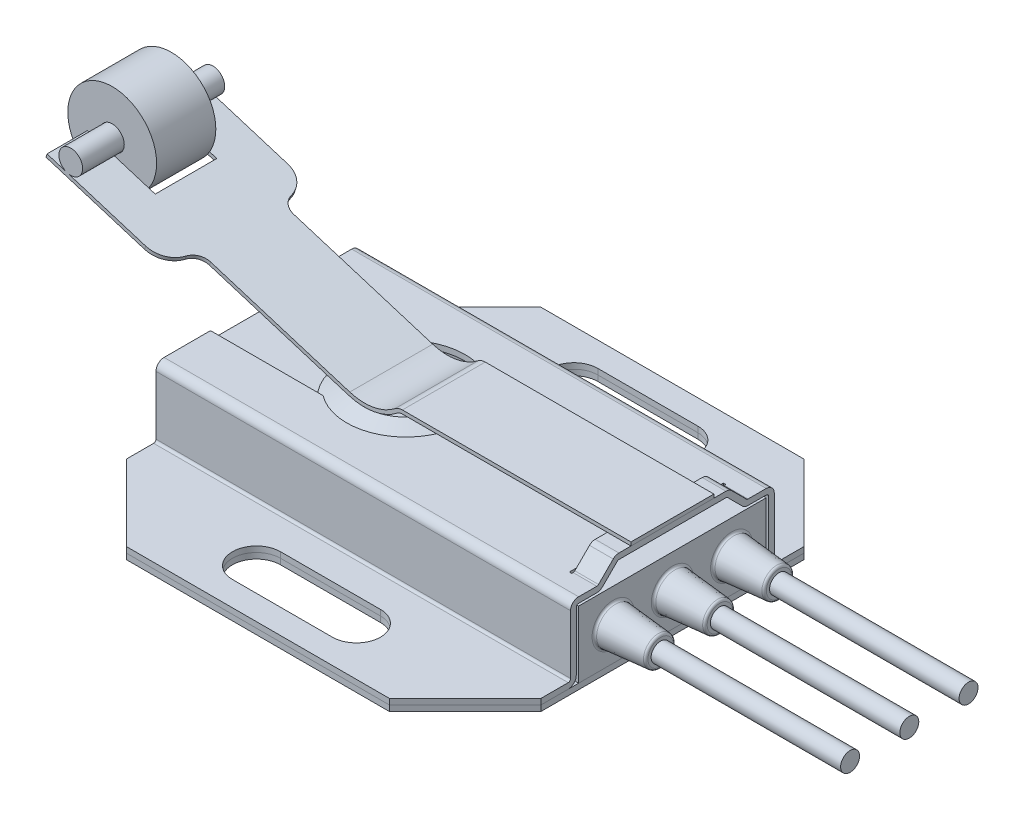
ISO-10303-21;
HEADER;
FILE_DESCRIPTION(('STEP AP214'),'2;1');
FILE_NAME('part.step','',(''),(''),'','','');
FILE_SCHEMA(('AUTOMOTIVE_DESIGN { 1 0 10303 214 1 1 1 1 }'));
ENDSEC;
DATA;
#1=APPLICATION_CONTEXT('core data for automotive mechanical design processes');
#2=APPLICATION_PROTOCOL_DEFINITION('international standard','automotive_design',2000,#1);
#3=PRODUCT_CONTEXT('',#1,'mechanical');
#4=PRODUCT('Part','Part','',(#3));
#5=PRODUCT_RELATED_PRODUCT_CATEGORY('part','',(#4));
#6=PRODUCT_DEFINITION_FORMATION('','',#4);
#7=PRODUCT_DEFINITION_CONTEXT('part definition',#1,'design');
#8=PRODUCT_DEFINITION('design','',#6,#7);
#9=PRODUCT_DEFINITION_SHAPE('','',#8);
#10=(LENGTH_UNIT() NAMED_UNIT(*) SI_UNIT(.MILLI.,.METRE.));
#11=(NAMED_UNIT(*) PLANE_ANGLE_UNIT() SI_UNIT($,.RADIAN.));
#12=(NAMED_UNIT(*) SI_UNIT($,.STERADIAN.) SOLID_ANGLE_UNIT());
#13=UNCERTAINTY_MEASURE_WITH_UNIT(LENGTH_MEASURE(1.E-05),#10,'distance_accuracy_value','');
#14=(GEOMETRIC_REPRESENTATION_CONTEXT(3) GLOBAL_UNCERTAINTY_ASSIGNED_CONTEXT((#13)) GLOBAL_UNIT_ASSIGNED_CONTEXT((#10,
#11,#12)) REPRESENTATION_CONTEXT('',''));
#15=CARTESIAN_POINT('',(0.,0.,0.));
#16=DIRECTION('',(0.,0.,1.));
#17=DIRECTION('',(1.,0.,0.));
#18=AXIS2_PLACEMENT_3D('',#15,#16,#17);
#19=CARTESIAN_POINT('',(22.225,0.6096,10.0584));
#20=DIRECTION('',(1.,0.,0.));
#21=DIRECTION('',(0.,0.,-1.));
#22=AXIS2_PLACEMENT_3D('',#19,#20,#21);
#23=PLANE('',#22);
#24=CARTESIAN_POINT('',(22.225,4.191,-6.35000000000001));
#25=DIRECTION('',(1.,0.,0.));
#26=DIRECTION('',(0.,0.,-1.));
#27=AXIS2_PLACEMENT_3D('',#24,#25,#26);
#28=CIRCLE('',#27,2.26474811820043);
#29=CARTESIAN_POINT('',(22.225,4.191,-8.61474811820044));
#30=VERTEX_POINT('',#29);
#31=EDGE_CURVE('E147',#30,#30,#28,.F.);
#32=ORIENTED_EDGE('',*,*,#31,.T.);
#33=EDGE_LOOP('',(#32));
#34=FACE_BOUND('',#33,.T.);
#35=CARTESIAN_POINT('',(22.225,4.191,0.));
#36=DIRECTION('',(1.,0.,0.));
#37=DIRECTION('',(0.,0.,-1.));
#38=AXIS2_PLACEMENT_3D('',#35,#36,#37);
#39=CIRCLE('',#38,2.26474811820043);
#40=CARTESIAN_POINT('',(22.225,4.191,-2.26474811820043));
#41=VERTEX_POINT('',#40);
#42=EDGE_CURVE('E144',#41,#41,#39,.F.);
#43=ORIENTED_EDGE('',*,*,#42,.T.);
#44=EDGE_LOOP('',(#43));
#45=FACE_BOUND('',#44,.T.);
#46=CARTESIAN_POINT('',(22.225,4.191,6.34999999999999));
#47=DIRECTION('',(1.,0.,0.));
#48=DIRECTION('',(0.,0.,-1.));
#49=AXIS2_PLACEMENT_3D('',#46,#47,#48);
#50=CIRCLE('',#49,2.26474811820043);
#51=CARTESIAN_POINT('',(22.225,4.191,4.08525188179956));
#52=VERTEX_POINT('',#51);
#53=EDGE_CURVE('E141',#52,#52,#50,.F.);
#54=ORIENTED_EDGE('',*,*,#53,.T.);
#55=EDGE_LOOP('',(#54));
#56=FACE_BOUND('',#55,.T.);
#57=DIRECTION('',(0.,1.,0.));
#58=VECTOR('',#57,1.);
#59=CARTESIAN_POINT('',(22.225,7.7724,10.0584));
#60=LINE('',#59,#58);
#61=CARTESIAN_POINT('',(22.225,0.6096,10.0584));
#62=VERTEX_POINT('',#61);
#63=CARTESIAN_POINT('',(22.225,7.7724,10.0584));
#64=VERTEX_POINT('',#63);
#65=EDGE_CURVE('E94',#62,#64,#60,.T.);
#66=ORIENTED_EDGE('',*,*,#65,.F.);
#67=DIRECTION('',(0.,0.,1.));
#68=VECTOR('',#67,1.);
#69=CARTESIAN_POINT('',(22.225,0.6096,10.0584));
#70=LINE('',#69,#68);
#71=CARTESIAN_POINT('',(22.225,0.609599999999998,-10.0584));
#72=VERTEX_POINT('',#71);
#73=EDGE_CURVE('E111',#72,#62,#70,.T.);
#74=ORIENTED_EDGE('',*,*,#73,.F.);
#75=DIRECTION('',(0.,-1.,0.));
#76=VECTOR('',#75,1.);
#77=CARTESIAN_POINT('',(22.225,7.7724,-10.0584));
#78=LINE('',#77,#76);
#79=CARTESIAN_POINT('',(22.225,7.7724,-10.0584));
#80=VERTEX_POINT('',#79);
#81=EDGE_CURVE('E96',#80,#72,#78,.T.);
#82=ORIENTED_EDGE('',*,*,#81,.F.);
#83=DIRECTION('',(0.,0.,-1.));
#84=VECTOR('',#83,1.);
#85=CARTESIAN_POINT('',(22.225,7.7724,10.0584));
#86=LINE('',#85,#84);
#87=EDGE_CURVE('E84',#64,#80,#86,.T.);
#88=ORIENTED_EDGE('',*,*,#87,.F.);
#89=EDGE_LOOP('',(#66,#74,#82,#88));
#90=FACE_BOUND('',#89,.T.);
#91=ADVANCED_FACE('F41',(#34,#45,#56,#90),#23,.T.);
#92=CARTESIAN_POINT('',(-6.35,9.144,0.));
#93=DIRECTION('',(0.,-1.,0.));
#94=DIRECTION('',(0.,0.,-1.));
#95=AXIS2_PLACEMENT_3D('',#92,#93,#94);
#96=CONICAL_SURFACE('',#95,4.445,1.03037682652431);
#97=CARTESIAN_POINT('',(-6.35,9.144,0.));
#98=DIRECTION('',(0.,-1.,0.));
#99=DIRECTION('',(0.,0.,-1.));
#100=AXIS2_PLACEMENT_3D('',#97,#98,#99);
#101=CIRCLE('',#100,4.445);
#102=CARTESIAN_POINT('',(-6.35,9.144,-4.445));
#103=VERTEX_POINT('',#102);
#104=EDGE_CURVE('E120',#103,#103,#101,.T.);
#105=ORIENTED_EDGE('',*,*,#104,.T.);
#106=EDGE_LOOP('',(#105));
#107=FACE_BOUND('',#106,.T.);
#108=CARTESIAN_POINT('',(-6.35,7.7724,0.));
#109=DIRECTION('',(0.,-1.,0.));
#110=DIRECTION('',(0.,0.,-1.));
#111=AXIS2_PLACEMENT_3D('',#108,#109,#110);
#112=CIRCLE('',#111,6.731);
#113=CARTESIAN_POINT('',(-6.35,7.7724,-6.731));
#114=VERTEX_POINT('',#113);
#115=EDGE_CURVE('E123',#114,#114,#112,.T.);
#116=ORIENTED_EDGE('',*,*,#115,.F.);
#117=EDGE_LOOP('',(#116));
#118=FACE_BOUND('',#117,.T.);
#119=ADVANCED_FACE('F184',(#107,#118),#96,.T.);
#120=CARTESIAN_POINT('',(-6.35,9.144,0.));
#121=DIRECTION('',(0.,-1.,0.));
#122=DIRECTION('',(0.,0.,-1.));
#123=AXIS2_PLACEMENT_3D('',#120,#121,#122);
#124=PLANE('',#123);
#125=ORIENTED_EDGE('',*,*,#104,.F.);
#126=EDGE_LOOP('',(#125));
#127=FACE_BOUND('',#126,.T.);
#128=ADVANCED_FACE('F190',(#127),#124,.F.);
#129=CARTESIAN_POINT('',(-43.5789538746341,7.7724,10.0584));
#130=DIRECTION('',(0.,-1.,0.));
#131=DIRECTION('',(0.,0.,-1.));
#132=AXIS2_PLACEMENT_3D('',#129,#130,#131);
#133=PLANE('',#132);
#134=DIRECTION('',(1.,0.,0.));
#135=VECTOR('',#134,1.);
#136=CARTESIAN_POINT('',(-43.5789538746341,7.7724,-10.0584));
#137=LINE('',#136,#135);
#138=CARTESIAN_POINT('',(-22.225,7.7724,-10.0584));
#139=VERTEX_POINT('',#138);
#140=EDGE_CURVE('E89',#139,#80,#137,.T.);
#141=ORIENTED_EDGE('',*,*,#140,.F.);
#142=DIRECTION('',(0.,0.,1.));
#143=VECTOR('',#142,1.);
#144=CARTESIAN_POINT('',(-22.225,7.7724,10.0584));
#145=LINE('',#144,#143);
#146=CARTESIAN_POINT('',(-22.225,7.7724,10.0584));
#147=VERTEX_POINT('',#146);
#148=EDGE_CURVE('E56',#139,#147,#145,.T.);
#149=ORIENTED_EDGE('',*,*,#148,.T.);
#150=DIRECTION('',(1.,0.,0.));
#151=VECTOR('',#150,1.);
#152=CARTESIAN_POINT('',(-43.5789538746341,7.7724,10.0584));
#153=LINE('',#152,#151);
#154=EDGE_CURVE('E80',#147,#64,#153,.T.);
#155=ORIENTED_EDGE('',*,*,#154,.T.);
#156=ORIENTED_EDGE('',*,*,#87,.T.);
#157=EDGE_LOOP('',(#141,#149,#155,#156));
#158=FACE_BOUND('',#157,.T.);
#159=ORIENTED_EDGE('',*,*,#115,.T.);
#160=EDGE_LOOP('',(#159));
#161=FACE_BOUND('',#160,.T.);
#162=ADVANCED_FACE('F82',(#158,#161),#133,.F.);
#163=CARTESIAN_POINT('',(-43.5789538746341,0.6096,10.0584));
#164=DIRECTION('',(0.,1.,0.));
#165=DIRECTION('',(0.,0.,1.));
#166=AXIS2_PLACEMENT_3D('',#163,#164,#165);
#167=PLANE('',#166);
#168=DIRECTION('',(1.,0.,0.));
#169=VECTOR('',#168,1.);
#170=CARTESIAN_POINT('',(-43.5789538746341,0.6096,10.0584));
#171=LINE('',#170,#169);
#172=CARTESIAN_POINT('',(-22.225,0.6096,10.0584));
#173=VERTEX_POINT('',#172);
#174=EDGE_CURVE('E100',#173,#62,#171,.T.);
#175=ORIENTED_EDGE('',*,*,#174,.F.);
#176=DIRECTION('',(0.,0.,-1.));
#177=VECTOR('',#176,1.);
#178=CARTESIAN_POINT('',(-22.225,0.6096,10.0584));
#179=LINE('',#178,#177);
#180=CARTESIAN_POINT('',(-22.225,0.609599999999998,-10.0584));
#181=VERTEX_POINT('',#180);
#182=EDGE_CURVE('E88',#173,#181,#179,.T.);
#183=ORIENTED_EDGE('',*,*,#182,.T.);
#184=DIRECTION('',(1.,0.,0.));
#185=VECTOR('',#184,1.);
#186=CARTESIAN_POINT('',(-43.5789538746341,0.609599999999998,-10.0584));
#187=LINE('',#186,#185);
#188=EDGE_CURVE('E114',#181,#72,#187,.T.);
#189=ORIENTED_EDGE('',*,*,#188,.T.);
#190=ORIENTED_EDGE('',*,*,#73,.T.);
#191=EDGE_LOOP('',(#175,#183,#189,#190));
#192=FACE_BOUND('',#191,.T.);
#193=ADVANCED_FACE('F198',(#192),#167,.F.);
#194=CARTESIAN_POINT('',(-43.5789538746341,7.7724,-10.0584));
#195=DIRECTION('',(0.,0.,1.));
#196=DIRECTION('',(0.,-1.,0.));
#197=AXIS2_PLACEMENT_3D('',#194,#195,#196);
#198=PLANE('',#197);
#199=ORIENTED_EDGE('',*,*,#188,.F.);
#200=DIRECTION('',(0.,1.,0.));
#201=VECTOR('',#200,1.);
#202=CARTESIAN_POINT('',(-22.225,7.7724,-10.0584));
#203=LINE('',#202,#201);
#204=EDGE_CURVE('E119',#181,#139,#203,.T.);
#205=ORIENTED_EDGE('',*,*,#204,.T.);
#206=ORIENTED_EDGE('',*,*,#140,.T.);
#207=ORIENTED_EDGE('',*,*,#81,.T.);
#208=EDGE_LOOP('',(#199,#205,#206,#207));
#209=FACE_BOUND('',#208,.T.);
#210=ADVANCED_FACE('F201',(#209),#198,.F.);
#211=CARTESIAN_POINT('',(-43.5789538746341,7.7724,10.0584));
#212=DIRECTION('',(0.,0.,-1.));
#213=DIRECTION('',(0.,1.,0.));
#214=AXIS2_PLACEMENT_3D('',#211,#212,#213);
#215=PLANE('',#214);
#216=ORIENTED_EDGE('',*,*,#154,.F.);
#217=DIRECTION('',(0.,-1.,0.));
#218=VECTOR('',#217,1.);
#219=CARTESIAN_POINT('',(-22.225,7.7724,10.0584));
#220=LINE('',#219,#218);
#221=EDGE_CURVE('E62',#147,#173,#220,.T.);
#222=ORIENTED_EDGE('',*,*,#221,.T.);
#223=ORIENTED_EDGE('',*,*,#174,.T.);
#224=ORIENTED_EDGE('',*,*,#65,.T.);
#225=EDGE_LOOP('',(#216,#222,#223,#224));
#226=FACE_BOUND('',#225,.T.);
#227=ADVANCED_FACE('F98',(#226),#215,.F.);
#228=CARTESIAN_POINT('',(-22.225,0.6096,-22.225));
#229=DIRECTION('',(1.,0.,0.));
#230=DIRECTION('',(0.,0.,-1.));
#231=AXIS2_PLACEMENT_3D('',#228,#229,#230);
#232=PLANE('',#231);
#233=ORIENTED_EDGE('',*,*,#148,.F.);
#234=ORIENTED_EDGE('',*,*,#204,.F.);
#235=ORIENTED_EDGE('',*,*,#182,.F.);
#236=ORIENTED_EDGE('',*,*,#221,.F.);
#237=EDGE_LOOP('',(#233,#234,#235,#236));
#238=FACE_BOUND('',#237,.T.);
#239=ADVANCED_FACE('F196',(#238),#232,.F.);
#240=CARTESIAN_POINT('',(22.225,4.191,6.34999999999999));
#241=DIRECTION('',(-1.,0.,0.));
#242=DIRECTION('',(0.,0.,-1.));
#243=AXIS2_PLACEMENT_3D('',#240,#241,#242);
#244=CONICAL_SURFACE('',#243,2.032,0.0872664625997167);
#245=CARTESIAN_POINT('',(22.4568624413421,4.191,6.34999999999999));
#246=DIRECTION('',(1.,0.,0.));
#247=DIRECTION('',(0.,0.,-1.));
#248=AXIS2_PLACEMENT_3D('',#245,#246,#247);
#249=CIRCLE('',#248,2.01171466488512);
#250=CARTESIAN_POINT('',(22.4568624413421,4.191,4.33828533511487));
#251=VERTEX_POINT('',#250);
#252=EDGE_CURVE('E49',#251,#251,#249,.T.);
#253=ORIENTED_EDGE('',*,*,#252,.T.);
#254=EDGE_LOOP('',(#253));
#255=FACE_BOUND('',#254,.T.);
#256=CARTESIAN_POINT('',(27.0731375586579,4.191,6.34999999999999));
#257=DIRECTION('',(-1.,0.,0.));
#258=DIRECTION('',(0.,0.,1.));
#259=AXIS2_PLACEMENT_3D('',#256,#257,#258);
#260=CIRCLE('',#259,1.60784292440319);
#261=CARTESIAN_POINT('',(27.0731375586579,4.191,7.95784292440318));
#262=VERTEX_POINT('',#261);
#263=EDGE_CURVE('E162',#262,#262,#260,.T.);
#264=ORIENTED_EDGE('',*,*,#263,.T.);
#265=EDGE_LOOP('',(#264));
#266=FACE_BOUND('',#265,.T.);
#267=ADVANCED_FACE('F167',(#255,#266),#244,.T.);
#268=CARTESIAN_POINT('',(27.305,4.191,6.34999999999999));
#269=DIRECTION('',(1.,0.,0.));
#270=DIRECTION('',(0.,0.,-1.));
#271=AXIS2_PLACEMENT_3D('',#268,#269,#270);
#272=PLANE('',#271);
#273=CARTESIAN_POINT('',(27.305,4.191,6.34999999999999));
#274=DIRECTION('',(1.,0.,0.));
#275=DIRECTION('',(0.,0.,-1.));
#276=AXIS2_PLACEMENT_3D('',#273,#274,#275);
#277=CIRCLE('',#276,1.35480947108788);
#278=CARTESIAN_POINT('',(27.305,4.191,4.99519052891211));
#279=VERTEX_POINT('',#278);
#280=EDGE_CURVE('E12',#279,#279,#277,.T.);
#281=ORIENTED_EDGE('',*,*,#280,.T.);
#282=EDGE_LOOP('',(#281));
#283=FACE_BOUND('',#282,.T.);
#284=CARTESIAN_POINT('',(27.305,4.191,6.34999999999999));
#285=DIRECTION('',(1.,0.,0.));
#286=DIRECTION('',(0.,0.,-1.));
#287=AXIS2_PLACEMENT_3D('',#284,#285,#286);
#288=CIRCLE('',#287,1.016);
#289=CARTESIAN_POINT('',(27.305,4.191,5.33399999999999));
#290=VERTEX_POINT('',#289);
#291=EDGE_CURVE('E126',#290,#290,#288,.F.);
#292=ORIENTED_EDGE('',*,*,#291,.T.);
#293=EDGE_LOOP('',(#292));
#294=FACE_BOUND('',#293,.T.);
#295=ADVANCED_FACE('F265',(#283,#294),#272,.T.);
#296=CARTESIAN_POINT('',(47.625,4.191,6.34999999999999));
#297=DIRECTION('',(-1.,0.,0.));
#298=DIRECTION('',(0.,0.,1.));
#299=AXIS2_PLACEMENT_3D('',#296,#297,#298);
#300=PLANE('',#299);
#301=CARTESIAN_POINT('',(47.625,4.191,6.34999999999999));
#302=DIRECTION('',(-1.,0.,0.));
#303=DIRECTION('',(0.,0.,1.));
#304=AXIS2_PLACEMENT_3D('',#301,#302,#303);
#305=CIRCLE('',#304,1.016);
#306=CARTESIAN_POINT('',(47.625,4.191,7.36599999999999));
#307=VERTEX_POINT('',#306);
#308=EDGE_CURVE('E254',#307,#307,#305,.T.);
#309=ORIENTED_EDGE('',*,*,#308,.F.);
#310=EDGE_LOOP('',(#309));
#311=FACE_BOUND('',#310,.T.);
#312=ADVANCED_FACE('F270',(#311),#300,.F.);
#313=CARTESIAN_POINT('',(47.625,4.191,6.34999999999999));
#314=DIRECTION('',(-1.,0.,0.));
#315=DIRECTION('',(0.,0.,1.));
#316=AXIS2_PLACEMENT_3D('',#313,#314,#315);
#317=CYLINDRICAL_SURFACE('',#316,1.016);
#318=ORIENTED_EDGE('',*,*,#291,.F.);
#319=EDGE_LOOP('',(#318));
#320=FACE_BOUND('',#319,.T.);
#321=ORIENTED_EDGE('',*,*,#308,.T.);
#322=EDGE_LOOP('',(#321));
#323=FACE_BOUND('',#322,.T.);
#324=ADVANCED_FACE('F234',(#320,#323),#317,.T.);
#325=CARTESIAN_POINT('',(22.225,4.191,0.));
#326=DIRECTION('',(-1.,0.,0.));
#327=DIRECTION('',(0.,0.,-1.));
#328=AXIS2_PLACEMENT_3D('',#325,#326,#327);
#329=CONICAL_SURFACE('',#328,2.032,0.0872664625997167);
#330=CARTESIAN_POINT('',(22.4568624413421,4.191,0.));
#331=DIRECTION('',(1.,0.,0.));
#332=DIRECTION('',(0.,0.,-1.));
#333=AXIS2_PLACEMENT_3D('',#330,#331,#332);
#334=CIRCLE('',#333,2.01171466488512);
#335=CARTESIAN_POINT('',(22.4568624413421,4.191,-2.01171466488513));
#336=VERTEX_POINT('',#335);
#337=EDGE_CURVE('E156',#336,#336,#334,.T.);
#338=ORIENTED_EDGE('',*,*,#337,.T.);
#339=EDGE_LOOP('',(#338));
#340=FACE_BOUND('',#339,.T.);
#341=CARTESIAN_POINT('',(27.0731375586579,4.191,0.));
#342=DIRECTION('',(-1.,0.,0.));
#343=DIRECTION('',(0.,0.,1.));
#344=AXIS2_PLACEMENT_3D('',#341,#342,#343);
#345=CIRCLE('',#344,1.60784292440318);
#346=CARTESIAN_POINT('',(27.0731375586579,4.191,1.60784292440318));
#347=VERTEX_POINT('',#346);
#348=EDGE_CURVE('E153',#347,#347,#345,.T.);
#349=ORIENTED_EDGE('',*,*,#348,.T.);
#350=EDGE_LOOP('',(#349));
#351=FACE_BOUND('',#350,.T.);
#352=ADVANCED_FACE('F230',(#340,#351),#329,.T.);
#353=CARTESIAN_POINT('',(27.305,4.191,0.));
#354=DIRECTION('',(1.,0.,0.));
#355=DIRECTION('',(0.,0.,-1.));
#356=AXIS2_PLACEMENT_3D('',#353,#354,#355);
#357=PLANE('',#356);
#358=CARTESIAN_POINT('',(27.305,4.191,0.));
#359=DIRECTION('',(1.,0.,0.));
#360=DIRECTION('',(0.,0.,-1.));
#361=AXIS2_PLACEMENT_3D('',#358,#359,#360);
#362=CIRCLE('',#361,1.35480947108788);
#363=CARTESIAN_POINT('',(27.305,4.191,-1.35480947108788));
#364=VERTEX_POINT('',#363);
#365=EDGE_CURVE('E159',#364,#364,#362,.T.);
#366=ORIENTED_EDGE('',*,*,#365,.T.);
#367=EDGE_LOOP('',(#366));
#368=FACE_BOUND('',#367,.T.);
#369=CARTESIAN_POINT('',(27.305,4.191,0.));
#370=DIRECTION('',(1.,0.,0.));
#371=DIRECTION('',(0.,0.,-1.));
#372=AXIS2_PLACEMENT_3D('',#369,#370,#371);
#373=CIRCLE('',#372,1.016);
#374=CARTESIAN_POINT('',(27.305,4.191,-1.016));
#375=VERTEX_POINT('',#374);
#376=EDGE_CURVE('E129',#375,#375,#373,.F.);
#377=ORIENTED_EDGE('',*,*,#376,.T.);
#378=EDGE_LOOP('',(#377));
#379=FACE_BOUND('',#378,.T.);
#380=ADVANCED_FACE('F233',(#368,#379),#357,.T.);
#381=CARTESIAN_POINT('',(47.625,4.191,0.));
#382=DIRECTION('',(-1.,0.,0.));
#383=DIRECTION('',(0.,0.,1.));
#384=AXIS2_PLACEMENT_3D('',#381,#382,#383);
#385=PLANE('',#384);
#386=CARTESIAN_POINT('',(47.625,4.191,0.));
#387=DIRECTION('',(-1.,0.,0.));
#388=DIRECTION('',(0.,0.,1.));
#389=AXIS2_PLACEMENT_3D('',#386,#387,#388);
#390=CIRCLE('',#389,1.016);
#391=CARTESIAN_POINT('',(47.625,4.191,1.016));
#392=VERTEX_POINT('',#391);
#393=EDGE_CURVE('E105',#392,#392,#390,.T.);
#394=ORIENTED_EDGE('',*,*,#393,.F.);
#395=EDGE_LOOP('',(#394));
#396=FACE_BOUND('',#395,.T.);
#397=ADVANCED_FACE('F242',(#396),#385,.F.);
#398=CARTESIAN_POINT('',(47.625,4.191,0.));
#399=DIRECTION('',(-1.,0.,0.));
#400=DIRECTION('',(0.,0.,1.));
#401=AXIS2_PLACEMENT_3D('',#398,#399,#400);
#402=CYLINDRICAL_SURFACE('',#401,1.016);
#403=ORIENTED_EDGE('',*,*,#376,.F.);
#404=EDGE_LOOP('',(#403));
#405=FACE_BOUND('',#404,.T.);
#406=ORIENTED_EDGE('',*,*,#393,.T.);
#407=EDGE_LOOP('',(#406));
#408=FACE_BOUND('',#407,.T.);
#409=ADVANCED_FACE('F246',(#405,#408),#402,.T.);
#410=CARTESIAN_POINT('',(22.225,4.191,-6.35000000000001));
#411=DIRECTION('',(-1.,0.,0.));
#412=DIRECTION('',(0.,0.,-1.));
#413=AXIS2_PLACEMENT_3D('',#410,#411,#412);
#414=CONICAL_SURFACE('',#413,2.032,0.0872664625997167);
#415=CARTESIAN_POINT('',(22.4568624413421,4.191,-6.35000000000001));
#416=DIRECTION('',(1.,0.,0.));
#417=DIRECTION('',(0.,0.,-1.));
#418=AXIS2_PLACEMENT_3D('',#415,#416,#417);
#419=CIRCLE('',#418,2.01171466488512);
#420=CARTESIAN_POINT('',(22.4568624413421,4.191,-8.36171466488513));
#421=VERTEX_POINT('',#420);
#422=EDGE_CURVE('E138',#421,#421,#419,.T.);
#423=ORIENTED_EDGE('',*,*,#422,.T.);
#424=EDGE_LOOP('',(#423));
#425=FACE_BOUND('',#424,.T.);
#426=CARTESIAN_POINT('',(27.0731375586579,4.191,-6.35000000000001));
#427=DIRECTION('',(-1.,0.,0.));
#428=DIRECTION('',(0.,0.,1.));
#429=AXIS2_PLACEMENT_3D('',#426,#427,#428);
#430=CIRCLE('',#429,1.60784292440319);
#431=CARTESIAN_POINT('',(27.0731375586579,4.191,-4.74215707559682));
#432=VERTEX_POINT('',#431);
#433=EDGE_CURVE('E135',#432,#432,#430,.T.);
#434=ORIENTED_EDGE('',*,*,#433,.T.);
#435=EDGE_LOOP('',(#434));
#436=FACE_BOUND('',#435,.T.);
#437=ADVANCED_FACE('F249',(#425,#436),#414,.T.);
#438=CARTESIAN_POINT('',(27.305,4.191,-6.35000000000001));
#439=DIRECTION('',(1.,0.,0.));
#440=DIRECTION('',(0.,0.,-1.));
#441=AXIS2_PLACEMENT_3D('',#438,#439,#440);
#442=PLANE('',#441);
#443=CARTESIAN_POINT('',(27.305,4.191,-6.35000000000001));
#444=DIRECTION('',(1.,0.,0.));
#445=DIRECTION('',(0.,0.,-1.));
#446=AXIS2_PLACEMENT_3D('',#443,#444,#445);
#447=CIRCLE('',#446,1.35480947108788);
#448=CARTESIAN_POINT('',(27.305,4.191,-7.70480947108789));
#449=VERTEX_POINT('',#448);
#450=EDGE_CURVE('E150',#449,#449,#447,.T.);
#451=ORIENTED_EDGE('',*,*,#450,.T.);
#452=EDGE_LOOP('',(#451));
#453=FACE_BOUND('',#452,.T.);
#454=CARTESIAN_POINT('',(27.305,4.191,-6.35000000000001));
#455=DIRECTION('',(1.,0.,0.));
#456=DIRECTION('',(0.,0.,-1.));
#457=AXIS2_PLACEMENT_3D('',#454,#455,#456);
#458=CIRCLE('',#457,1.016);
#459=CARTESIAN_POINT('',(27.305,4.191,-7.36600000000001));
#460=VERTEX_POINT('',#459);
#461=EDGE_CURVE('E132',#460,#460,#458,.F.);
#462=ORIENTED_EDGE('',*,*,#461,.T.);
#463=EDGE_LOOP('',(#462));
#464=FACE_BOUND('',#463,.T.);
#465=ADVANCED_FACE('F284',(#453,#464),#442,.T.);
#466=CARTESIAN_POINT('',(47.625,4.191,-6.35000000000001));
#467=DIRECTION('',(-1.,0.,0.));
#468=DIRECTION('',(0.,0.,1.));
#469=AXIS2_PLACEMENT_3D('',#466,#467,#468);
#470=PLANE('',#469);
#471=CARTESIAN_POINT('',(47.625,4.191,-6.35000000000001));
#472=DIRECTION('',(-1.,0.,0.));
#473=DIRECTION('',(0.,0.,1.));
#474=AXIS2_PLACEMENT_3D('',#471,#472,#473);
#475=CIRCLE('',#474,1.016);
#476=CARTESIAN_POINT('',(47.625,4.191,-5.33400000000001));
#477=VERTEX_POINT('',#476);
#478=EDGE_CURVE('E102',#477,#477,#475,.T.);
#479=ORIENTED_EDGE('',*,*,#478,.F.);
#480=EDGE_LOOP('',(#479));
#481=FACE_BOUND('',#480,.T.);
#482=ADVANCED_FACE('F282',(#481),#470,.F.);
#483=CARTESIAN_POINT('',(47.625,4.191,-6.35000000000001));
#484=DIRECTION('',(-1.,0.,0.));
#485=DIRECTION('',(0.,0.,1.));
#486=AXIS2_PLACEMENT_3D('',#483,#484,#485);
#487=CYLINDRICAL_SURFACE('',#486,1.016);
#488=ORIENTED_EDGE('',*,*,#461,.F.);
#489=EDGE_LOOP('',(#488));
#490=FACE_BOUND('',#489,.T.);
#491=ORIENTED_EDGE('',*,*,#478,.T.);
#492=EDGE_LOOP('',(#491));
#493=FACE_BOUND('',#492,.T.);
#494=ADVANCED_FACE('F217',(#490,#493),#487,.T.);
#495=CARTESIAN_POINT('',(22.479,4.191,-6.35000000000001));
#496=DIRECTION('',(1.,0.,0.));
#497=DIRECTION('',(0.,0.,-1.));
#498=AXIS2_PLACEMENT_3D('',#495,#496,#497);
#499=TOROIDAL_SURFACE('',#498,2.26474811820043,0.254);
#500=ORIENTED_EDGE('',*,*,#31,.F.);
#501=EDGE_LOOP('',(#500));
#502=FACE_BOUND('',#501,.T.);
#503=ORIENTED_EDGE('',*,*,#422,.F.);
#504=EDGE_LOOP('',(#503));
#505=FACE_BOUND('',#504,.T.);
#506=ADVANCED_FACE('F213',(#502,#505),#499,.F.);
#507=CARTESIAN_POINT('',(27.051,4.191,-6.35000000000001));
#508=DIRECTION('',(1.,0.,0.));
#509=DIRECTION('',(0.,0.,-1.));
#510=AXIS2_PLACEMENT_3D('',#507,#508,#509);
#511=TOROIDAL_SURFACE('',#510,1.35480947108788,0.254);
#512=ORIENTED_EDGE('',*,*,#433,.F.);
#513=EDGE_LOOP('',(#512));
#514=FACE_BOUND('',#513,.T.);
#515=ORIENTED_EDGE('',*,*,#450,.F.);
#516=EDGE_LOOP('',(#515));
#517=FACE_BOUND('',#516,.T.);
#518=ADVANCED_FACE('F216',(#514,#517),#511,.T.);
#519=CARTESIAN_POINT('',(22.479,4.191,0.));
#520=DIRECTION('',(1.,0.,0.));
#521=DIRECTION('',(0.,0.,-1.));
#522=AXIS2_PLACEMENT_3D('',#519,#520,#521);
#523=TOROIDAL_SURFACE('',#522,2.26474811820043,0.254);
#524=ORIENTED_EDGE('',*,*,#42,.F.);
#525=EDGE_LOOP('',(#524));
#526=FACE_BOUND('',#525,.T.);
#527=ORIENTED_EDGE('',*,*,#337,.F.);
#528=EDGE_LOOP('',(#527));
#529=FACE_BOUND('',#528,.T.);
#530=ADVANCED_FACE('F179',(#526,#529),#523,.F.);
#531=CARTESIAN_POINT('',(27.051,4.191,0.));
#532=DIRECTION('',(1.,0.,0.));
#533=DIRECTION('',(0.,0.,-1.));
#534=AXIS2_PLACEMENT_3D('',#531,#532,#533);
#535=TOROIDAL_SURFACE('',#534,1.35480947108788,0.254);
#536=ORIENTED_EDGE('',*,*,#348,.F.);
#537=EDGE_LOOP('',(#536));
#538=FACE_BOUND('',#537,.T.);
#539=ORIENTED_EDGE('',*,*,#365,.F.);
#540=EDGE_LOOP('',(#539));
#541=FACE_BOUND('',#540,.T.);
#542=ADVANCED_FACE('F172',(#538,#541),#535,.T.);
#543=CARTESIAN_POINT('',(22.479,4.191,6.34999999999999));
#544=DIRECTION('',(1.,0.,0.));
#545=DIRECTION('',(0.,0.,-1.));
#546=AXIS2_PLACEMENT_3D('',#543,#544,#545);
#547=TOROIDAL_SURFACE('',#546,2.26474811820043,0.254);
#548=ORIENTED_EDGE('',*,*,#53,.F.);
#549=EDGE_LOOP('',(#548));
#550=FACE_BOUND('',#549,.T.);
#551=ORIENTED_EDGE('',*,*,#252,.F.);
#552=EDGE_LOOP('',(#551));
#553=FACE_BOUND('',#552,.T.);
#554=ADVANCED_FACE('F170',(#550,#553),#547,.F.);
#555=CARTESIAN_POINT('',(27.051,4.191,6.34999999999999));
#556=DIRECTION('',(1.,0.,0.));
#557=DIRECTION('',(0.,0.,-1.));
#558=AXIS2_PLACEMENT_3D('',#555,#556,#557);
#559=TOROIDAL_SURFACE('',#558,1.35480947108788,0.254);
#560=ORIENTED_EDGE('',*,*,#263,.F.);
#561=EDGE_LOOP('',(#560));
#562=FACE_BOUND('',#561,.T.);
#563=ORIENTED_EDGE('',*,*,#280,.F.);
#564=EDGE_LOOP('',(#563));
#565=FACE_BOUND('',#564,.T.);
#566=ADVANCED_FACE('F43',(#562,#565),#559,.T.);
#567=CLOSED_SHELL('',(#91,#119,#128,#162,#193,#210,#227,#239,#267,#295,#312,#324,#352,#380,#397,
#409,#437,#465,#482,#494,#506,#518,#530,#542,#554,#566));
#568=MANIFOLD_SOLID_BREP('B2',#567);
#569=CARTESIAN_POINT('',(-34.671,19.3675,3.175));
#570=DIRECTION('',(0.,0.,1.));
#571=DIRECTION('',(1.,0.,0.));
#572=AXIS2_PLACEMENT_3D('',#569,#570,#571);
#573=PLANE('',#572);
#574=CARTESIAN_POINT('',(-34.671,19.3675,3.175));
#575=DIRECTION('',(0.,0.,1.));
#576=DIRECTION('',(1.,0.,0.));
#577=AXIS2_PLACEMENT_3D('',#574,#575,#576);
#578=CIRCLE('',#577,4.7625);
#579=CARTESIAN_POINT('',(-29.9085,19.3675,3.175));
#580=VERTEX_POINT('',#579);
#581=EDGE_CURVE('E40',#580,#580,#578,.T.);
#582=ORIENTED_EDGE('',*,*,#581,.T.);
#583=EDGE_LOOP('',(#582));
#584=FACE_BOUND('',#583,.T.);
#585=CARTESIAN_POINT('',(-34.671,19.3675,3.175));
#586=DIRECTION('',(0.,0.,1.));
#587=DIRECTION('',(1.,0.,0.));
#588=AXIS2_PLACEMENT_3D('',#585,#586,#587);
#589=CIRCLE('',#588,1.2954);
#590=CARTESIAN_POINT('',(-33.3756,19.3675,3.175));
#591=VERTEX_POINT('',#590);
#592=EDGE_CURVE('E485',#591,#591,#589,.T.);
#593=ORIENTED_EDGE('',*,*,#592,.F.);
#594=EDGE_LOOP('',(#593));
#595=FACE_BOUND('',#594,.T.);
#596=ADVANCED_FACE('F474',(#584,#595),#573,.T.);
#597=CARTESIAN_POINT('',(-34.671,19.3675,-3.175));
#598=DIRECTION('',(0.,0.,1.));
#599=DIRECTION('',(1.,0.,0.));
#600=AXIS2_PLACEMENT_3D('',#597,#598,#599);
#601=PLANE('',#600);
#602=CARTESIAN_POINT('',(-34.671,19.3675,-3.175));
#603=DIRECTION('',(0.,0.,1.));
#604=DIRECTION('',(1.,0.,0.));
#605=AXIS2_PLACEMENT_3D('',#602,#603,#604);
#606=CIRCLE('',#605,4.7625);
#607=CARTESIAN_POINT('',(-29.9085,19.3675,-3.175));
#608=VERTEX_POINT('',#607);
#609=EDGE_CURVE('E478',#608,#608,#606,.T.);
#610=ORIENTED_EDGE('',*,*,#609,.F.);
#611=EDGE_LOOP('',(#610));
#612=FACE_BOUND('',#611,.T.);
#613=CARTESIAN_POINT('',(-34.671,19.3675,-3.175));
#614=DIRECTION('',(0.,0.,1.));
#615=DIRECTION('',(1.,0.,0.));
#616=AXIS2_PLACEMENT_3D('',#613,#614,#615);
#617=CIRCLE('',#616,1.2954);
#618=CARTESIAN_POINT('',(-33.3756,19.3675,-3.175));
#619=VERTEX_POINT('',#618);
#620=EDGE_CURVE('E487',#619,#619,#617,.T.);
#621=ORIENTED_EDGE('',*,*,#620,.T.);
#622=EDGE_LOOP('',(#621));
#623=FACE_BOUND('',#622,.T.);
#624=ADVANCED_FACE('F497',(#612,#623),#601,.F.);
#625=CARTESIAN_POINT('',(-34.671,19.3675,3.175));
#626=DIRECTION('',(0.,0.,-1.));
#627=DIRECTION('',(-1.,0.,0.));
#628=AXIS2_PLACEMENT_3D('',#625,#626,#627);
#629=CYLINDRICAL_SURFACE('',#628,4.7625);
#630=ORIENTED_EDGE('',*,*,#581,.F.);
#631=EDGE_LOOP('',(#630));
#632=FACE_BOUND('',#631,.T.);
#633=ORIENTED_EDGE('',*,*,#609,.T.);
#634=EDGE_LOOP('',(#633));
#635=FACE_BOUND('',#634,.T.);
#636=ADVANCED_FACE('F476',(#632,#635),#629,.T.);
#637=CARTESIAN_POINT('',(-34.671,19.3675,3.175));
#638=DIRECTION('',(0.,0.,-1.));
#639=DIRECTION('',(-1.,0.,0.));
#640=AXIS2_PLACEMENT_3D('',#637,#638,#639);
#641=CYLINDRICAL_SURFACE('',#640,1.2954);
#642=ORIENTED_EDGE('',*,*,#592,.T.);
#643=EDGE_LOOP('',(#642));
#644=FACE_BOUND('',#643,.T.);
#645=ORIENTED_EDGE('',*,*,#620,.F.);
#646=EDGE_LOOP('',(#645));
#647=FACE_BOUND('',#646,.T.);
#648=ADVANCED_FACE('F493',(#644,#647),#641,.F.);
#649=CLOSED_SHELL('',(#596,#624,#636,#648));
#650=MANIFOLD_SOLID_BREP('B6',#649);
#651=CARTESIAN_POINT('',(-37.211,18.8239821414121,7.62));
#652=DIRECTION('',(-0.295577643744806,-0.955318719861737,0.));
#653=DIRECTION('',(0.955318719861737,-0.295577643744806,0.));
#654=AXIS2_PLACEMENT_3D('',#651,#652,#653);
#655=PLANE('',#654);
#656=DIRECTION('',(0.,0.,-1.));
#657=VECTOR('',#656,1.);
#658=CARTESIAN_POINT('',(-35.2752438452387,18.225055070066,7.62));
#659=LINE('',#658,#657);
#660=CARTESIAN_POINT('',(-35.2752438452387,18.225055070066,-3.302));
#661=VERTEX_POINT('',#660);
#662=CARTESIAN_POINT('',(-35.2752438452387,18.225055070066,-7.62));
#663=VERTEX_POINT('',#662);
#664=EDGE_CURVE('E752',#661,#663,#659,.T.);
#665=ORIENTED_EDGE('',*,*,#664,.T.);
#666=DIRECTION('',(-0.955318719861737,0.295577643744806,0.));
#667=VECTOR('',#666,1.);
#668=CARTESIAN_POINT('',(-37.211,18.8239821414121,-7.62));
#669=LINE('',#668,#667);
#670=CARTESIAN_POINT('',(-37.211,18.8239821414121,-7.62));
#671=VERTEX_POINT('',#670);
#672=EDGE_CURVE('E836',#663,#671,#669,.T.);
#673=ORIENTED_EDGE('',*,*,#672,.T.);
#674=DIRECTION('',(0.,0.,-1.));
#675=VECTOR('',#674,1.);
#676=CARTESIAN_POINT('',(-37.211,18.8239821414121,7.62));
#677=LINE('',#676,#675);
#678=CARTESIAN_POINT('',(-37.211,18.8239821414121,-3.302));
#679=VERTEX_POINT('',#678);
#680=EDGE_CURVE('E867',#679,#671,#677,.T.);
#681=ORIENTED_EDGE('',*,*,#680,.F.);
#682=DIRECTION('',(0.955318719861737,-0.295577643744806,0.));
#683=VECTOR('',#682,1.);
#684=CARTESIAN_POINT('',(-37.211,18.8239821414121,-3.302));
#685=LINE('',#684,#683);
#686=EDGE_CURVE('E833',#679,#661,#685,.T.);
#687=ORIENTED_EDGE('',*,*,#686,.T.);
#688=EDGE_LOOP('',(#665,#673,#681,#687));
#689=FACE_BOUND('',#688,.T.);
#690=ADVANCED_FACE('F545',(#689),#655,.F.);
#691=CARTESIAN_POINT('',(-35.2752438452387,18.225055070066,7.62));
#692=VERTEX_POINT('',#691);
#693=CARTESIAN_POINT('',(-35.2752438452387,18.225055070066,3.302));
#694=VERTEX_POINT('',#693);
#695=EDGE_CURVE('E728',#692,#694,#659,.T.);
#696=ORIENTED_EDGE('',*,*,#695,.T.);
#697=DIRECTION('',(-0.955318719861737,0.295577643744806,0.));
#698=VECTOR('',#697,1.);
#699=CARTESIAN_POINT('',(-37.211,18.8239821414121,3.302));
#700=LINE('',#699,#698);
#701=CARTESIAN_POINT('',(-37.211,18.8239821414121,3.302));
#702=VERTEX_POINT('',#701);
#703=EDGE_CURVE('E817',#694,#702,#700,.T.);
#704=ORIENTED_EDGE('',*,*,#703,.T.);
#705=CARTESIAN_POINT('',(-37.211,18.8239821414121,7.62));
#706=VERTEX_POINT('',#705);
#707=EDGE_CURVE('E868',#706,#702,#677,.T.);
#708=ORIENTED_EDGE('',*,*,#707,.F.);
#709=DIRECTION('',(-0.955318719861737,0.295577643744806,0.));
#710=VECTOR('',#709,1.);
#711=CARTESIAN_POINT('',(-37.211,18.8239821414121,7.62));
#712=LINE('',#711,#710);
#713=EDGE_CURVE('E560',#692,#706,#712,.T.);
#714=ORIENTED_EDGE('',*,*,#713,.F.);
#715=EDGE_LOOP('',(#696,#704,#708,#714));
#716=FACE_BOUND('',#715,.T.);
#717=ADVANCED_FACE('F960',(#716),#655,.F.);
#718=DIRECTION('',(0.,0.,-1.));
#719=VECTOR('',#718,1.);
#720=CARTESIAN_POINT('',(-34.803178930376,18.0789971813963,7.62));
#721=LINE('',#720,#719);
#722=CARTESIAN_POINT('',(-34.803178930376,18.0789971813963,7.62));
#723=VERTEX_POINT('',#722);
#724=CARTESIAN_POINT('',(-34.803178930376,18.0789971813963,3.302));
#725=VERTEX_POINT('',#724);
#726=EDGE_CURVE('E568',#723,#725,#721,.T.);
#727=ORIENTED_EDGE('',*,*,#726,.F.);
#728=CARTESIAN_POINT('',(-26.6384743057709,15.5528202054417,7.62));
#729=VERTEX_POINT('',#728);
#730=EDGE_CURVE('E837',#729,#723,#712,.T.);
#731=ORIENTED_EDGE('',*,*,#730,.F.);
#732=CARTESIAN_POINT('',(-26.6384743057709,15.5528202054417,5.08));
#733=DIRECTION('',(-0.295577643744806,-0.955318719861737,0.));
#734=DIRECTION('',(0.955318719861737,-0.295577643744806,0.));
#735=AXIS2_PLACEMENT_3D('',#732,#733,#734);
#736=CIRCLE('',#735,2.54);
#737=CARTESIAN_POINT('',(-24.27073254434,14.8202358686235,5.635625));
#738=VERTEX_POINT('',#737);
#739=EDGE_CURVE('E914',#729,#738,#736,.F.);
#740=ORIENTED_EDGE('',*,*,#739,.T.);
#741=CARTESIAN_POINT('',(-22.8500874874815,14.3806852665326,5.969));
#742=DIRECTION('',(-0.295577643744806,-0.955318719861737,0.));
#743=DIRECTION('',(0.955318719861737,-0.295577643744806,0.));
#744=AXIS2_PLACEMENT_3D('',#741,#742,#743);
#745=CIRCLE('',#744,1.524);
#746=CARTESIAN_POINT('',(-22.8500874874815,14.3806852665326,4.445));
#747=VERTEX_POINT('',#746);
#748=EDGE_CURVE('E811',#738,#747,#745,.T.);
#749=ORIENTED_EDGE('',*,*,#748,.T.);
#750=DIRECTION('',(0.955318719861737,-0.295577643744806,0.));
#751=VECTOR('',#750,1.);
#752=CARTESIAN_POINT('',(-37.211,18.8239821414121,4.445));
#753=LINE('',#752,#751);
#754=CARTESIAN_POINT('',(-7.9266111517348,9.76332994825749,4.445));
#755=VERTEX_POINT('',#754);
#756=EDGE_CURVE('E808',#747,#755,#753,.T.);
#757=ORIENTED_EDGE('',*,*,#756,.T.);
#758=DIRECTION('',(0.,0.,-1.));
#759=VECTOR('',#758,1.);
#760=CARTESIAN_POINT('',(-7.9266111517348,9.76332994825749,7.62));
#761=LINE('',#760,#759);
#762=CARTESIAN_POINT('',(-7.9266111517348,9.76332994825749,-4.445));
#763=VERTEX_POINT('',#762);
#764=EDGE_CURVE('E871',#755,#763,#761,.T.);
#765=ORIENTED_EDGE('',*,*,#764,.T.);
#766=DIRECTION('',(-0.955318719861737,0.295577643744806,0.));
#767=VECTOR('',#766,1.);
#768=CARTESIAN_POINT('',(-37.211,18.8239821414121,-4.445));
#769=LINE('',#768,#767);
#770=CARTESIAN_POINT('',(-22.8500874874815,14.3806852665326,-4.44499999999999));
#771=VERTEX_POINT('',#770);
#772=EDGE_CURVE('E778',#763,#771,#769,.T.);
#773=ORIENTED_EDGE('',*,*,#772,.T.);
#774=CARTESIAN_POINT('',(-22.8500874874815,14.3806852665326,-5.969));
#775=DIRECTION('',(-0.295577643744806,-0.955318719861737,0.));
#776=DIRECTION('',(0.955318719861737,-0.295577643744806,0.));
#777=AXIS2_PLACEMENT_3D('',#774,#775,#776);
#778=CIRCLE('',#777,1.524);
#779=CARTESIAN_POINT('',(-24.27073254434,14.8202358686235,-5.635625));
#780=VERTEX_POINT('',#779);
#781=EDGE_CURVE('E781',#771,#780,#778,.T.);
#782=ORIENTED_EDGE('',*,*,#781,.T.);
#783=CARTESIAN_POINT('',(-26.6384743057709,15.5528202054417,-5.08));
#784=DIRECTION('',(-0.295577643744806,-0.955318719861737,0.));
#785=DIRECTION('',(0.955318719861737,-0.295577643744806,0.));
#786=AXIS2_PLACEMENT_3D('',#783,#784,#785);
#787=CIRCLE('',#786,2.54);
#788=CARTESIAN_POINT('',(-26.6384743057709,15.5528202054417,-7.62));
#789=VERTEX_POINT('',#788);
#790=EDGE_CURVE('E912',#780,#789,#787,.F.);
#791=ORIENTED_EDGE('',*,*,#790,.T.);
#792=CARTESIAN_POINT('',(-34.803178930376,18.0789971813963,-7.62));
#793=VERTEX_POINT('',#792);
#794=EDGE_CURVE('E844',#789,#793,#669,.T.);
#795=ORIENTED_EDGE('',*,*,#794,.T.);
#796=CARTESIAN_POINT('',(-34.803178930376,18.0789971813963,-3.302));
#797=VERTEX_POINT('',#796);
#798=EDGE_CURVE('E944',#797,#793,#721,.T.);
#799=ORIENTED_EDGE('',*,*,#798,.F.);
#800=CARTESIAN_POINT('',(-29.9314713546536,16.5716804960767,-3.302));
#801=VERTEX_POINT('',#800);
#802=EDGE_CURVE('E832',#797,#801,#685,.T.);
#803=ORIENTED_EDGE('',*,*,#802,.T.);
#804=DIRECTION('',(0.,0.,1.));
#805=VECTOR('',#804,1.);
#806=CARTESIAN_POINT('',(-29.9314713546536,16.5716804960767,7.62));
#807=LINE('',#806,#805);
#808=CARTESIAN_POINT('',(-29.9314713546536,16.5716804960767,3.302));
#809=VERTEX_POINT('',#808);
#810=EDGE_CURVE('E828',#801,#809,#807,.T.);
#811=ORIENTED_EDGE('',*,*,#810,.T.);
#812=EDGE_CURVE('E826',#809,#725,#700,.T.);
#813=ORIENTED_EDGE('',*,*,#812,.T.);
#814=EDGE_LOOP('',(#727,#731,#740,#749,#757,#765,#773,#782,#791,#795,#799,#803,#811,#813));
#815=FACE_BOUND('',#814,.T.);
#816=ADVANCED_FACE('F952',(#815),#655,.F.);
#817=CARTESIAN_POINT('',(-37.3236150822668,18.4600057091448,7.62));
#818=DIRECTION('',(0.95531871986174,-0.295577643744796,0.));
#819=DIRECTION('',(0.295577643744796,0.95531871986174,0.));
#820=AXIS2_PLACEMENT_3D('',#817,#818,#819);
#821=PLANE('',#820);
#822=DIRECTION('',(0.,0.,-1.));
#823=VECTOR('',#822,1.);
#824=CARTESIAN_POINT('',(-37.3236150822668,18.4600057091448,7.62));
#825=LINE('',#824,#823);
#826=CARTESIAN_POINT('',(-37.3236150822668,18.4600057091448,-3.302));
#827=VERTEX_POINT('',#826);
#828=CARTESIAN_POINT('',(-37.3236150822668,18.4600057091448,-7.62));
#829=VERTEX_POINT('',#828);
#830=EDGE_CURVE('E863',#827,#829,#825,.T.);
#831=ORIENTED_EDGE('',*,*,#830,.F.);
#832=DIRECTION('',(0.295577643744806,0.955318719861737,0.));
#833=VECTOR('',#832,1.);
#834=CARTESIAN_POINT('',(-42.5361827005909,1.61277950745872,-3.302));
#835=LINE('',#834,#833);
#836=EDGE_CURVE('E814',#827,#679,#835,.T.);
#837=ORIENTED_EDGE('',*,*,#836,.T.);
#838=ORIENTED_EDGE('',*,*,#680,.T.);
#839=DIRECTION('',(-0.295577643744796,-0.955318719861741,0.));
#840=VECTOR('',#839,1.);
#841=CARTESIAN_POINT('',(-37.3236150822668,18.4600057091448,-7.62));
#842=LINE('',#841,#840);
#843=EDGE_CURVE('E846',#671,#829,#842,.T.);
#844=ORIENTED_EDGE('',*,*,#843,.T.);
#845=EDGE_LOOP('',(#831,#837,#838,#844));
#846=FACE_BOUND('',#845,.T.);
#847=ADVANCED_FACE('F931',(#846),#821,.F.);
#848=CARTESIAN_POINT('',(22.225,10.922,7.62));
#849=DIRECTION('',(-1.,0.,0.));
#850=DIRECTION('',(0.,0.,1.));
#851=AXIS2_PLACEMENT_3D('',#848,#849,#850);
#852=PLANE('',#851);
#853=DIRECTION('',(0.,0.,-1.));
#854=VECTOR('',#853,1.);
#855=CARTESIAN_POINT('',(22.225,10.541,7.62));
#856=LINE('',#855,#854);
#857=CARTESIAN_POINT('',(22.225,10.541,4.44499999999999));
#858=VERTEX_POINT('',#857);
#859=CARTESIAN_POINT('',(22.225,10.541,-4.44499999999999));
#860=VERTEX_POINT('',#859);
#861=EDGE_CURVE('E843',#858,#860,#856,.T.);
#862=ORIENTED_EDGE('',*,*,#861,.T.);
#863=DIRECTION('',(0.,1.,0.));
#864=VECTOR('',#863,1.);
#865=CARTESIAN_POINT('',(22.225,10.922,-4.44499999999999));
#866=LINE('',#865,#864);
#867=CARTESIAN_POINT('',(22.225,10.922,-4.44499999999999));
#868=VERTEX_POINT('',#867);
#869=EDGE_CURVE('E766',#860,#868,#866,.T.);
#870=ORIENTED_EDGE('',*,*,#869,.T.);
#871=DIRECTION('',(0.,0.,-1.));
#872=VECTOR('',#871,1.);
#873=CARTESIAN_POINT('',(22.225,10.922,7.62));
#874=LINE('',#873,#872);
#875=CARTESIAN_POINT('',(22.225,10.922,4.44499999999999));
#876=VERTEX_POINT('',#875);
#877=EDGE_CURVE('E880',#876,#868,#874,.T.);
#878=ORIENTED_EDGE('',*,*,#877,.F.);
#879=DIRECTION('',(0.,-1.,0.));
#880=VECTOR('',#879,1.);
#881=CARTESIAN_POINT('',(22.225,10.922,4.44499999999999));
#882=LINE('',#881,#880);
#883=EDGE_CURVE('E796',#876,#858,#882,.T.);
#884=ORIENTED_EDGE('',*,*,#883,.T.);
#885=EDGE_LOOP('',(#862,#870,#878,#884));
#886=FACE_BOUND('',#885,.T.);
#887=ADVANCED_FACE('F971',(#886),#852,.F.);
#888=CARTESIAN_POINT('',(-2.28798485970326,10.922,7.62));
#889=DIRECTION('',(0.,-1.,0.));
#890=DIRECTION('',(1.,0.,0.));
#891=AXIS2_PLACEMENT_3D('',#888,#889,#890);
#892=PLANE('',#891);
#893=ORIENTED_EDGE('',*,*,#877,.T.);
#894=DIRECTION('',(-1.,0.,0.));
#895=VECTOR('',#894,1.);
#896=CARTESIAN_POINT('',(-2.28798485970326,10.922,-4.445));
#897=LINE('',#896,#895);
#898=CARTESIAN_POINT('',(-2.28798485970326,10.922,-4.445));
#899=VERTEX_POINT('',#898);
#900=EDGE_CURVE('E769',#868,#899,#897,.T.);
#901=ORIENTED_EDGE('',*,*,#900,.T.);
#902=DIRECTION('',(0.,0.,-1.));
#903=VECTOR('',#902,1.);
#904=CARTESIAN_POINT('',(-2.28798485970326,10.922,7.62));
#905=LINE('',#904,#903);
#906=CARTESIAN_POINT('',(-2.28798485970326,10.922,4.445));
#907=VERTEX_POINT('',#906);
#908=EDGE_CURVE('E877',#907,#899,#905,.T.);
#909=ORIENTED_EDGE('',*,*,#908,.F.);
#910=DIRECTION('',(1.,0.,0.));
#911=VECTOR('',#910,1.);
#912=CARTESIAN_POINT('',(-2.28798485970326,10.922,4.445));
#913=LINE('',#912,#911);
#914=EDGE_CURVE('E799',#907,#876,#913,.T.);
#915=ORIENTED_EDGE('',*,*,#914,.T.);
#916=EDGE_LOOP('',(#893,#901,#909,#915));
#917=FACE_BOUND('',#916,.T.);
#918=ADVANCED_FACE('F976',(#917),#892,.F.);
#919=CARTESIAN_POINT('',(-2.28798485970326,9.652,7.62));
#920=DIRECTION('',(0.,0.,-1.));
#921=DIRECTION('',(-1.,0.,0.));
#922=AXIS2_PLACEMENT_3D('',#919,#920,#921);
#923=CYLINDRICAL_SURFACE('',#922,1.27);
#924=ORIENTED_EDGE('',*,*,#908,.T.);
#925=CARTESIAN_POINT('',(-2.28798485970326,9.652,-4.445));
#926=DIRECTION('',(0.,0.,1.));
#927=DIRECTION('',(1.,0.,0.));
#928=AXIS2_PLACEMENT_3D('',#925,#926,#927);
#929=CIRCLE('',#928,1.27);
#930=CARTESIAN_POINT('',(-3.06914161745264,10.6533461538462,-4.445));
#931=VERTEX_POINT('',#930);
#932=EDGE_CURVE('E772',#899,#931,#929,.T.);
#933=ORIENTED_EDGE('',*,*,#932,.T.);
#934=DIRECTION('',(0.,0.,-1.));
#935=VECTOR('',#934,1.);
#936=CARTESIAN_POINT('',(-3.06914161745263,10.6533461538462,7.62));
#937=LINE('',#936,#935);
#938=CARTESIAN_POINT('',(-3.06914161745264,10.6533461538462,4.445));
#939=VERTEX_POINT('',#938);
#940=EDGE_CURVE('E874',#939,#931,#937,.T.);
#941=ORIENTED_EDGE('',*,*,#940,.F.);
#942=CARTESIAN_POINT('',(-2.28798485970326,9.652,4.445));
#943=DIRECTION('',(0.,0.,-1.));
#944=DIRECTION('',(-1.,0.,0.));
#945=AXIS2_PLACEMENT_3D('',#942,#943,#944);
#946=CIRCLE('',#945,1.27);
#947=EDGE_CURVE('E802',#939,#907,#946,.T.);
#948=ORIENTED_EDGE('',*,*,#947,.T.);
#949=EDGE_LOOP('',(#924,#933,#941,#948));
#950=FACE_BOUND('',#949,.T.);
#951=ADVANCED_FACE('F988',(#950),#923,.T.);
#952=CARTESIAN_POINT('',(-6.35,14.859,7.62));
#953=DIRECTION('',(0.,0.,-1.));
#954=DIRECTION('',(-1.,0.,0.));
#955=AXIS2_PLACEMENT_3D('',#952,#953,#954);
#956=CYLINDRICAL_SURFACE('',#955,5.334);
#957=ORIENTED_EDGE('',*,*,#940,.T.);
#958=CARTESIAN_POINT('',(-6.35,14.859,-4.445));
#959=DIRECTION('',(0.,0.,1.));
#960=DIRECTION('',(1.,0.,0.));
#961=AXIS2_PLACEMENT_3D('',#958,#959,#960);
#962=CIRCLE('',#961,5.334);
#963=EDGE_CURVE('E775',#931,#763,#962,.F.);
#964=ORIENTED_EDGE('',*,*,#963,.T.);
#965=ORIENTED_EDGE('',*,*,#764,.F.);
#966=CARTESIAN_POINT('',(-6.35,14.859,4.445));
#967=DIRECTION('',(0.,0.,-1.));
#968=DIRECTION('',(-1.,0.,0.));
#969=AXIS2_PLACEMENT_3D('',#966,#967,#968);
#970=CIRCLE('',#969,5.334);
#971=EDGE_CURVE('E805',#755,#939,#970,.F.);
#972=ORIENTED_EDGE('',*,*,#971,.T.);
#973=EDGE_LOOP('',(#957,#964,#965,#972));
#974=FACE_BOUND('',#973,.T.);
#975=ADVANCED_FACE('F981',(#974),#956,.F.);
#976=ORIENTED_EDGE('',*,*,#707,.T.);
#977=DIRECTION('',(0.295577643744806,0.955318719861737,0.));
#978=VECTOR('',#977,1.);
#979=CARTESIAN_POINT('',(-42.5361827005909,1.61277950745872,3.302));
#980=LINE('',#979,#978);
#981=CARTESIAN_POINT('',(-37.3236150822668,18.4600057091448,3.302));
#982=VERTEX_POINT('',#981);
#983=EDGE_CURVE('E813',#982,#702,#980,.T.);
#984=ORIENTED_EDGE('',*,*,#983,.F.);
#985=CARTESIAN_POINT('',(-37.3236150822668,18.4600057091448,7.62));
#986=VERTEX_POINT('',#985);
#987=EDGE_CURVE('E864',#986,#982,#825,.T.);
#988=ORIENTED_EDGE('',*,*,#987,.F.);
#989=DIRECTION('',(-0.295577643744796,-0.955318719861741,0.));
#990=VECTOR('',#989,1.);
#991=CARTESIAN_POINT('',(-37.3236150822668,18.4600057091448,7.62));
#992=LINE('',#991,#990);
#993=EDGE_CURVE('E839',#706,#986,#992,.T.);
#994=ORIENTED_EDGE('',*,*,#993,.F.);
#995=EDGE_LOOP('',(#976,#984,#988,#994));
#996=FACE_BOUND('',#995,.T.);
#997=ADVANCED_FACE('F972',(#996),#821,.F.);
#998=CARTESIAN_POINT('',(-8.03922623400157,9.39935351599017,7.62));
#999=DIRECTION('',(0.295577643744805,0.955318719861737,0.));
#1000=DIRECTION('',(-0.955318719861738,0.295577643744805,0.));
#1001=AXIS2_PLACEMENT_3D('',#998,#999,#1000);
#1002=PLANE('',#1001);
#1003=CARTESIAN_POINT('',(-22.9627025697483,14.0167088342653,5.969));
#1004=DIRECTION('',(0.295577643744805,0.955318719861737,0.));
#1005=DIRECTION('',(-0.955318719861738,0.295577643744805,0.));
#1006=AXIS2_PLACEMENT_3D('',#1003,#1004,#1005);
#1007=CIRCLE('',#1006,1.524);
#1008=CARTESIAN_POINT('',(-22.9627025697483,14.0167088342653,4.445));
#1009=VERTEX_POINT('',#1008);
#1010=CARTESIAN_POINT('',(-24.3833476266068,14.4562594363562,5.635625));
#1011=VERTEX_POINT('',#1010);
#1012=EDGE_CURVE('E895',#1009,#1011,#1007,.T.);
#1013=ORIENTED_EDGE('',*,*,#1012,.T.);
#1014=CARTESIAN_POINT('',(-26.7510893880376,15.1888437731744,5.08));
#1015=DIRECTION('',(0.295577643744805,0.955318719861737,0.));
#1016=DIRECTION('',(-0.955318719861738,0.295577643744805,0.));
#1017=AXIS2_PLACEMENT_3D('',#1014,#1015,#1016);
#1018=CIRCLE('',#1017,2.54);
#1019=CARTESIAN_POINT('',(-26.7510893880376,15.1888437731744,7.62));
#1020=VERTEX_POINT('',#1019);
#1021=EDGE_CURVE('E908',#1011,#1020,#1018,.F.);
#1022=ORIENTED_EDGE('',*,*,#1021,.T.);
#1023=DIRECTION('',(0.955318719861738,-0.295577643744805,0.));
#1024=VECTOR('',#1023,1.);
#1025=CARTESIAN_POINT('',(-8.03922623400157,9.39935351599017,7.62));
#1026=LINE('',#1025,#1024);
#1027=EDGE_CURVE('E841',#986,#1020,#1026,.T.);
#1028=ORIENTED_EDGE('',*,*,#1027,.F.);
#1029=ORIENTED_EDGE('',*,*,#987,.T.);
#1030=DIRECTION('',(0.955318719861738,-0.295577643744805,0.));
#1031=VECTOR('',#1030,1.);
#1032=CARTESIAN_POINT('',(-8.03922623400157,9.39935351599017,3.302));
#1033=LINE('',#1032,#1031);
#1034=CARTESIAN_POINT('',(-30.0440864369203,16.2077040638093,3.302));
#1035=VERTEX_POINT('',#1034);
#1036=EDGE_CURVE('E883',#982,#1035,#1033,.T.);
#1037=ORIENTED_EDGE('',*,*,#1036,.T.);
#1038=DIRECTION('',(0.,0.,-1.));
#1039=VECTOR('',#1038,1.);
#1040=CARTESIAN_POINT('',(-30.0440864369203,16.2077040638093,7.62));
#1041=LINE('',#1040,#1039);
#1042=CARTESIAN_POINT('',(-30.0440864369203,16.2077040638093,-3.302));
#1043=VERTEX_POINT('',#1042);
#1044=EDGE_CURVE('E886',#1035,#1043,#1041,.T.);
#1045=ORIENTED_EDGE('',*,*,#1044,.T.);
#1046=DIRECTION('',(-0.955318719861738,0.295577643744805,0.));
#1047=VECTOR('',#1046,1.);
#1048=CARTESIAN_POINT('',(-8.03922623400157,9.39935351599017,-3.302));
#1049=LINE('',#1048,#1047);
#1050=EDGE_CURVE('E889',#1043,#827,#1049,.T.);
#1051=ORIENTED_EDGE('',*,*,#1050,.T.);
#1052=ORIENTED_EDGE('',*,*,#830,.T.);
#1053=DIRECTION('',(0.955318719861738,-0.295577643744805,0.));
#1054=VECTOR('',#1053,1.);
#1055=CARTESIAN_POINT('',(-8.03922623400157,9.39935351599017,-7.62));
#1056=LINE('',#1055,#1054);
#1057=CARTESIAN_POINT('',(-26.7510893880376,15.1888437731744,-7.62));
#1058=VERTEX_POINT('',#1057);
#1059=EDGE_CURVE('E849',#829,#1058,#1056,.T.);
#1060=ORIENTED_EDGE('',*,*,#1059,.T.);
#1061=CARTESIAN_POINT('',(-26.7510893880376,15.1888437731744,-5.08));
#1062=DIRECTION('',(0.295577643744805,0.955318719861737,0.));
#1063=DIRECTION('',(-0.955318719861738,0.295577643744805,0.));
#1064=AXIS2_PLACEMENT_3D('',#1061,#1062,#1063);
#1065=CIRCLE('',#1064,2.54);
#1066=CARTESIAN_POINT('',(-24.3833476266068,14.4562594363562,-5.635625));
#1067=VERTEX_POINT('',#1066);
#1068=EDGE_CURVE('E906',#1058,#1067,#1065,.F.);
#1069=ORIENTED_EDGE('',*,*,#1068,.T.);
#1070=CARTESIAN_POINT('',(-22.9627025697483,14.0167088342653,-5.969));
#1071=DIRECTION('',(0.295577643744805,0.955318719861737,0.));
#1072=DIRECTION('',(-0.955318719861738,0.295577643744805,0.));
#1073=AXIS2_PLACEMENT_3D('',#1070,#1071,#1072);
#1074=CIRCLE('',#1073,1.524);
#1075=CARTESIAN_POINT('',(-22.9627025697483,14.0167088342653,-4.44499999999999));
#1076=VERTEX_POINT('',#1075);
#1077=EDGE_CURVE('E901',#1067,#1076,#1074,.T.);
#1078=ORIENTED_EDGE('',*,*,#1077,.T.);
#1079=DIRECTION('',(0.955318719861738,-0.295577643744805,0.));
#1080=VECTOR('',#1079,1.);
#1081=CARTESIAN_POINT('',(-8.03922623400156,9.39935351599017,-4.445));
#1082=LINE('',#1081,#1080);
#1083=CARTESIAN_POINT('',(-8.03922623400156,9.39935351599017,-4.445));
#1084=VERTEX_POINT('',#1083);
#1085=EDGE_CURVE('E763',#1076,#1084,#1082,.T.);
#1086=ORIENTED_EDGE('',*,*,#1085,.T.);
#1087=DIRECTION('',(0.,0.,-1.));
#1088=VECTOR('',#1087,1.);
#1089=CARTESIAN_POINT('',(-8.03922623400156,9.39935351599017,7.62));
#1090=LINE('',#1089,#1088);
#1091=CARTESIAN_POINT('',(-8.03922623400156,9.39935351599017,4.445));
#1092=VERTEX_POINT('',#1091);
#1093=EDGE_CURVE('E860',#1092,#1084,#1090,.T.);
#1094=ORIENTED_EDGE('',*,*,#1093,.F.);
#1095=DIRECTION('',(-0.955318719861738,0.295577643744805,0.));
#1096=VECTOR('',#1095,1.);
#1097=CARTESIAN_POINT('',(-8.03922623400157,9.39935351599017,4.445));
#1098=LINE('',#1097,#1096);
#1099=EDGE_CURVE('E793',#1092,#1009,#1098,.T.);
#1100=ORIENTED_EDGE('',*,*,#1099,.T.);
#1101=EDGE_LOOP('',(#1013,#1022,#1028,#1029,#1037,#1045,#1051,#1052,#1060,#1069,#1078,#1086,
#1094,#1100));
#1102=FACE_BOUND('',#1101,.T.);
#1103=ADVANCED_FACE('F926',(#1102),#1002,.F.);
#1104=CARTESIAN_POINT('',(-6.35,14.859,7.62));
#1105=DIRECTION('',(0.,0.,-1.));
#1106=DIRECTION('',(-1.,0.,0.));
#1107=AXIS2_PLACEMENT_3D('',#1104,#1105,#1106);
#1108=CYLINDRICAL_SURFACE('',#1107,5.715);
#1109=ORIENTED_EDGE('',*,*,#1093,.T.);
#1110=CARTESIAN_POINT('',(-6.35,14.859,-4.445));
#1111=DIRECTION('',(0.,0.,1.));
#1112=DIRECTION('',(1.,0.,0.));
#1113=AXIS2_PLACEMENT_3D('',#1110,#1111,#1112);
#1114=CIRCLE('',#1113,5.715);
#1115=CARTESIAN_POINT('',(-2.83479459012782,10.3529423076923,-4.445));
#1116=VERTEX_POINT('',#1115);
#1117=EDGE_CURVE('E760',#1084,#1116,#1114,.T.);
#1118=ORIENTED_EDGE('',*,*,#1117,.T.);
#1119=DIRECTION('',(0.,0.,-1.));
#1120=VECTOR('',#1119,1.);
#1121=CARTESIAN_POINT('',(-2.83479459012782,10.3529423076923,7.62));
#1122=LINE('',#1121,#1120);
#1123=CARTESIAN_POINT('',(-2.83479459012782,10.3529423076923,4.445));
#1124=VERTEX_POINT('',#1123);
#1125=EDGE_CURVE('E857',#1124,#1116,#1122,.T.);
#1126=ORIENTED_EDGE('',*,*,#1125,.F.);
#1127=CARTESIAN_POINT('',(-6.35,14.859,4.445));
#1128=DIRECTION('',(0.,0.,-1.));
#1129=DIRECTION('',(-1.,0.,0.));
#1130=AXIS2_PLACEMENT_3D('',#1127,#1128,#1129);
#1131=CIRCLE('',#1130,5.715);
#1132=EDGE_CURVE('E790',#1124,#1092,#1131,.T.);
#1133=ORIENTED_EDGE('',*,*,#1132,.T.);
#1134=EDGE_LOOP('',(#1109,#1118,#1126,#1133));
#1135=FACE_BOUND('',#1134,.T.);
#1136=ADVANCED_FACE('F987',(#1135),#1108,.T.);
#1137=CARTESIAN_POINT('',(-2.28798485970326,9.652,7.62));
#1138=DIRECTION('',(0.,0.,-1.));
#1139=DIRECTION('',(-1.,0.,0.));
#1140=AXIS2_PLACEMENT_3D('',#1137,#1138,#1139);
#1141=CYLINDRICAL_SURFACE('',#1140,0.888999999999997);
#1142=ORIENTED_EDGE('',*,*,#1125,.T.);
#1143=CARTESIAN_POINT('',(-2.28798485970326,9.652,-4.445));
#1144=DIRECTION('',(0.,0.,1.));
#1145=DIRECTION('',(1.,0.,0.));
#1146=AXIS2_PLACEMENT_3D('',#1143,#1144,#1145);
#1147=CIRCLE('',#1146,0.888999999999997);
#1148=CARTESIAN_POINT('',(-2.28798485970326,10.541,-4.445));
#1149=VERTEX_POINT('',#1148);
#1150=EDGE_CURVE('E757',#1116,#1149,#1147,.F.);
#1151=ORIENTED_EDGE('',*,*,#1150,.T.);
#1152=DIRECTION('',(0.,0.,-1.));
#1153=VECTOR('',#1152,1.);
#1154=CARTESIAN_POINT('',(-2.28798485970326,10.541,7.62));
#1155=LINE('',#1154,#1153);
#1156=CARTESIAN_POINT('',(-2.28798485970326,10.541,4.445));
#1157=VERTEX_POINT('',#1156);
#1158=EDGE_CURVE('E854',#1157,#1149,#1155,.T.);
#1159=ORIENTED_EDGE('',*,*,#1158,.F.);
#1160=CARTESIAN_POINT('',(-2.28798485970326,9.652,4.445));
#1161=DIRECTION('',(0.,0.,-1.));
#1162=DIRECTION('',(-1.,0.,0.));
#1163=AXIS2_PLACEMENT_3D('',#1160,#1161,#1162);
#1164=CIRCLE('',#1163,0.888999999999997);
#1165=EDGE_CURVE('E787',#1157,#1124,#1164,.F.);
#1166=ORIENTED_EDGE('',*,*,#1165,.T.);
#1167=EDGE_LOOP('',(#1142,#1151,#1159,#1166));
#1168=FACE_BOUND('',#1167,.T.);
#1169=ADVANCED_FACE('F1015',(#1168),#1141,.F.);
#1170=CARTESIAN_POINT('',(22.225,10.541,7.62));
#1171=DIRECTION('',(0.,1.,0.));
#1172=DIRECTION('',(-1.,0.,0.));
#1173=AXIS2_PLACEMENT_3D('',#1170,#1171,#1172);
#1174=PLANE('',#1173);
#1175=ORIENTED_EDGE('',*,*,#1158,.T.);
#1176=DIRECTION('',(1.,0.,0.));
#1177=VECTOR('',#1176,1.);
#1178=CARTESIAN_POINT('',(22.225,10.541,-4.44499999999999));
#1179=LINE('',#1178,#1177);
#1180=EDGE_CURVE('E898',#1149,#860,#1179,.T.);
#1181=ORIENTED_EDGE('',*,*,#1180,.T.);
#1182=ORIENTED_EDGE('',*,*,#861,.F.);
#1183=DIRECTION('',(-1.,0.,0.));
#1184=VECTOR('',#1183,1.);
#1185=CARTESIAN_POINT('',(22.225,10.541,4.44499999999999));
#1186=LINE('',#1185,#1184);
#1187=EDGE_CURVE('E892',#858,#1157,#1186,.T.);
#1188=ORIENTED_EDGE('',*,*,#1187,.T.);
#1189=EDGE_LOOP('',(#1175,#1181,#1182,#1188));
#1190=FACE_BOUND('',#1189,.T.);
#1191=ADVANCED_FACE('F1017',(#1190),#1174,.F.);
#1192=CARTESIAN_POINT('',(-2.28798485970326,9.652,7.62));
#1193=DIRECTION('',(0.,0.,1.));
#1194=DIRECTION('',(1.,0.,0.));
#1195=AXIS2_PLACEMENT_3D('',#1192,#1193,#1194);
#1196=PLANE('',#1195);
#1197=ORIENTED_EDGE('',*,*,#1027,.T.);
#1198=DIRECTION('',(-0.295577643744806,-0.955318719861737,0.));
#1199=VECTOR('',#1198,1.);
#1200=CARTESIAN_POINT('',(-26.6384743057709,15.5528202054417,7.62));
#1201=LINE('',#1200,#1199);
#1202=EDGE_CURVE('E910',#1020,#729,#1201,.F.);
#1203=ORIENTED_EDGE('',*,*,#1202,.T.);
#1204=ORIENTED_EDGE('',*,*,#730,.T.);
#1205=DIRECTION('',(0.,1.,0.));
#1206=VECTOR('',#1205,1.);
#1207=CARTESIAN_POINT('',(-34.803178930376,18.0789971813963,7.62));
#1208=LINE('',#1207,#1206);
#1209=CARTESIAN_POINT('',(-34.803178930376,18.1043971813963,7.62));
#1210=VERTEX_POINT('',#1209);
#1211=EDGE_CURVE('E730',#723,#1210,#1208,.T.);
#1212=ORIENTED_EDGE('',*,*,#1211,.T.);
#1213=CARTESIAN_POINT('',(-34.671,19.3675,7.62));
#1214=DIRECTION('',(0.,0.,1.));
#1215=DIRECTION('',(1.,0.,0.));
#1216=AXIS2_PLACEMENT_3D('',#1213,#1214,#1215);
#1217=CIRCLE('',#1216,1.27);
#1218=CARTESIAN_POINT('',(-35.2752438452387,18.250455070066,7.62));
#1219=VERTEX_POINT('',#1218);
#1220=EDGE_CURVE('E731',#1210,#1219,#1217,.T.);
#1221=ORIENTED_EDGE('',*,*,#1220,.T.);
#1222=DIRECTION('',(0.,-1.,0.));
#1223=VECTOR('',#1222,1.);
#1224=CARTESIAN_POINT('',(-35.2752438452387,18.250455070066,7.62));
#1225=LINE('',#1224,#1223);
#1226=EDGE_CURVE('E720',#1219,#692,#1225,.T.);
#1227=ORIENTED_EDGE('',*,*,#1226,.T.);
#1228=ORIENTED_EDGE('',*,*,#713,.T.);
#1229=ORIENTED_EDGE('',*,*,#993,.T.);
#1230=EDGE_LOOP('',(#1197,#1203,#1204,#1212,#1221,#1227,#1228,#1229));
#1231=FACE_BOUND('',#1230,.T.);
#1232=ADVANCED_FACE('F735',(#1231),#1196,.T.);
#1233=CARTESIAN_POINT('',(-2.28798485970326,9.652,-7.62));
#1234=DIRECTION('',(0.,0.,1.));
#1235=DIRECTION('',(1.,0.,0.));
#1236=AXIS2_PLACEMENT_3D('',#1233,#1234,#1235);
#1237=PLANE('',#1236);
#1238=ORIENTED_EDGE('',*,*,#794,.F.);
#1239=DIRECTION('',(0.295577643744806,0.955318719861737,0.));
#1240=VECTOR('',#1239,1.);
#1241=CARTESIAN_POINT('',(-26.1772856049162,17.0434004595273,-7.62));
#1242=LINE('',#1241,#1240);
#1243=EDGE_CURVE('E553',#789,#1058,#1242,.F.);
#1244=ORIENTED_EDGE('',*,*,#1243,.T.);
#1245=ORIENTED_EDGE('',*,*,#1059,.F.);
#1246=ORIENTED_EDGE('',*,*,#843,.F.);
#1247=ORIENTED_EDGE('',*,*,#672,.F.);
#1248=DIRECTION('',(0.,-1.,0.));
#1249=VECTOR('',#1248,1.);
#1250=CARTESIAN_POINT('',(-35.2752438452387,18.250455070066,-7.62));
#1251=LINE('',#1250,#1249);
#1252=CARTESIAN_POINT('',(-35.2752438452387,18.250455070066,-7.62));
#1253=VERTEX_POINT('',#1252);
#1254=EDGE_CURVE('E934',#1253,#663,#1251,.T.);
#1255=ORIENTED_EDGE('',*,*,#1254,.F.);
#1256=CARTESIAN_POINT('',(-34.671,19.3675,-7.62));
#1257=DIRECTION('',(0.,0.,1.));
#1258=DIRECTION('',(1.,0.,0.));
#1259=AXIS2_PLACEMENT_3D('',#1256,#1257,#1258);
#1260=CIRCLE('',#1259,1.27);
#1261=CARTESIAN_POINT('',(-34.803178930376,18.1043971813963,-7.62));
#1262=VERTEX_POINT('',#1261);
#1263=EDGE_CURVE('E744',#1262,#1253,#1260,.T.);
#1264=ORIENTED_EDGE('',*,*,#1263,.F.);
#1265=DIRECTION('',(0.,1.,0.));
#1266=VECTOR('',#1265,1.);
#1267=CARTESIAN_POINT('',(-34.803178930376,18.0789971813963,-7.62));
#1268=LINE('',#1267,#1266);
#1269=EDGE_CURVE('E740',#793,#1262,#1268,.T.);
#1270=ORIENTED_EDGE('',*,*,#1269,.F.);
#1271=EDGE_LOOP('',(#1238,#1244,#1245,#1246,#1247,#1255,#1264,#1270));
#1272=FACE_BOUND('',#1271,.T.);
#1273=ADVANCED_FACE('F920',(#1272),#1237,.F.);
#1274=CARTESIAN_POINT('',(-35.2566540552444,-0.6395221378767,-3.302));
#1275=DIRECTION('',(0.,0.,-1.));
#1276=DIRECTION('',(-1.,0.,0.));
#1277=AXIS2_PLACEMENT_3D('',#1274,#1275,#1276);
#1278=PLANE('',#1277);
#1279=ORIENTED_EDGE('',*,*,#836,.F.);
#1280=ORIENTED_EDGE('',*,*,#1050,.F.);
#1281=DIRECTION('',(0.295577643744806,0.955318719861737,0.));
#1282=VECTOR('',#1281,1.);
#1283=CARTESIAN_POINT('',(-35.2566540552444,-0.6395221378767,-3.302));
#1284=LINE('',#1283,#1282);
#1285=EDGE_CURVE('E818',#1043,#801,#1284,.T.);
#1286=ORIENTED_EDGE('',*,*,#1285,.T.);
#1287=ORIENTED_EDGE('',*,*,#802,.F.);
#1288=DIRECTION('',(0.955318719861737,-0.295577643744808,0.));
#1289=VECTOR('',#1288,1.);
#1290=CARTESIAN_POINT('',(-29.9314713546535,16.5716804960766,-3.302));
#1291=LINE('',#1290,#1289);
#1292=EDGE_CURVE('E745',#661,#797,#1291,.T.);
#1293=ORIENTED_EDGE('',*,*,#1292,.F.);
#1294=ORIENTED_EDGE('',*,*,#686,.F.);
#1295=EDGE_LOOP('',(#1279,#1280,#1286,#1287,#1293,#1294));
#1296=FACE_BOUND('',#1295,.T.);
#1297=ADVANCED_FACE('F958',(#1296),#1278,.F.);
#1298=CARTESIAN_POINT('',(-35.2566540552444,-0.6395221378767,3.302));
#1299=DIRECTION('',(0.955318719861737,-0.295577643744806,0.));
#1300=DIRECTION('',(0.295577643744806,0.955318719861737,0.));
#1301=AXIS2_PLACEMENT_3D('',#1298,#1299,#1300);
#1302=PLANE('',#1301);
#1303=ORIENTED_EDGE('',*,*,#1285,.F.);
#1304=ORIENTED_EDGE('',*,*,#1044,.F.);
#1305=DIRECTION('',(0.295577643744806,0.955318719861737,0.));
#1306=VECTOR('',#1305,1.);
#1307=CARTESIAN_POINT('',(-35.2566540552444,-0.6395221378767,3.302));
#1308=LINE('',#1307,#1306);
#1309=EDGE_CURVE('E821',#1035,#809,#1308,.T.);
#1310=ORIENTED_EDGE('',*,*,#1309,.T.);
#1311=ORIENTED_EDGE('',*,*,#810,.F.);
#1312=EDGE_LOOP('',(#1303,#1304,#1310,#1311));
#1313=FACE_BOUND('',#1312,.T.);
#1314=ADVANCED_FACE('F1089',(#1313),#1302,.F.);
#1315=CARTESIAN_POINT('',(-42.5361827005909,1.61277950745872,3.302));
#1316=DIRECTION('',(0.,0.,1.));
#1317=DIRECTION('',(1.,0.,0.));
#1318=AXIS2_PLACEMENT_3D('',#1315,#1316,#1317);
#1319=PLANE('',#1318);
#1320=ORIENTED_EDGE('',*,*,#1309,.F.);
#1321=ORIENTED_EDGE('',*,*,#1036,.F.);
#1322=ORIENTED_EDGE('',*,*,#983,.T.);
#1323=ORIENTED_EDGE('',*,*,#703,.F.);
#1324=EDGE_CURVE('E829',#725,#694,#700,.T.);
#1325=ORIENTED_EDGE('',*,*,#1324,.F.);
#1326=ORIENTED_EDGE('',*,*,#812,.F.);
#1327=EDGE_LOOP('',(#1320,#1321,#1322,#1323,#1325,#1326));
#1328=FACE_BOUND('',#1327,.T.);
#1329=ADVANCED_FACE('F994',(#1328),#1319,.F.);
#1330=CARTESIAN_POINT('',(-28.1752701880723,-2.83051736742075,5.969));
#1331=DIRECTION('',(0.295577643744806,0.955318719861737,0.));
#1332=DIRECTION('',(-0.955318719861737,0.295577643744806,0.));
#1333=AXIS2_PLACEMENT_3D('',#1330,#1331,#1332);
#1334=CYLINDRICAL_SURFACE('',#1333,1.524);
#1335=ORIENTED_EDGE('',*,*,#748,.F.);
#1336=DIRECTION('',(0.295577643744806,0.955318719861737,0.));
#1337=VECTOR('',#1336,1.);
#1338=CARTESIAN_POINT('',(-29.5959152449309,-2.39096676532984,5.635625));
#1339=LINE('',#1338,#1337);
#1340=EDGE_CURVE('E903',#738,#1011,#1339,.F.);
#1341=ORIENTED_EDGE('',*,*,#1340,.T.);
#1342=ORIENTED_EDGE('',*,*,#1012,.F.);
#1343=DIRECTION('',(0.295577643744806,0.955318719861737,0.));
#1344=VECTOR('',#1343,1.);
#1345=CARTESIAN_POINT('',(-28.1752701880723,-2.83051736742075,4.44499999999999));
#1346=LINE('',#1345,#1344);
#1347=EDGE_CURVE('E784',#1009,#747,#1346,.T.);
#1348=ORIENTED_EDGE('',*,*,#1347,.T.);
#1349=EDGE_LOOP('',(#1335,#1341,#1342,#1348));
#1350=FACE_BOUND('',#1349,.T.);
#1351=ADVANCED_FACE('F1005',(#1350),#1334,.F.);
#1352=CARTESIAN_POINT('',(-28.1752701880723,-2.83051736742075,4.445));
#1353=DIRECTION('',(0.,0.,-1.));
#1354=DIRECTION('',(-1.,0.,0.));
#1355=AXIS2_PLACEMENT_3D('',#1352,#1353,#1354);
#1356=PLANE('',#1355);
#1357=ORIENTED_EDGE('',*,*,#1347,.F.);
#1358=ORIENTED_EDGE('',*,*,#1099,.F.);
#1359=ORIENTED_EDGE('',*,*,#1132,.F.);
#1360=ORIENTED_EDGE('',*,*,#1165,.F.);
#1361=ORIENTED_EDGE('',*,*,#1187,.F.);
#1362=ORIENTED_EDGE('',*,*,#883,.F.);
#1363=ORIENTED_EDGE('',*,*,#914,.F.);
#1364=ORIENTED_EDGE('',*,*,#947,.F.);
#1365=ORIENTED_EDGE('',*,*,#971,.F.);
#1366=ORIENTED_EDGE('',*,*,#756,.F.);
#1367=EDGE_LOOP('',(#1357,#1358,#1359,#1360,#1361,#1362,#1363,#1364,#1365,#1366));
#1368=FACE_BOUND('',#1367,.T.);
#1369=ADVANCED_FACE('F1008',(#1368),#1356,.F.);
#1370=CARTESIAN_POINT('',(-28.1752701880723,-2.83051736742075,-5.969));
#1371=DIRECTION('',(0.295577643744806,0.955318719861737,0.));
#1372=DIRECTION('',(-0.955318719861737,0.295577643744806,0.));
#1373=AXIS2_PLACEMENT_3D('',#1370,#1371,#1372);
#1374=CYLINDRICAL_SURFACE('',#1373,1.524);
#1375=ORIENTED_EDGE('',*,*,#1077,.F.);
#1376=DIRECTION('',(0.295577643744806,0.955318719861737,0.));
#1377=VECTOR('',#1376,1.);
#1378=CARTESIAN_POINT('',(-29.5959152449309,-2.39096676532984,-5.635625));
#1379=LINE('',#1378,#1377);
#1380=EDGE_CURVE('E472',#1067,#780,#1379,.T.);
#1381=ORIENTED_EDGE('',*,*,#1380,.T.);
#1382=ORIENTED_EDGE('',*,*,#781,.F.);
#1383=DIRECTION('',(0.295577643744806,0.955318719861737,0.));
#1384=VECTOR('',#1383,1.);
#1385=CARTESIAN_POINT('',(-28.1752701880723,-2.83051736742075,-4.44499999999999));
#1386=LINE('',#1385,#1384);
#1387=EDGE_CURVE('E748',#1076,#771,#1386,.T.);
#1388=ORIENTED_EDGE('',*,*,#1387,.F.);
#1389=EDGE_LOOP('',(#1375,#1381,#1382,#1388));
#1390=FACE_BOUND('',#1389,.T.);
#1391=ADVANCED_FACE('F1029',(#1390),#1374,.F.);
#1392=CARTESIAN_POINT('',(-28.1752701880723,-2.83051736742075,-4.445));
#1393=DIRECTION('',(0.,0.,1.));
#1394=DIRECTION('',(1.,0.,0.));
#1395=AXIS2_PLACEMENT_3D('',#1392,#1393,#1394);
#1396=PLANE('',#1395);
#1397=ORIENTED_EDGE('',*,*,#963,.F.);
#1398=ORIENTED_EDGE('',*,*,#932,.F.);
#1399=ORIENTED_EDGE('',*,*,#900,.F.);
#1400=ORIENTED_EDGE('',*,*,#869,.F.);
#1401=ORIENTED_EDGE('',*,*,#1180,.F.);
#1402=ORIENTED_EDGE('',*,*,#1150,.F.);
#1403=ORIENTED_EDGE('',*,*,#1117,.F.);
#1404=ORIENTED_EDGE('',*,*,#1085,.F.);
#1405=ORIENTED_EDGE('',*,*,#1387,.T.);
#1406=ORIENTED_EDGE('',*,*,#772,.F.);
#1407=EDGE_LOOP('',(#1397,#1398,#1399,#1400,#1401,#1402,#1403,#1404,#1405,#1406));
#1408=FACE_BOUND('',#1407,.T.);
#1409=ADVANCED_FACE('F1026',(#1408),#1396,.F.);
#1410=CARTESIAN_POINT('',(-31.9636570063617,-1.65838242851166,5.08));
#1411=DIRECTION('',(0.295577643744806,0.955318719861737,0.));
#1412=DIRECTION('',(-0.955318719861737,0.295577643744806,0.));
#1413=AXIS2_PLACEMENT_3D('',#1410,#1411,#1412);
#1414=CYLINDRICAL_SURFACE('',#1413,2.54);
#1415=ORIENTED_EDGE('',*,*,#739,.F.);
#1416=ORIENTED_EDGE('',*,*,#1202,.F.);
#1417=ORIENTED_EDGE('',*,*,#1021,.F.);
#1418=ORIENTED_EDGE('',*,*,#1340,.F.);
#1419=EDGE_LOOP('',(#1415,#1416,#1417,#1418));
#1420=FACE_BOUND('',#1419,.T.);
#1421=ADVANCED_FACE('F1000',(#1420),#1414,.T.);
#1422=CARTESIAN_POINT('',(-31.9636570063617,-1.65838242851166,-5.08));
#1423=DIRECTION('',(0.295577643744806,0.955318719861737,0.));
#1424=DIRECTION('',(-0.955318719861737,0.295577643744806,0.));
#1425=AXIS2_PLACEMENT_3D('',#1422,#1423,#1424);
#1426=CYLINDRICAL_SURFACE('',#1425,2.54);
#1427=ORIENTED_EDGE('',*,*,#790,.F.);
#1428=ORIENTED_EDGE('',*,*,#1380,.F.);
#1429=ORIENTED_EDGE('',*,*,#1068,.F.);
#1430=ORIENTED_EDGE('',*,*,#1243,.F.);
#1431=EDGE_LOOP('',(#1427,#1428,#1429,#1430));
#1432=FACE_BOUND('',#1431,.T.);
#1433=ADVANCED_FACE('F547',(#1432),#1426,.T.);
#1434=CARTESIAN_POINT('',(-35.2752438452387,18.225055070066,7.62));
#1435=DIRECTION('',(0.295577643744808,0.955318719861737,0.));
#1436=DIRECTION('',(-0.955318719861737,0.295577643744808,0.));
#1437=AXIS2_PLACEMENT_3D('',#1434,#1435,#1436);
#1438=PLANE('',#1437);
#1439=EDGE_CURVE('E750',#694,#661,#659,.T.);
#1440=ORIENTED_EDGE('',*,*,#1439,.T.);
#1441=ORIENTED_EDGE('',*,*,#1292,.T.);
#1442=EDGE_CURVE('E945',#725,#797,#721,.T.);
#1443=ORIENTED_EDGE('',*,*,#1442,.F.);
#1444=ORIENTED_EDGE('',*,*,#1324,.T.);
#1445=EDGE_LOOP('',(#1440,#1441,#1443,#1444));
#1446=FACE_BOUND('',#1445,.T.);
#1447=ADVANCED_FACE('F955',(#1446),#1438,.F.);
#1448=CARTESIAN_POINT('',(-34.671,19.3675,7.62));
#1449=DIRECTION('',(0.,0.,-1.));
#1450=DIRECTION('',(-1.,0.,0.));
#1451=AXIS2_PLACEMENT_3D('',#1448,#1449,#1450);
#1452=CYLINDRICAL_SURFACE('',#1451,1.27);
#1453=ORIENTED_EDGE('',*,*,#1263,.T.);
#1454=DIRECTION('',(0.,0.,-1.));
#1455=VECTOR('',#1454,1.);
#1456=CARTESIAN_POINT('',(-35.2752438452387,18.250455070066,7.62));
#1457=LINE('',#1456,#1455);
#1458=EDGE_CURVE('E725',#1219,#1253,#1457,.T.);
#1459=ORIENTED_EDGE('',*,*,#1458,.F.);
#1460=ORIENTED_EDGE('',*,*,#1220,.F.);
#1461=DIRECTION('',(0.,0.,-1.));
#1462=VECTOR('',#1461,1.);
#1463=CARTESIAN_POINT('',(-34.803178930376,18.1043971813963,7.62));
#1464=LINE('',#1463,#1462);
#1465=EDGE_CURVE('E943',#1210,#1262,#1464,.T.);
#1466=ORIENTED_EDGE('',*,*,#1465,.T.);
#1467=EDGE_LOOP('',(#1453,#1459,#1460,#1466));
#1468=FACE_BOUND('',#1467,.T.);
#1469=ADVANCED_FACE('F742',(#1468),#1452,.T.);
#1470=CARTESIAN_POINT('',(-35.2752438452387,18.250455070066,7.62));
#1471=DIRECTION('',(1.,0.,0.));
#1472=DIRECTION('',(0.,0.,-1.));
#1473=AXIS2_PLACEMENT_3D('',#1470,#1471,#1472);
#1474=PLANE('',#1473);
#1475=ORIENTED_EDGE('',*,*,#1254,.T.);
#1476=ORIENTED_EDGE('',*,*,#664,.F.);
#1477=ORIENTED_EDGE('',*,*,#1439,.F.);
#1478=ORIENTED_EDGE('',*,*,#695,.F.);
#1479=ORIENTED_EDGE('',*,*,#1226,.F.);
#1480=ORIENTED_EDGE('',*,*,#1458,.T.);
#1481=EDGE_LOOP('',(#1475,#1476,#1477,#1478,#1479,#1480));
#1482=FACE_BOUND('',#1481,.T.);
#1483=ADVANCED_FACE('F723',(#1482),#1474,.F.);
#1484=CARTESIAN_POINT('',(-34.803178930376,18.0789971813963,7.62));
#1485=DIRECTION('',(-1.,0.,0.));
#1486=DIRECTION('',(0.,0.,1.));
#1487=AXIS2_PLACEMENT_3D('',#1484,#1485,#1486);
#1488=PLANE('',#1487);
#1489=ORIENTED_EDGE('',*,*,#1269,.T.);
#1490=ORIENTED_EDGE('',*,*,#1465,.F.);
#1491=ORIENTED_EDGE('',*,*,#1211,.F.);
#1492=ORIENTED_EDGE('',*,*,#726,.T.);
#1493=ORIENTED_EDGE('',*,*,#1442,.T.);
#1494=ORIENTED_EDGE('',*,*,#798,.T.);
#1495=EDGE_LOOP('',(#1489,#1490,#1491,#1492,#1493,#1494));
#1496=FACE_BOUND('',#1495,.T.);
#1497=ADVANCED_FACE('F950',(#1496),#1488,.F.);
#1498=CLOSED_SHELL('',(#690,#717,#816,#847,#887,#918,#951,#975,#997,#1103,#1136,#1169,#1191,
#1232,#1273,#1297,#1314,#1329,#1351,#1369,#1391,#1409,#1421,#1433,#1447,#1469,#1483,#1497));
#1499=MANIFOLD_SOLID_BREP('B35',#1498);
#1500=CARTESIAN_POINT('',(-22.225,0.6096,-22.225));
#1501=DIRECTION('',(1.,0.,0.));
#1502=DIRECTION('',(0.,0.,-1.));
#1503=AXIS2_PLACEMENT_3D('',#1500,#1501,#1502);
#1504=PLANE('',#1503);
#1505=DIRECTION('',(0.,0.,-1.));
#1506=VECTOR('',#1505,1.);
#1507=CARTESIAN_POINT('',(-22.225,8.636,-8.25500000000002));
#1508=LINE('',#1507,#1506);
#1509=CARTESIAN_POINT('',(-22.225,8.636,10.0584));
#1510=VERTEX_POINT('',#1509);
#1511=CARTESIAN_POINT('',(-22.225,8.636,5.08));
#1512=VERTEX_POINT('',#1511);
#1513=EDGE_CURVE('E1739',#1510,#1512,#1508,.T.);
#1514=ORIENTED_EDGE('',*,*,#1513,.T.);
#1515=DIRECTION('',(0.,1.,0.));
#1516=VECTOR('',#1515,1.);
#1517=CARTESIAN_POINT('',(-22.225,-0.000999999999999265,5.08));
#1518=LINE('',#1517,#1516);
#1519=CARTESIAN_POINT('',(-22.225,8.0264,5.08));
#1520=VERTEX_POINT('',#1519);
#1521=EDGE_CURVE('E1633',#1520,#1512,#1518,.T.);
#1522=ORIENTED_EDGE('',*,*,#1521,.F.);
#1523=DIRECTION('',(0.,0.,1.));
#1524=VECTOR('',#1523,1.);
#1525=CARTESIAN_POINT('',(-22.225,8.0264,-10.3124));
#1526=LINE('',#1525,#1524);
#1527=CARTESIAN_POINT('',(-22.225,8.0264,10.0584));
#1528=VERTEX_POINT('',#1527);
#1529=EDGE_CURVE('E1742',#1520,#1528,#1526,.T.);
#1530=ORIENTED_EDGE('',*,*,#1529,.T.);
#1531=CARTESIAN_POINT('',(-22.225,7.7724,10.0584));
#1532=DIRECTION('',(1.,0.,0.));
#1533=DIRECTION('',(0.,0.,-1.));
#1534=AXIS2_PLACEMENT_3D('',#1531,#1532,#1533);
#1535=CIRCLE('',#1534,0.254);
#1536=CARTESIAN_POINT('',(-22.225,7.7724,10.3124));
#1537=VERTEX_POINT('',#1536);
#1538=EDGE_CURVE('E1894',#1528,#1537,#1535,.T.);
#1539=ORIENTED_EDGE('',*,*,#1538,.T.);
#1540=DIRECTION('',(0.,-1.,0.));
#1541=VECTOR('',#1540,1.);
#1542=CARTESIAN_POINT('',(-22.225,8.0264,10.3124));
#1543=LINE('',#1542,#1541);
#1544=CARTESIAN_POINT('',(-22.225,1.4732,10.3124));
#1545=VERTEX_POINT('',#1544);
#1546=EDGE_CURVE('E1712',#1537,#1545,#1543,.T.);
#1547=ORIENTED_EDGE('',*,*,#1546,.T.);
#1548=CARTESIAN_POINT('',(-22.225,1.4732,11.176));
#1549=DIRECTION('',(1.,0.,0.));
#1550=DIRECTION('',(0.,0.,-1.));
#1551=AXIS2_PLACEMENT_3D('',#1548,#1549,#1550);
#1552=CIRCLE('',#1551,0.8636);
#1553=CARTESIAN_POINT('',(-22.225,0.609600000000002,11.176));
#1554=VERTEX_POINT('',#1553);
#1555=EDGE_CURVE('E1947',#1545,#1554,#1552,.F.);
#1556=ORIENTED_EDGE('',*,*,#1555,.T.);
#1557=DIRECTION('',(0.,0.,1.));
#1558=VECTOR('',#1557,1.);
#1559=CARTESIAN_POINT('',(-22.225,0.609600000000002,10.3124));
#1560=LINE('',#1559,#1558);
#1561=CARTESIAN_POINT('',(-22.225,0.6096,14.097));
#1562=VERTEX_POINT('',#1561);
#1563=EDGE_CURVE('E1709',#1554,#1562,#1560,.T.);
#1564=ORIENTED_EDGE('',*,*,#1563,.T.);
#1565=DIRECTION('',(0.,-1.,0.));
#1566=VECTOR('',#1565,1.);
#1567=CARTESIAN_POINT('',(-22.225,0.6096,14.097));
#1568=LINE('',#1567,#1566);
#1569=CARTESIAN_POINT('',(-22.225,1.2192,14.097));
#1570=VERTEX_POINT('',#1569);
#1571=EDGE_CURVE('E1997',#1570,#1562,#1568,.T.);
#1572=ORIENTED_EDGE('',*,*,#1571,.F.);
#1573=DIRECTION('',(0.,0.,-1.));
#1574=VECTOR('',#1573,1.);
#1575=CARTESIAN_POINT('',(-22.225,1.21920000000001,22.225));
#1576=LINE('',#1575,#1574);
#1577=CARTESIAN_POINT('',(-22.225,1.2192,11.176));
#1578=VERTEX_POINT('',#1577);
#1579=EDGE_CURVE('E1719',#1570,#1578,#1576,.T.);
#1580=ORIENTED_EDGE('',*,*,#1579,.T.);
#1581=CARTESIAN_POINT('',(-22.225,1.4732,11.176));
#1582=DIRECTION('',(1.,0.,0.));
#1583=DIRECTION('',(0.,0.,-1.));
#1584=AXIS2_PLACEMENT_3D('',#1581,#1582,#1583);
#1585=CIRCLE('',#1584,0.254);
#1586=CARTESIAN_POINT('',(-22.225,1.4732,10.922));
#1587=VERTEX_POINT('',#1586);
#1588=EDGE_CURVE('E1889',#1578,#1587,#1585,.T.);
#1589=ORIENTED_EDGE('',*,*,#1588,.T.);
#1590=DIRECTION('',(0.,1.,0.));
#1591=VECTOR('',#1590,1.);
#1592=CARTESIAN_POINT('',(-22.225,1.2192,10.922));
#1593=LINE('',#1592,#1591);
#1594=CARTESIAN_POINT('',(-22.225,7.7724,10.922));
#1595=VERTEX_POINT('',#1594);
#1596=EDGE_CURVE('E1716',#1587,#1595,#1593,.T.);
#1597=ORIENTED_EDGE('',*,*,#1596,.T.);
#1598=CARTESIAN_POINT('',(-22.225,7.7724,10.0584));
#1599=DIRECTION('',(1.,0.,0.));
#1600=DIRECTION('',(0.,0.,-1.));
#1601=AXIS2_PLACEMENT_3D('',#1598,#1599,#1600);
#1602=CIRCLE('',#1601,0.8636);
#1603=EDGE_CURVE('E1943',#1595,#1510,#1602,.F.);
#1604=ORIENTED_EDGE('',*,*,#1603,.T.);
#1605=EDGE_LOOP('',(#1514,#1522,#1530,#1539,#1547,#1556,#1564,#1572,#1580,#1589,#1597,#1604));
#1606=FACE_BOUND('',#1605,.T.);
#1607=ADVANCED_FACE('F1249',(#1606),#1504,.F.);
#1608=CARTESIAN_POINT('',(19.685,1.2192,-10.922));
#1609=DIRECTION('',(0.,-1.,0.));
#1610=DIRECTION('',(0.,0.,-1.));
#1611=AXIS2_PLACEMENT_3D('',#1608,#1609,#1610);
#1612=PLANE('',#1611);
#1613=DIRECTION('',(0.707106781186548,0.,0.707106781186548));
#1614=VECTOR('',#1613,1.);
#1615=CARTESIAN_POINT('',(22.5425,1.2192,-13.7795));
#1616=LINE('',#1615,#1614);
#1617=CARTESIAN_POINT('',(14.097,1.2192,-22.225));
#1618=VERTEX_POINT('',#1617);
#1619=CARTESIAN_POINT('',(22.225,1.2192,-14.097));
#1620=VERTEX_POINT('',#1619);
#1621=EDGE_CURVE('E1679',#1618,#1620,#1616,.T.);
#1622=ORIENTED_EDGE('',*,*,#1621,.F.);
#1623=DIRECTION('',(1.,0.,0.));
#1624=VECTOR('',#1623,1.);
#1625=CARTESIAN_POINT('',(19.685,1.2192,-22.225));
#1626=LINE('',#1625,#1624);
#1627=CARTESIAN_POINT('',(-14.097,1.2192,-22.225));
#1628=VERTEX_POINT('',#1627);
#1629=EDGE_CURVE('E1832',#1628,#1618,#1626,.T.);
#1630=ORIENTED_EDGE('',*,*,#1629,.F.);
#1631=DIRECTION('',(0.707106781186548,0.,-0.707106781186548));
#1632=VECTOR('',#1631,1.);
#1633=CARTESIAN_POINT('',(-2.8575,1.2192,-33.4645));
#1634=LINE('',#1633,#1632);
#1635=CARTESIAN_POINT('',(-22.225,1.2192,-14.097));
#1636=VERTEX_POINT('',#1635);
#1637=EDGE_CURVE('E1667',#1636,#1628,#1634,.T.);
#1638=ORIENTED_EDGE('',*,*,#1637,.F.);
#1639=DIRECTION('',(0.,0.,-1.));
#1640=VECTOR('',#1639,1.);
#1641=CARTESIAN_POINT('',(-22.225,1.2192,-10.922));
#1642=LINE('',#1641,#1640);
#1643=CARTESIAN_POINT('',(-22.225,1.2192,-11.176));
#1644=VERTEX_POINT('',#1643);
#1645=EDGE_CURVE('E1733',#1644,#1636,#1642,.T.);
#1646=ORIENTED_EDGE('',*,*,#1645,.F.);
#1647=DIRECTION('',(1.,0.,0.));
#1648=VECTOR('',#1647,1.);
#1649=CARTESIAN_POINT('',(22.225,1.2192,-11.176));
#1650=LINE('',#1649,#1648);
#1651=CARTESIAN_POINT('',(22.225,1.2192,-11.176));
#1652=VERTEX_POINT('',#1651);
#1653=EDGE_CURVE('E1835',#1644,#1652,#1650,.T.);
#1654=ORIENTED_EDGE('',*,*,#1653,.T.);
#1655=DIRECTION('',(0.,0.,-1.));
#1656=VECTOR('',#1655,1.);
#1657=CARTESIAN_POINT('',(22.225,1.2192,-10.922));
#1658=LINE('',#1657,#1656);
#1659=EDGE_CURVE('E1797',#1652,#1620,#1658,.T.);
#1660=ORIENTED_EDGE('',*,*,#1659,.T.);
#1661=EDGE_LOOP('',(#1622,#1630,#1638,#1646,#1654,#1660));
#1662=FACE_BOUND('',#1661,.T.);
#1663=CARTESIAN_POINT('',(5.35940000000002,1.2192,-17.018));
#1664=DIRECTION('',(0.,-1.,0.));
#1665=DIRECTION('',(0.,0.,-1.));
#1666=AXIS2_PLACEMENT_3D('',#1663,#1664,#1665);
#1667=CIRCLE('',#1666,2.5781);
#1668=CARTESIAN_POINT('',(5.35940000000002,1.2192,-14.4399));
#1669=VERTEX_POINT('',#1668);
#1670=CARTESIAN_POINT('',(5.35940000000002,1.2192,-19.5961));
#1671=VERTEX_POINT('',#1670);
#1672=EDGE_CURVE('E1696',#1669,#1671,#1667,.F.);
#1673=ORIENTED_EDGE('',*,*,#1672,.F.);
#1674=DIRECTION('',(1.,0.,0.));
#1675=VECTOR('',#1674,1.);
#1676=CARTESIAN_POINT('',(19.685,1.2192,-14.4399));
#1677=LINE('',#1676,#1675);
#1678=CARTESIAN_POINT('',(-5.35939999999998,1.2192,-14.4399));
#1679=VERTEX_POINT('',#1678);
#1680=EDGE_CURVE('E1690',#1679,#1669,#1677,.T.);
#1681=ORIENTED_EDGE('',*,*,#1680,.F.);
#1682=CARTESIAN_POINT('',(-5.35939999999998,1.2192,-17.018));
#1683=DIRECTION('',(0.,-1.,0.));
#1684=DIRECTION('',(0.,0.,-1.));
#1685=AXIS2_PLACEMENT_3D('',#1682,#1683,#1684);
#1686=CIRCLE('',#1685,2.5781);
#1687=CARTESIAN_POINT('',(-5.35939999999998,1.2192,-19.5961));
#1688=VERTEX_POINT('',#1687);
#1689=EDGE_CURVE('E1692',#1688,#1679,#1686,.F.);
#1690=ORIENTED_EDGE('',*,*,#1689,.F.);
#1691=DIRECTION('',(-1.,0.,0.));
#1692=VECTOR('',#1691,1.);
#1693=CARTESIAN_POINT('',(19.685,1.2192,-19.5961));
#1694=LINE('',#1693,#1692);
#1695=EDGE_CURVE('E1694',#1671,#1688,#1694,.T.);
#1696=ORIENTED_EDGE('',*,*,#1695,.F.);
#1697=EDGE_LOOP('',(#1673,#1681,#1690,#1696));
#1698=FACE_BOUND('',#1697,.T.);
#1699=ADVANCED_FACE('F2036',(#1662,#1698),#1612,.F.);
#1700=CARTESIAN_POINT('',(19.685,1.2192,-22.225));
#1701=DIRECTION('',(0.,0.,1.));
#1702=DIRECTION('',(0.,-1.,0.));
#1703=AXIS2_PLACEMENT_3D('',#1700,#1701,#1702);
#1704=PLANE('',#1703);
#1705=DIRECTION('',(0.,-1.,0.));
#1706=VECTOR('',#1705,1.);
#1707=CARTESIAN_POINT('',(14.097,10.541,-22.225));
#1708=LINE('',#1707,#1706);
#1709=CARTESIAN_POINT('',(14.097,0.6096,-22.225));
#1710=VERTEX_POINT('',#1709);
#1711=EDGE_CURVE('E1651',#1618,#1710,#1708,.T.);
#1712=ORIENTED_EDGE('',*,*,#1711,.T.);
#1713=DIRECTION('',(1.,0.,0.));
#1714=VECTOR('',#1713,1.);
#1715=CARTESIAN_POINT('',(19.685,0.6096,-22.225));
#1716=LINE('',#1715,#1714);
#1717=CARTESIAN_POINT('',(-14.097,0.6096,-22.225));
#1718=VERTEX_POINT('',#1717);
#1719=EDGE_CURVE('E1829',#1718,#1710,#1716,.T.);
#1720=ORIENTED_EDGE('',*,*,#1719,.F.);
#1721=DIRECTION('',(0.,-1.,0.));
#1722=VECTOR('',#1721,1.);
#1723=CARTESIAN_POINT('',(-14.097,10.541,-22.225));
#1724=LINE('',#1723,#1722);
#1725=EDGE_CURVE('E1618',#1628,#1718,#1724,.T.);
#1726=ORIENTED_EDGE('',*,*,#1725,.F.);
#1727=ORIENTED_EDGE('',*,*,#1629,.T.);
#1728=EDGE_LOOP('',(#1712,#1720,#1726,#1727));
#1729=FACE_BOUND('',#1728,.T.);
#1730=ADVANCED_FACE('F2038',(#1729),#1704,.F.);
#1731=CARTESIAN_POINT('',(19.685,0.6096,-22.225));
#1732=DIRECTION('',(0.,1.,0.));
#1733=DIRECTION('',(0.,0.,1.));
#1734=AXIS2_PLACEMENT_3D('',#1731,#1732,#1733);
#1735=PLANE('',#1734);
#1736=DIRECTION('',(-0.707106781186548,0.,-0.707106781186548));
#1737=VECTOR('',#1736,1.);
#1738=CARTESIAN_POINT('',(16.891,0.6096,-19.431));
#1739=LINE('',#1738,#1737);
#1740=CARTESIAN_POINT('',(22.225,0.6096,-14.097));
#1741=VERTEX_POINT('',#1740);
#1742=EDGE_CURVE('E1677',#1741,#1710,#1739,.T.);
#1743=ORIENTED_EDGE('',*,*,#1742,.F.);
#1744=DIRECTION('',(0.,0.,1.));
#1745=VECTOR('',#1744,1.);
#1746=CARTESIAN_POINT('',(22.225,0.6096,-22.225));
#1747=LINE('',#1746,#1745);
#1748=CARTESIAN_POINT('',(22.225,0.6096,-11.176));
#1749=VERTEX_POINT('',#1748);
#1750=EDGE_CURVE('E1800',#1741,#1749,#1747,.T.);
#1751=ORIENTED_EDGE('',*,*,#1750,.T.);
#1752=DIRECTION('',(1.,0.,0.));
#1753=VECTOR('',#1752,1.);
#1754=CARTESIAN_POINT('',(19.685,0.6096,-11.176));
#1755=LINE('',#1754,#1753);
#1756=CARTESIAN_POINT('',(-22.225,0.6096,-11.176));
#1757=VERTEX_POINT('',#1756);
#1758=EDGE_CURVE('E1940',#1749,#1757,#1755,.F.);
#1759=ORIENTED_EDGE('',*,*,#1758,.T.);
#1760=DIRECTION('',(0.,0.,1.));
#1761=VECTOR('',#1760,1.);
#1762=CARTESIAN_POINT('',(-22.225,0.6096,-22.225));
#1763=LINE('',#1762,#1761);
#1764=CARTESIAN_POINT('',(-22.225,0.6096,-14.097));
#1765=VERTEX_POINT('',#1764);
#1766=EDGE_CURVE('E1730',#1765,#1757,#1763,.T.);
#1767=ORIENTED_EDGE('',*,*,#1766,.F.);
#1768=DIRECTION('',(-0.707106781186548,0.,0.707106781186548));
#1769=VECTOR('',#1768,1.);
#1770=CARTESIAN_POINT('',(2.794,0.6096,-39.116));
#1771=LINE('',#1770,#1769);
#1772=EDGE_CURVE('E1648',#1718,#1765,#1771,.T.);
#1773=ORIENTED_EDGE('',*,*,#1772,.F.);
#1774=ORIENTED_EDGE('',*,*,#1719,.T.);
#1775=EDGE_LOOP('',(#1743,#1751,#1759,#1767,#1773,#1774));
#1776=FACE_BOUND('',#1775,.T.);
#1777=CARTESIAN_POINT('',(5.35940000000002,0.6096,-17.018));
#1778=DIRECTION('',(0.,1.,0.));
#1779=DIRECTION('',(0.,0.,1.));
#1780=AXIS2_PLACEMENT_3D('',#1777,#1778,#1779);
#1781=CIRCLE('',#1780,2.5781);
#1782=CARTESIAN_POINT('',(5.35940000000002,0.6096,-19.5961));
#1783=VERTEX_POINT('',#1782);
#1784=CARTESIAN_POINT('',(5.35940000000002,0.6096,-14.4399));
#1785=VERTEX_POINT('',#1784);
#1786=EDGE_CURVE('E543',#1783,#1785,#1781,.F.);
#1787=ORIENTED_EDGE('',*,*,#1786,.F.);
#1788=DIRECTION('',(1.,0.,0.));
#1789=VECTOR('',#1788,1.);
#1790=CARTESIAN_POINT('',(19.685,0.6096,-19.5961));
#1791=LINE('',#1790,#1789);
#1792=CARTESIAN_POINT('',(-5.35939999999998,0.6096,-19.5961));
#1793=VERTEX_POINT('',#1792);
#1794=EDGE_CURVE('E1257',#1793,#1783,#1791,.T.);
#1795=ORIENTED_EDGE('',*,*,#1794,.F.);
#1796=CARTESIAN_POINT('',(-5.35939999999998,0.6096,-17.018));
#1797=DIRECTION('',(0.,1.,0.));
#1798=DIRECTION('',(0.,0.,1.));
#1799=AXIS2_PLACEMENT_3D('',#1796,#1797,#1798);
#1800=CIRCLE('',#1799,2.5781);
#1801=CARTESIAN_POINT('',(-5.35939999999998,0.6096,-14.4399));
#1802=VERTEX_POINT('',#1801);
#1803=EDGE_CURVE('E2014',#1802,#1793,#1800,.F.);
#1804=ORIENTED_EDGE('',*,*,#1803,.F.);
#1805=DIRECTION('',(-1.,0.,0.));
#1806=VECTOR('',#1805,1.);
#1807=CARTESIAN_POINT('',(19.685,0.6096,-14.4399));
#1808=LINE('',#1807,#1806);
#1809=EDGE_CURVE('E2012',#1785,#1802,#1808,.T.);
#1810=ORIENTED_EDGE('',*,*,#1809,.F.);
#1811=EDGE_LOOP('',(#1787,#1795,#1804,#1810));
#1812=FACE_BOUND('',#1811,.T.);
#1813=ADVANCED_FACE('F2029',(#1776,#1812),#1735,.F.);
#1814=CARTESIAN_POINT('',(19.685,0.609600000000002,10.3124));
#1815=DIRECTION('',(0.,1.,0.));
#1816=DIRECTION('',(0.,0.,1.));
#1817=AXIS2_PLACEMENT_3D('',#1814,#1815,#1816);
#1818=PLANE('',#1817);
#1819=DIRECTION('',(0.707106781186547,0.,-0.707106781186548));
#1820=VECTOR('',#1819,1.);
#1821=CARTESIAN_POINT('',(22.8473,0.609600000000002,13.4747));
#1822=LINE('',#1821,#1820);
#1823=CARTESIAN_POINT('',(14.097,0.6096,22.225));
#1824=VERTEX_POINT('',#1823);
#1825=CARTESIAN_POINT('',(22.225,0.609600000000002,14.097));
#1826=VERTEX_POINT('',#1825);
#1827=EDGE_CURVE('E1675',#1824,#1826,#1822,.T.);
#1828=ORIENTED_EDGE('',*,*,#1827,.F.);
#1829=DIRECTION('',(1.,0.,0.));
#1830=VECTOR('',#1829,1.);
#1831=CARTESIAN_POINT('',(19.685,0.6096,22.225));
#1832=LINE('',#1831,#1830);
#1833=CARTESIAN_POINT('',(-14.097,0.6096,22.225));
#1834=VERTEX_POINT('',#1833);
#1835=EDGE_CURVE('E1826',#1834,#1824,#1832,.T.);
#1836=ORIENTED_EDGE('',*,*,#1835,.F.);
#1837=DIRECTION('',(0.707106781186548,0.,0.707106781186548));
#1838=VECTOR('',#1837,1.);
#1839=CARTESIAN_POINT('',(-3.1623,0.609599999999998,33.1597));
#1840=LINE('',#1839,#1838);
#1841=EDGE_CURVE('E1671',#1562,#1834,#1840,.T.);
#1842=ORIENTED_EDGE('',*,*,#1841,.F.);
#1843=ORIENTED_EDGE('',*,*,#1563,.F.);
#1844=DIRECTION('',(1.,0.,0.));
#1845=VECTOR('',#1844,1.);
#1846=CARTESIAN_POINT('',(19.685,0.609600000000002,11.176));
#1847=LINE('',#1846,#1845);
#1848=CARTESIAN_POINT('',(22.225,0.609600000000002,11.176));
#1849=VERTEX_POINT('',#1848);
#1850=EDGE_CURVE('E1951',#1554,#1849,#1847,.T.);
#1851=ORIENTED_EDGE('',*,*,#1850,.T.);
#1852=DIRECTION('',(0.,0.,1.));
#1853=VECTOR('',#1852,1.);
#1854=CARTESIAN_POINT('',(22.225,0.609600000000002,10.3124));
#1855=LINE('',#1854,#1853);
#1856=EDGE_CURVE('E1820',#1849,#1826,#1855,.T.);
#1857=ORIENTED_EDGE('',*,*,#1856,.T.);
#1858=EDGE_LOOP('',(#1828,#1836,#1842,#1843,#1851,#1857));
#1859=FACE_BOUND('',#1858,.T.);
#1860=CARTESIAN_POINT('',(-5.35939999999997,0.609600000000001,17.018));
#1861=DIRECTION('',(0.,1.,0.));
#1862=DIRECTION('',(0.,0.,1.));
#1863=AXIS2_PLACEMENT_3D('',#1860,#1861,#1862);
#1864=CIRCLE('',#1863,2.5781);
#1865=CARTESIAN_POINT('',(-5.35939999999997,0.609600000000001,19.5961));
#1866=VERTEX_POINT('',#1865);
#1867=CARTESIAN_POINT('',(-5.35939999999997,0.609600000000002,14.4399));
#1868=VERTEX_POINT('',#1867);
#1869=EDGE_CURVE('E1687',#1866,#1868,#1864,.F.);
#1870=ORIENTED_EDGE('',*,*,#1869,.F.);
#1871=DIRECTION('',(-1.,0.,0.));
#1872=VECTOR('',#1871,1.);
#1873=CARTESIAN_POINT('',(19.685,0.609600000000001,19.5961));
#1874=LINE('',#1873,#1872);
#1875=CARTESIAN_POINT('',(5.35940000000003,0.609600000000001,19.5961));
#1876=VERTEX_POINT('',#1875);
#1877=EDGE_CURVE('E1685',#1876,#1866,#1874,.T.);
#1878=ORIENTED_EDGE('',*,*,#1877,.F.);
#1879=CARTESIAN_POINT('',(5.35940000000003,0.609600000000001,17.018));
#1880=DIRECTION('',(0.,1.,0.));
#1881=DIRECTION('',(0.,0.,1.));
#1882=AXIS2_PLACEMENT_3D('',#1879,#1880,#1881);
#1883=CIRCLE('',#1882,2.5781);
#1884=CARTESIAN_POINT('',(5.35940000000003,0.609600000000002,14.4399));
#1885=VERTEX_POINT('',#1884);
#1886=EDGE_CURVE('E1683',#1885,#1876,#1883,.F.);
#1887=ORIENTED_EDGE('',*,*,#1886,.F.);
#1888=DIRECTION('',(1.,0.,0.));
#1889=VECTOR('',#1888,1.);
#1890=CARTESIAN_POINT('',(19.685,0.609600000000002,14.4399));
#1891=LINE('',#1890,#1889);
#1892=EDGE_CURVE('E1681',#1868,#1885,#1891,.T.);
#1893=ORIENTED_EDGE('',*,*,#1892,.F.);
#1894=EDGE_LOOP('',(#1870,#1878,#1887,#1893));
#1895=FACE_BOUND('',#1894,.T.);
#1896=ADVANCED_FACE('F2272',(#1859,#1895),#1818,.F.);
#1897=CARTESIAN_POINT('',(19.685,0.6096,22.225));
#1898=DIRECTION('',(0.,0.,-1.));
#1899=DIRECTION('',(0.,1.,0.));
#1900=AXIS2_PLACEMENT_3D('',#1897,#1898,#1899);
#1901=PLANE('',#1900);
#1902=DIRECTION('',(0.,-1.,0.));
#1903=VECTOR('',#1902,1.);
#1904=CARTESIAN_POINT('',(14.097,10.541,22.225));
#1905=LINE('',#1904,#1903);
#1906=CARTESIAN_POINT('',(14.097,1.2192,22.225));
#1907=VERTEX_POINT('',#1906);
#1908=EDGE_CURVE('E1660',#1907,#1824,#1905,.T.);
#1909=ORIENTED_EDGE('',*,*,#1908,.F.);
#1910=DIRECTION('',(1.,0.,0.));
#1911=VECTOR('',#1910,1.);
#1912=CARTESIAN_POINT('',(19.685,1.21920000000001,22.225));
#1913=LINE('',#1912,#1911);
#1914=CARTESIAN_POINT('',(-14.097,1.2192,22.225));
#1915=VERTEX_POINT('',#1914);
#1916=EDGE_CURVE('E1779',#1915,#1907,#1913,.T.);
#1917=ORIENTED_EDGE('',*,*,#1916,.F.);
#1918=DIRECTION('',(0.,-1.,0.));
#1919=VECTOR('',#1918,1.);
#1920=CARTESIAN_POINT('',(-14.097,10.541,22.225));
#1921=LINE('',#1920,#1919);
#1922=EDGE_CURVE('E1662',#1915,#1834,#1921,.T.);
#1923=ORIENTED_EDGE('',*,*,#1922,.T.);
#1924=ORIENTED_EDGE('',*,*,#1835,.T.);
#1925=EDGE_LOOP('',(#1909,#1917,#1923,#1924));
#1926=FACE_BOUND('',#1925,.T.);
#1927=ADVANCED_FACE('F2268',(#1926),#1901,.F.);
#1928=CARTESIAN_POINT('',(19.685,1.21920000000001,22.225));
#1929=DIRECTION('',(0.,-1.,0.));
#1930=DIRECTION('',(0.,0.,-1.));
#1931=AXIS2_PLACEMENT_3D('',#1928,#1929,#1930);
#1932=PLANE('',#1931);
#1933=DIRECTION('',(-0.707106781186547,0.,0.707106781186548));
#1934=VECTOR('',#1933,1.);
#1935=CARTESIAN_POINT('',(16.891,1.2192,19.431));
#1936=LINE('',#1935,#1934);
#1937=CARTESIAN_POINT('',(22.225,1.21920000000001,14.097));
#1938=VERTEX_POINT('',#1937);
#1939=EDGE_CURVE('E1673',#1938,#1907,#1936,.T.);
#1940=ORIENTED_EDGE('',*,*,#1939,.F.);
#1941=DIRECTION('',(0.,0.,-1.));
#1942=VECTOR('',#1941,1.);
#1943=CARTESIAN_POINT('',(22.225,1.21920000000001,22.225));
#1944=LINE('',#1943,#1942);
#1945=CARTESIAN_POINT('',(22.225,1.2192,11.176));
#1946=VERTEX_POINT('',#1945);
#1947=EDGE_CURVE('E1756',#1938,#1946,#1944,.T.);
#1948=ORIENTED_EDGE('',*,*,#1947,.T.);
#1949=DIRECTION('',(1.,0.,0.));
#1950=VECTOR('',#1949,1.);
#1951=CARTESIAN_POINT('',(-22.225,1.2192,11.176));
#1952=LINE('',#1951,#1950);
#1953=EDGE_CURVE('E1844',#1946,#1578,#1952,.F.);
#1954=ORIENTED_EDGE('',*,*,#1953,.T.);
#1955=ORIENTED_EDGE('',*,*,#1579,.F.);
#1956=DIRECTION('',(-0.707106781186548,0.,-0.707106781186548));
#1957=VECTOR('',#1956,1.);
#1958=CARTESIAN_POINT('',(2.794,1.21920000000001,39.116));
#1959=LINE('',#1958,#1957);
#1960=EDGE_CURVE('E1669',#1915,#1570,#1959,.T.);
#1961=ORIENTED_EDGE('',*,*,#1960,.F.);
#1962=ORIENTED_EDGE('',*,*,#1916,.T.);
#1963=EDGE_LOOP('',(#1940,#1948,#1954,#1955,#1961,#1962));
#1964=FACE_BOUND('',#1963,.T.);
#1965=CARTESIAN_POINT('',(-5.35939999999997,1.2192,17.018));
#1966=DIRECTION('',(0.,-1.,0.));
#1967=DIRECTION('',(0.,0.,-1.));
#1968=AXIS2_PLACEMENT_3D('',#1965,#1966,#1967);
#1969=CIRCLE('',#1968,2.5781);
#1970=CARTESIAN_POINT('',(-5.35939999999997,1.2192,14.4399));
#1971=VERTEX_POINT('',#1970);
#1972=CARTESIAN_POINT('',(-5.35939999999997,1.2192,19.5961));
#1973=VERTEX_POINT('',#1972);
#1974=EDGE_CURVE('E2010',#1971,#1973,#1969,.F.);
#1975=ORIENTED_EDGE('',*,*,#1974,.F.);
#1976=DIRECTION('',(-1.,0.,0.));
#1977=VECTOR('',#1976,1.);
#1978=CARTESIAN_POINT('',(19.685,1.2192,14.4399));
#1979=LINE('',#1978,#1977);
#1980=CARTESIAN_POINT('',(5.35940000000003,1.2192,14.4399));
#1981=VERTEX_POINT('',#1980);
#1982=EDGE_CURVE('E2003',#1981,#1971,#1979,.T.);
#1983=ORIENTED_EDGE('',*,*,#1982,.F.);
#1984=CARTESIAN_POINT('',(5.35940000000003,1.2192,17.018));
#1985=DIRECTION('',(0.,-1.,0.));
#1986=DIRECTION('',(0.,0.,-1.));
#1987=AXIS2_PLACEMENT_3D('',#1984,#1985,#1986);
#1988=CIRCLE('',#1987,2.5781);
#1989=CARTESIAN_POINT('',(5.35940000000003,1.2192,19.5961));
#1990=VERTEX_POINT('',#1989);
#1991=EDGE_CURVE('E2005',#1990,#1981,#1988,.F.);
#1992=ORIENTED_EDGE('',*,*,#1991,.F.);
#1993=DIRECTION('',(1.,0.,0.));
#1994=VECTOR('',#1993,1.);
#1995=CARTESIAN_POINT('',(19.685,1.2192,19.5961));
#1996=LINE('',#1995,#1994);
#1997=EDGE_CURVE('E2008',#1973,#1990,#1996,.T.);
#1998=ORIENTED_EDGE('',*,*,#1997,.F.);
#1999=EDGE_LOOP('',(#1975,#1983,#1992,#1998));
#2000=FACE_BOUND('',#1999,.T.);
#2001=ADVANCED_FACE('F2258',(#1964,#2000),#1932,.F.);
#2002=CARTESIAN_POINT('',(22.225,1.2192,10.922));
#2003=DIRECTION('',(-1.,0.,0.));
#2004=DIRECTION('',(0.,0.,1.));
#2005=AXIS2_PLACEMENT_3D('',#2002,#2003,#2004);
#2006=PLANE('',#2005);
#2007=DIRECTION('',(0.,-1.,0.));
#2008=VECTOR('',#2007,1.);
#2009=CARTESIAN_POINT('',(22.225,1.2192,-14.097));
#2010=LINE('',#2009,#2008);
#2011=EDGE_CURVE('E2001',#1620,#1741,#2010,.T.);
#2012=ORIENTED_EDGE('',*,*,#2011,.F.);
#2013=ORIENTED_EDGE('',*,*,#1659,.F.);
#2014=CARTESIAN_POINT('',(22.225,1.4732,-11.176));
#2015=DIRECTION('',(-1.,0.,0.));
#2016=DIRECTION('',(0.,0.,1.));
#2017=AXIS2_PLACEMENT_3D('',#2014,#2015,#2016);
#2018=CIRCLE('',#2017,0.254);
#2019=CARTESIAN_POINT('',(22.225,1.4732,-10.922));
#2020=VERTEX_POINT('',#2019);
#2021=EDGE_CURVE('E1881',#1652,#2020,#2018,.T.);
#2022=ORIENTED_EDGE('',*,*,#2021,.T.);
#2023=DIRECTION('',(0.,-1.,0.));
#2024=VECTOR('',#2023,1.);
#2025=CARTESIAN_POINT('',(22.225,8.0264,-10.922));
#2026=LINE('',#2025,#2024);
#2027=CARTESIAN_POINT('',(22.225,7.7724,-10.922));
#2028=VERTEX_POINT('',#2027);
#2029=EDGE_CURVE('E1795',#2028,#2020,#2026,.T.);
#2030=ORIENTED_EDGE('',*,*,#2029,.F.);
#2031=CARTESIAN_POINT('',(22.225,7.7724,-10.0584));
#2032=DIRECTION('',(-1.,0.,0.));
#2033=DIRECTION('',(0.,0.,1.));
#2034=AXIS2_PLACEMENT_3D('',#2031,#2032,#2033);
#2035=CIRCLE('',#2034,0.8636);
#2036=CARTESIAN_POINT('',(22.225,8.636,-10.0584));
#2037=VERTEX_POINT('',#2036);
#2038=EDGE_CURVE('E1929',#2028,#2037,#2035,.F.);
#2039=ORIENTED_EDGE('',*,*,#2038,.T.);
#2040=DIRECTION('',(0.,0.,-1.));
#2041=VECTOR('',#2040,1.);
#2042=CARTESIAN_POINT('',(22.225,8.636,-8.00100000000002));
#2043=LINE('',#2042,#2041);
#2044=CARTESIAN_POINT('',(22.225,8.636,-8.10621024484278));
#2045=VERTEX_POINT('',#2044);
#2046=EDGE_CURVE('E1792',#2045,#2037,#2043,.T.);
#2047=ORIENTED_EDGE('',*,*,#2046,.F.);
#2048=CARTESIAN_POINT('',(22.225,8.89,-8.10621024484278));
#2049=DIRECTION('',(-1.,0.,0.));
#2050=DIRECTION('',(0.,0.,1.));
#2051=AXIS2_PLACEMENT_3D('',#2048,#2049,#2050);
#2052=CIRCLE('',#2051,0.254);
#2053=CARTESIAN_POINT('',(22.225,8.71039487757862,-7.9266051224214));
#2054=VERTEX_POINT('',#2053);
#2055=EDGE_CURVE('E1901',#2045,#2054,#2052,.T.);
#2056=ORIENTED_EDGE('',*,*,#2055,.T.);
#2057=DIRECTION('',(0.,-0.707106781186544,-0.707106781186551));
#2058=VECTOR('',#2057,1.);
#2059=CARTESIAN_POINT('',(22.225,10.541,-6.096));
#2060=LINE('',#2059,#2058);
#2061=CARTESIAN_POINT('',(22.225,10.2880574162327,-6.3489425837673));
#2062=VERTEX_POINT('',#2061);
#2063=EDGE_CURVE('E1790',#2062,#2054,#2060,.T.);
#2064=ORIENTED_EDGE('',*,*,#2063,.F.);
#2065=CARTESIAN_POINT('',(22.225,9.6774,-5.7382851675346));
#2066=DIRECTION('',(-1.,0.,0.));
#2067=DIRECTION('',(0.,0.,1.));
#2068=AXIS2_PLACEMENT_3D('',#2065,#2066,#2067);
#2069=CIRCLE('',#2068,0.8636);
#2070=CARTESIAN_POINT('',(22.225,10.541,-5.73828516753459));
#2071=VERTEX_POINT('',#2070);
#2072=EDGE_CURVE('E1927',#2062,#2071,#2069,.F.);
#2073=ORIENTED_EDGE('',*,*,#2072,.T.);
#2074=DIRECTION('',(0.,0.,-1.));
#2075=VECTOR('',#2074,1.);
#2076=CARTESIAN_POINT('',(22.225,10.541,6.096));
#2077=LINE('',#2076,#2075);
#2078=CARTESIAN_POINT('',(22.225,10.541,5.7382851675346));
#2079=VERTEX_POINT('',#2078);
#2080=EDGE_CURVE('E1787',#2079,#2071,#2077,.T.);
#2081=ORIENTED_EDGE('',*,*,#2080,.F.);
#2082=CARTESIAN_POINT('',(22.225,9.6774,5.7382851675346));
#2083=DIRECTION('',(-1.,0.,0.));
#2084=DIRECTION('',(0.,0.,1.));
#2085=AXIS2_PLACEMENT_3D('',#2082,#2083,#2084);
#2086=CIRCLE('',#2085,0.8636);
#2087=CARTESIAN_POINT('',(22.225,10.2880574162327,6.3489425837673));
#2088=VERTEX_POINT('',#2087);
#2089=EDGE_CURVE('E1925',#2079,#2088,#2086,.F.);
#2090=ORIENTED_EDGE('',*,*,#2089,.T.);
#2091=DIRECTION('',(0.,0.707106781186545,-0.70710678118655));
#2092=VECTOR('',#2091,1.);
#2093=CARTESIAN_POINT('',(22.225,8.636,8.00100000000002));
#2094=LINE('',#2093,#2092);
#2095=CARTESIAN_POINT('',(22.225,8.71039487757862,7.9266051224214));
#2096=VERTEX_POINT('',#2095);
#2097=EDGE_CURVE('E1784',#2096,#2088,#2094,.T.);
#2098=ORIENTED_EDGE('',*,*,#2097,.F.);
#2099=CARTESIAN_POINT('',(22.225,8.89,8.10621024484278));
#2100=DIRECTION('',(-1.,0.,0.));
#2101=DIRECTION('',(0.,0.,1.));
#2102=AXIS2_PLACEMENT_3D('',#2099,#2100,#2101);
#2103=CIRCLE('',#2102,0.254);
#2104=CARTESIAN_POINT('',(22.225,8.636,8.10621024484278));
#2105=VERTEX_POINT('',#2104);
#2106=EDGE_CURVE('E1896',#2096,#2105,#2103,.T.);
#2107=ORIENTED_EDGE('',*,*,#2106,.T.);
#2108=DIRECTION('',(0.,0.,-1.));
#2109=VECTOR('',#2108,1.);
#2110=CARTESIAN_POINT('',(22.225,8.636,10.922));
#2111=LINE('',#2110,#2109);
#2112=CARTESIAN_POINT('',(22.225,8.636,10.0584));
#2113=VERTEX_POINT('',#2112);
#2114=EDGE_CURVE('E1782',#2113,#2105,#2111,.T.);
#2115=ORIENTED_EDGE('',*,*,#2114,.F.);
#2116=CARTESIAN_POINT('',(22.225,7.7724,10.0584));
#2117=DIRECTION('',(-1.,0.,0.));
#2118=DIRECTION('',(0.,0.,1.));
#2119=AXIS2_PLACEMENT_3D('',#2116,#2117,#2118);
#2120=CIRCLE('',#2119,0.8636);
#2121=CARTESIAN_POINT('',(22.225,7.7724,10.922));
#2122=VERTEX_POINT('',#2121);
#2123=EDGE_CURVE('E1923',#2113,#2122,#2120,.F.);
#2124=ORIENTED_EDGE('',*,*,#2123,.T.);
#2125=DIRECTION('',(0.,1.,0.));
#2126=VECTOR('',#2125,1.);
#2127=CARTESIAN_POINT('',(22.225,1.2192,10.922));
#2128=LINE('',#2127,#2126);
#2129=CARTESIAN_POINT('',(22.225,1.4732,10.922));
#2130=VERTEX_POINT('',#2129);
#2131=EDGE_CURVE('E1751',#2130,#2122,#2128,.T.);
#2132=ORIENTED_EDGE('',*,*,#2131,.F.);
#2133=CARTESIAN_POINT('',(22.225,1.4732,11.176));
#2134=DIRECTION('',(-1.,0.,0.));
#2135=DIRECTION('',(0.,0.,1.));
#2136=AXIS2_PLACEMENT_3D('',#2133,#2134,#2135);
#2137=CIRCLE('',#2136,0.254);
#2138=EDGE_CURVE('E1886',#2130,#1946,#2137,.T.);
#2139=ORIENTED_EDGE('',*,*,#2138,.T.);
#2140=ORIENTED_EDGE('',*,*,#1947,.F.);
#2141=DIRECTION('',(0.,1.,0.));
#2142=VECTOR('',#2141,1.);
#2143=CARTESIAN_POINT('',(22.225,1.2192,14.097));
#2144=LINE('',#2143,#2142);
#2145=EDGE_CURVE('E1999',#1826,#1938,#2144,.T.);
#2146=ORIENTED_EDGE('',*,*,#2145,.F.);
#2147=ORIENTED_EDGE('',*,*,#1856,.F.);
#2148=CARTESIAN_POINT('',(22.225,1.4732,11.176));
#2149=DIRECTION('',(-1.,0.,0.));
#2150=DIRECTION('',(0.,0.,1.));
#2151=AXIS2_PLACEMENT_3D('',#2148,#2149,#2150);
#2152=CIRCLE('',#2151,0.8636);
#2153=CARTESIAN_POINT('',(22.225,1.4732,10.3124));
#2154=VERTEX_POINT('',#2153);
#2155=EDGE_CURVE('E1935',#1849,#2154,#2152,.F.);
#2156=ORIENTED_EDGE('',*,*,#2155,.T.);
#2157=DIRECTION('',(0.,-1.,0.));
#2158=VECTOR('',#2157,1.);
#2159=CARTESIAN_POINT('',(22.225,8.0264,10.3124));
#2160=LINE('',#2159,#2158);
#2161=CARTESIAN_POINT('',(22.225,7.7724,10.3124));
#2162=VERTEX_POINT('',#2161);
#2163=EDGE_CURVE('E1817',#2162,#2154,#2160,.T.);
#2164=ORIENTED_EDGE('',*,*,#2163,.F.);
#2165=CARTESIAN_POINT('',(22.225,7.7724,10.0584));
#2166=DIRECTION('',(-1.,0.,0.));
#2167=DIRECTION('',(0.,0.,1.));
#2168=AXIS2_PLACEMENT_3D('',#2165,#2166,#2167);
#2169=CIRCLE('',#2168,0.254);
#2170=CARTESIAN_POINT('',(22.225,8.0264,10.0584));
#2171=VERTEX_POINT('',#2170);
#2172=EDGE_CURVE('E1891',#2162,#2171,#2169,.T.);
#2173=ORIENTED_EDGE('',*,*,#2172,.T.);
#2174=DIRECTION('',(0.,0.,1.));
#2175=VECTOR('',#2174,1.);
#2176=CARTESIAN_POINT('',(22.225,8.0264,7.74849541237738));
#2177=LINE('',#2176,#2175);
#2178=CARTESIAN_POINT('',(22.225,8.0264,8.10621024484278));
#2179=VERTEX_POINT('',#2178);
#2180=EDGE_CURVE('E1815',#2179,#2171,#2177,.T.);
#2181=ORIENTED_EDGE('',*,*,#2180,.F.);
#2182=CARTESIAN_POINT('',(22.225,8.89,8.10621024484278));
#2183=DIRECTION('',(-1.,0.,0.));
#2184=DIRECTION('',(0.,0.,1.));
#2185=AXIS2_PLACEMENT_3D('',#2182,#2183,#2184);
#2186=CIRCLE('',#2185,0.8636);
#2187=CARTESIAN_POINT('',(22.225,8.2793425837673,7.49555282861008));
#2188=VERTEX_POINT('',#2187);
#2189=EDGE_CURVE('E1933',#2179,#2188,#2186,.F.);
#2190=ORIENTED_EDGE('',*,*,#2189,.T.);
#2191=DIRECTION('',(0.,-0.707106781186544,0.707106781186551));
#2192=VECTOR('',#2191,1.);
#2193=CARTESIAN_POINT('',(22.225,9.9314,5.84349541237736));
#2194=LINE('',#2193,#2192);
#2195=CARTESIAN_POINT('',(22.225,9.85700512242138,5.91789028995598));
#2196=VERTEX_POINT('',#2195);
#2197=EDGE_CURVE('E1812',#2196,#2188,#2194,.T.);
#2198=ORIENTED_EDGE('',*,*,#2197,.F.);
#2199=CARTESIAN_POINT('',(22.225,9.6774,5.7382851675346));
#2200=DIRECTION('',(-1.,0.,0.));
#2201=DIRECTION('',(0.,0.,1.));
#2202=AXIS2_PLACEMENT_3D('',#2199,#2200,#2201);
#2203=CIRCLE('',#2202,0.254);
#2204=CARTESIAN_POINT('',(22.225,9.9314,5.7382851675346));
#2205=VERTEX_POINT('',#2204);
#2206=EDGE_CURVE('E1916',#2196,#2205,#2203,.T.);
#2207=ORIENTED_EDGE('',*,*,#2206,.T.);
#2208=DIRECTION('',(0.,0.,1.));
#2209=VECTOR('',#2208,1.);
#2210=CARTESIAN_POINT('',(22.225,9.9314,-5.84349541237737));
#2211=LINE('',#2210,#2209);
#2212=CARTESIAN_POINT('',(22.225,9.9314,-5.7382851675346));
#2213=VERTEX_POINT('',#2212);
#2214=EDGE_CURVE('E1809',#2213,#2205,#2211,.T.);
#2215=ORIENTED_EDGE('',*,*,#2214,.F.);
#2216=CARTESIAN_POINT('',(22.225,9.6774,-5.7382851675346));
#2217=DIRECTION('',(-1.,0.,0.));
#2218=DIRECTION('',(0.,0.,1.));
#2219=AXIS2_PLACEMENT_3D('',#2216,#2217,#2218);
#2220=CIRCLE('',#2219,0.254);
#2221=CARTESIAN_POINT('',(22.225,9.85700512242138,-5.91789028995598));
#2222=VERTEX_POINT('',#2221);
#2223=EDGE_CURVE('E1906',#2213,#2222,#2220,.T.);
#2224=ORIENTED_EDGE('',*,*,#2223,.T.);
#2225=DIRECTION('',(0.,0.707106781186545,0.70710678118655));
#2226=VECTOR('',#2225,1.);
#2227=CARTESIAN_POINT('',(22.225,8.0264,-7.74849541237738));
#2228=LINE('',#2227,#2226);
#2229=CARTESIAN_POINT('',(22.225,8.2793425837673,-7.49555282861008));
#2230=VERTEX_POINT('',#2229);
#2231=EDGE_CURVE('E1807',#2230,#2222,#2228,.T.);
#2232=ORIENTED_EDGE('',*,*,#2231,.F.);
#2233=CARTESIAN_POINT('',(22.225,8.89,-8.10621024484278));
#2234=DIRECTION('',(-1.,0.,0.));
#2235=DIRECTION('',(0.,0.,1.));
#2236=AXIS2_PLACEMENT_3D('',#2233,#2234,#2235);
#2237=CIRCLE('',#2236,0.8636);
#2238=CARTESIAN_POINT('',(22.225,8.0264,-8.10621024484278));
#2239=VERTEX_POINT('',#2238);
#2240=EDGE_CURVE('E1931',#2230,#2239,#2237,.F.);
#2241=ORIENTED_EDGE('',*,*,#2240,.T.);
#2242=DIRECTION('',(0.,0.,1.));
#2243=VECTOR('',#2242,1.);
#2244=CARTESIAN_POINT('',(22.225,8.0264,-10.3124));
#2245=LINE('',#2244,#2243);
#2246=CARTESIAN_POINT('',(22.225,8.0264,-10.0584));
#2247=VERTEX_POINT('',#2246);
#2248=EDGE_CURVE('E1804',#2247,#2239,#2245,.T.);
#2249=ORIENTED_EDGE('',*,*,#2248,.F.);
#2250=CARTESIAN_POINT('',(22.225,7.7724,-10.0584));
#2251=DIRECTION('',(-1.,0.,0.));
#2252=DIRECTION('',(0.,0.,1.));
#2253=AXIS2_PLACEMENT_3D('',#2250,#2251,#2252);
#2254=CIRCLE('',#2253,0.254);
#2255=CARTESIAN_POINT('',(22.225,7.7724,-10.3124));
#2256=VERTEX_POINT('',#2255);
#2257=EDGE_CURVE('E1911',#2247,#2256,#2254,.T.);
#2258=ORIENTED_EDGE('',*,*,#2257,.T.);
#2259=DIRECTION('',(0.,1.,0.));
#2260=VECTOR('',#2259,1.);
#2261=CARTESIAN_POINT('',(22.225,0.6096,-10.3124));
#2262=LINE('',#2261,#2260);
#2263=CARTESIAN_POINT('',(22.225,1.4732,-10.3124));
#2264=VERTEX_POINT('',#2263);
#2265=EDGE_CURVE('E1802',#2264,#2256,#2262,.T.);
#2266=ORIENTED_EDGE('',*,*,#2265,.F.);
#2267=CARTESIAN_POINT('',(22.225,1.4732,-11.176));
#2268=DIRECTION('',(-1.,0.,0.));
#2269=DIRECTION('',(0.,0.,1.));
#2270=AXIS2_PLACEMENT_3D('',#2267,#2268,#2269);
#2271=CIRCLE('',#2270,0.8636);
#2272=EDGE_CURVE('E1937',#2264,#1749,#2271,.F.);
#2273=ORIENTED_EDGE('',*,*,#2272,.T.);
#2274=ORIENTED_EDGE('',*,*,#1750,.F.);
#2275=EDGE_LOOP('',(#2012,#2013,#2022,#2030,#2039,#2047,#2056,#2064,#2073,#2081,#2090,#2098,
#2107,#2115,#2124,#2132,#2139,#2140,#2146,#2147,#2156,#2164,#2173,#2181,#2190,#2198,#2207,#2215,
#2224,#2232,#2241,#2249,#2258,#2266,#2273,#2274));
#2276=FACE_BOUND('',#2275,.T.);
#2277=ADVANCED_FACE('F2177',(#2276),#2006,.F.);
#2278=CARTESIAN_POINT('',(-22.225,8.0264,-10.0584));
#2279=VERTEX_POINT('',#2278);
#2280=CARTESIAN_POINT('',(-22.225,8.0264,-5.08));
#2281=VERTEX_POINT('',#2280);
#2282=EDGE_CURVE('E1746',#2279,#2281,#1526,.T.);
#2283=ORIENTED_EDGE('',*,*,#2282,.T.);
#2284=DIRECTION('',(0.,1.,0.));
#2285=VECTOR('',#2284,1.);
#2286=CARTESIAN_POINT('',(-22.225,-0.000999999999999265,-5.08));
#2287=LINE('',#2286,#2285);
#2288=CARTESIAN_POINT('',(-22.225,8.636,-5.08));
#2289=VERTEX_POINT('',#2288);
#2290=EDGE_CURVE('E1264',#2281,#2289,#2287,.T.);
#2291=ORIENTED_EDGE('',*,*,#2290,.T.);
#2292=CARTESIAN_POINT('',(-22.225,8.636,-10.0584));
#2293=VERTEX_POINT('',#2292);
#2294=EDGE_CURVE('E1738',#2289,#2293,#1508,.T.);
#2295=ORIENTED_EDGE('',*,*,#2294,.T.);
#2296=CARTESIAN_POINT('',(-22.225,7.7724,-10.0584));
#2297=DIRECTION('',(1.,0.,0.));
#2298=DIRECTION('',(0.,0.,-1.));
#2299=AXIS2_PLACEMENT_3D('',#2296,#2297,#2298);
#2300=CIRCLE('',#2299,0.8636);
#2301=CARTESIAN_POINT('',(-22.225,7.7724,-10.922));
#2302=VERTEX_POINT('',#2301);
#2303=EDGE_CURVE('E1945',#2293,#2302,#2300,.F.);
#2304=ORIENTED_EDGE('',*,*,#2303,.T.);
#2305=DIRECTION('',(0.,-1.,0.));
#2306=VECTOR('',#2305,1.);
#2307=CARTESIAN_POINT('',(-22.225,8.636,-10.922));
#2308=LINE('',#2307,#2306);
#2309=CARTESIAN_POINT('',(-22.225,1.4732,-10.922));
#2310=VERTEX_POINT('',#2309);
#2311=EDGE_CURVE('E1736',#2302,#2310,#2308,.T.);
#2312=ORIENTED_EDGE('',*,*,#2311,.T.);
#2313=CARTESIAN_POINT('',(-22.225,1.4732,-11.176));
#2314=DIRECTION('',(1.,0.,0.));
#2315=DIRECTION('',(0.,0.,-1.));
#2316=AXIS2_PLACEMENT_3D('',#2313,#2314,#2315);
#2317=CIRCLE('',#2316,0.254);
#2318=EDGE_CURVE('E1884',#2310,#1644,#2317,.T.);
#2319=ORIENTED_EDGE('',*,*,#2318,.T.);
#2320=ORIENTED_EDGE('',*,*,#1645,.T.);
#2321=DIRECTION('',(0.,1.,0.));
#2322=VECTOR('',#2321,1.);
#2323=CARTESIAN_POINT('',(-22.225,0.6096,-14.097));
#2324=LINE('',#2323,#2322);
#2325=EDGE_CURVE('E1995',#1765,#1636,#2324,.T.);
#2326=ORIENTED_EDGE('',*,*,#2325,.F.);
#2327=ORIENTED_EDGE('',*,*,#1766,.T.);
#2328=CARTESIAN_POINT('',(-22.225,1.4732,-11.176));
#2329=DIRECTION('',(1.,0.,0.));
#2330=DIRECTION('',(0.,0.,-1.));
#2331=AXIS2_PLACEMENT_3D('',#2328,#2329,#2330);
#2332=CIRCLE('',#2331,0.8636);
#2333=CARTESIAN_POINT('',(-22.225,1.4732,-10.3124));
#2334=VERTEX_POINT('',#2333);
#2335=EDGE_CURVE('E1949',#1757,#2334,#2332,.F.);
#2336=ORIENTED_EDGE('',*,*,#2335,.T.);
#2337=DIRECTION('',(0.,1.,0.));
#2338=VECTOR('',#2337,1.);
#2339=CARTESIAN_POINT('',(-22.225,0.6096,-10.3124));
#2340=LINE('',#2339,#2338);
#2341=CARTESIAN_POINT('',(-22.225,7.7724,-10.3124));
#2342=VERTEX_POINT('',#2341);
#2343=EDGE_CURVE('E1728',#2334,#2342,#2340,.T.);
#2344=ORIENTED_EDGE('',*,*,#2343,.T.);
#2345=CARTESIAN_POINT('',(-22.225,7.7724,-10.0584));
#2346=DIRECTION('',(1.,0.,0.));
#2347=DIRECTION('',(0.,0.,-1.));
#2348=AXIS2_PLACEMENT_3D('',#2345,#2346,#2347);
#2349=CIRCLE('',#2348,0.254);
#2350=EDGE_CURVE('E1914',#2342,#2279,#2349,.T.);
#2351=ORIENTED_EDGE('',*,*,#2350,.T.);
#2352=EDGE_LOOP('',(#2283,#2291,#2295,#2304,#2312,#2319,#2320,#2326,#2327,#2336,#2344,#2351));
#2353=FACE_BOUND('',#2352,.T.);
#2354=ADVANCED_FACE('F2049',(#2353),#1504,.F.);
#2355=CARTESIAN_POINT('',(19.685,1.2192,10.922));
#2356=DIRECTION('',(0.,0.,-1.));
#2357=DIRECTION('',(0.,1.,0.));
#2358=AXIS2_PLACEMENT_3D('',#2355,#2356,#2357);
#2359=PLANE('',#2358);
#2360=ORIENTED_EDGE('',*,*,#2131,.T.);
#2361=DIRECTION('',(1.,0.,0.));
#2362=VECTOR('',#2361,1.);
#2363=CARTESIAN_POINT('',(19.685,7.7724,10.922));
#2364=LINE('',#2363,#2362);
#2365=EDGE_CURVE('E1993',#2122,#1595,#2364,.F.);
#2366=ORIENTED_EDGE('',*,*,#2365,.T.);
#2367=ORIENTED_EDGE('',*,*,#1596,.F.);
#2368=DIRECTION('',(1.,0.,0.));
#2369=VECTOR('',#2368,1.);
#2370=CARTESIAN_POINT('',(22.225,1.4732,10.922));
#2371=LINE('',#2370,#2369);
#2372=EDGE_CURVE('E1841',#1587,#2130,#2371,.T.);
#2373=ORIENTED_EDGE('',*,*,#2372,.T.);
#2374=EDGE_LOOP('',(#2360,#2366,#2367,#2373));
#2375=FACE_BOUND('',#2374,.T.);
#2376=ADVANCED_FACE('F2073',(#2375),#2359,.F.);
#2377=CARTESIAN_POINT('',(19.685,8.636,8.00100000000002));
#2378=DIRECTION('',(0.,-0.70710678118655,-0.707106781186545));
#2379=DIRECTION('',(0.,0.707106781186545,-0.70710678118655));
#2380=AXIS2_PLACEMENT_3D('',#2377,#2378,#2379);
#2381=PLANE('',#2380);
#2382=ORIENTED_EDGE('',*,*,#2097,.T.);
#2383=DIRECTION('',(1.,0.,0.));
#2384=VECTOR('',#2383,1.);
#2385=CARTESIAN_POINT('',(19.685,10.2880574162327,6.3489425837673));
#2386=LINE('',#2385,#2384);
#2387=CARTESIAN_POINT('',(19.685,10.2880574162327,6.3489425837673));
#2388=VERTEX_POINT('',#2387);
#2389=EDGE_CURVE('E1991',#2088,#2388,#2386,.F.);
#2390=ORIENTED_EDGE('',*,*,#2389,.T.);
#2391=DIRECTION('',(0.,0.707106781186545,-0.70710678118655));
#2392=VECTOR('',#2391,1.);
#2393=CARTESIAN_POINT('',(19.685,8.636,8.00100000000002));
#2394=LINE('',#2393,#2392);
#2395=CARTESIAN_POINT('',(19.685,8.71039487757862,7.9266051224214));
#2396=VERTEX_POINT('',#2395);
#2397=EDGE_CURVE('E1755',#2396,#2388,#2394,.T.);
#2398=ORIENTED_EDGE('',*,*,#2397,.F.);
#2399=DIRECTION('',(1.,0.,0.));
#2400=VECTOR('',#2399,1.);
#2401=CARTESIAN_POINT('',(22.225,8.71039487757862,7.9266051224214));
#2402=LINE('',#2401,#2400);
#2403=EDGE_CURVE('E1856',#2396,#2096,#2402,.T.);
#2404=ORIENTED_EDGE('',*,*,#2403,.T.);
#2405=EDGE_LOOP('',(#2382,#2390,#2398,#2404));
#2406=FACE_BOUND('',#2405,.T.);
#2407=ADVANCED_FACE('F2069',(#2406),#2381,.F.);
#2408=CARTESIAN_POINT('',(19.685,10.541,6.096));
#2409=DIRECTION('',(0.,-1.,0.));
#2410=DIRECTION('',(0.,0.,-1.));
#2411=AXIS2_PLACEMENT_3D('',#2408,#2409,#2410);
#2412=PLANE('',#2411);
#2413=ORIENTED_EDGE('',*,*,#2080,.T.);
#2414=DIRECTION('',(1.,0.,0.));
#2415=VECTOR('',#2414,1.);
#2416=CARTESIAN_POINT('',(19.685,10.541,-5.7382851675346));
#2417=LINE('',#2416,#2415);
#2418=CARTESIAN_POINT('',(19.685,10.541,-5.73828516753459));
#2419=VERTEX_POINT('',#2418);
#2420=EDGE_CURVE('E1989',#2071,#2419,#2417,.F.);
#2421=ORIENTED_EDGE('',*,*,#2420,.T.);
#2422=DIRECTION('',(0.,0.,-1.));
#2423=VECTOR('',#2422,1.);
#2424=CARTESIAN_POINT('',(19.685,10.541,6.096));
#2425=LINE('',#2424,#2423);
#2426=CARTESIAN_POINT('',(19.685,10.541,5.7382851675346));
#2427=VERTEX_POINT('',#2426);
#2428=EDGE_CURVE('E1759',#2427,#2419,#2425,.T.);
#2429=ORIENTED_EDGE('',*,*,#2428,.F.);
#2430=DIRECTION('',(1.,0.,0.));
#2431=VECTOR('',#2430,1.);
#2432=CARTESIAN_POINT('',(19.685,10.541,5.7382851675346));
#2433=LINE('',#2432,#2431);
#2434=EDGE_CURVE('E1986',#2427,#2079,#2433,.T.);
#2435=ORIENTED_EDGE('',*,*,#2434,.T.);
#2436=EDGE_LOOP('',(#2413,#2421,#2429,#2435));
#2437=FACE_BOUND('',#2436,.T.);
#2438=ADVANCED_FACE('F2065',(#2437),#2412,.F.);
#2439=CARTESIAN_POINT('',(19.685,10.541,-6.096));
#2440=DIRECTION('',(0.,-0.707106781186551,0.707106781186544));
#2441=DIRECTION('',(0.,-0.707106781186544,-0.707106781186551));
#2442=AXIS2_PLACEMENT_3D('',#2439,#2440,#2441);
#2443=PLANE('',#2442);
#2444=DIRECTION('',(0.,-0.707106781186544,-0.707106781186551));
#2445=VECTOR('',#2444,1.);
#2446=CARTESIAN_POINT('',(19.685,10.541,-6.096));
#2447=LINE('',#2446,#2445);
#2448=CARTESIAN_POINT('',(19.685,10.2880574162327,-6.3489425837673));
#2449=VERTEX_POINT('',#2448);
#2450=CARTESIAN_POINT('',(19.685,8.71039487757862,-7.9266051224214));
#2451=VERTEX_POINT('',#2450);
#2452=EDGE_CURVE('E1762',#2449,#2451,#2447,.T.);
#2453=ORIENTED_EDGE('',*,*,#2452,.F.);
#2454=DIRECTION('',(1.,0.,0.));
#2455=VECTOR('',#2454,1.);
#2456=CARTESIAN_POINT('',(19.685,10.2880574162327,-6.3489425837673));
#2457=LINE('',#2456,#2455);
#2458=EDGE_CURVE('E1983',#2449,#2062,#2457,.T.);
#2459=ORIENTED_EDGE('',*,*,#2458,.T.);
#2460=ORIENTED_EDGE('',*,*,#2063,.T.);
#2461=DIRECTION('',(1.,0.,0.));
#2462=VECTOR('',#2461,1.);
#2463=CARTESIAN_POINT('',(19.685,8.71039487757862,-7.9266051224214));
#2464=LINE('',#2463,#2462);
#2465=EDGE_CURVE('E1864',#2054,#2451,#2464,.F.);
#2466=ORIENTED_EDGE('',*,*,#2465,.T.);
#2467=EDGE_LOOP('',(#2453,#2459,#2460,#2466));
#2468=FACE_BOUND('',#2467,.T.);
#2469=ADVANCED_FACE('F2061',(#2468),#2443,.F.);
#2470=CARTESIAN_POINT('',(19.685,8.636,-8.00100000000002));
#2471=DIRECTION('',(0.,-1.,0.));
#2472=DIRECTION('',(0.,0.,-1.));
#2473=AXIS2_PLACEMENT_3D('',#2470,#2471,#2472);
#2474=PLANE('',#2473);
#2475=CARTESIAN_POINT('',(-6.35,8.636,0.));
#2476=DIRECTION('',(0.,1.,0.));
#2477=DIRECTION('',(0.,0.,1.));
#2478=AXIS2_PLACEMENT_3D('',#2475,#2476,#2477);
#2479=CIRCLE('',#2478,6.35);
#2480=CARTESIAN_POINT('',(-10.16,8.636,5.08));
#2481=VERTEX_POINT('',#2480);
#2482=CARTESIAN_POINT('',(-10.16,8.636,-5.08));
#2483=VERTEX_POINT('',#2482);
#2484=EDGE_CURVE('E1609',#2481,#2483,#2479,.T.);
#2485=ORIENTED_EDGE('',*,*,#2484,.F.);
#2486=DIRECTION('',(1.,0.,0.));
#2487=VECTOR('',#2486,1.);
#2488=CARTESIAN_POINT('',(-10.16,8.636,5.08));
#2489=LINE('',#2488,#2487);
#2490=EDGE_CURVE('E1611',#1512,#2481,#2489,.T.);
#2491=ORIENTED_EDGE('',*,*,#2490,.F.);
#2492=ORIENTED_EDGE('',*,*,#1513,.F.);
#2493=DIRECTION('',(1.,0.,0.));
#2494=VECTOR('',#2493,1.);
#2495=CARTESIAN_POINT('',(19.685,8.636,10.0584));
#2496=LINE('',#2495,#2494);
#2497=EDGE_CURVE('E1977',#1510,#2113,#2496,.T.);
#2498=ORIENTED_EDGE('',*,*,#2497,.T.);
#2499=ORIENTED_EDGE('',*,*,#2114,.T.);
#2500=DIRECTION('',(1.,0.,0.));
#2501=VECTOR('',#2500,1.);
#2502=CARTESIAN_POINT('',(19.685,8.636,8.10621024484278));
#2503=LINE('',#2502,#2501);
#2504=CARTESIAN_POINT('',(19.685,8.636,8.10621024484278));
#2505=VERTEX_POINT('',#2504);
#2506=EDGE_CURVE('E1862',#2105,#2505,#2503,.F.);
#2507=ORIENTED_EDGE('',*,*,#2506,.T.);
#2508=DIRECTION('',(0.,0.,-1.));
#2509=VECTOR('',#2508,1.);
#2510=CARTESIAN_POINT('',(19.685,8.636,10.922));
#2511=LINE('',#2510,#2509);
#2512=CARTESIAN_POINT('',(19.685,8.636,8.25500000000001));
#2513=VERTEX_POINT('',#2512);
#2514=EDGE_CURVE('E1752',#2513,#2505,#2511,.T.);
#2515=ORIENTED_EDGE('',*,*,#2514,.F.);
#2516=DIRECTION('',(1.,0.,0.));
#2517=VECTOR('',#2516,1.);
#2518=CARTESIAN_POINT('',(-38.3366106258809,8.636,8.25500000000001));
#2519=LINE('',#2518,#2517);
#2520=CARTESIAN_POINT('',(19.431,8.636,8.25500000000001));
#2521=VERTEX_POINT('',#2520);
#2522=EDGE_CURVE('E1713',#2521,#2513,#2519,.T.);
#2523=ORIENTED_EDGE('',*,*,#2522,.F.);
#2524=DIRECTION('',(0.,0.,-1.));
#2525=VECTOR('',#2524,1.);
#2526=CARTESIAN_POINT('',(19.431,8.636,-8.25500000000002));
#2527=LINE('',#2526,#2525);
#2528=CARTESIAN_POINT('',(19.431,8.636,-8.25500000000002));
#2529=VERTEX_POINT('',#2528);
#2530=EDGE_CURVE('E1698',#2521,#2529,#2527,.T.);
#2531=ORIENTED_EDGE('',*,*,#2530,.T.);
#2532=DIRECTION('',(1.,0.,0.));
#2533=VECTOR('',#2532,1.);
#2534=CARTESIAN_POINT('',(-38.3366106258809,8.636,-8.25500000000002));
#2535=LINE('',#2534,#2533);
#2536=CARTESIAN_POINT('',(19.685,8.636,-8.25500000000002));
#2537=VERTEX_POINT('',#2536);
#2538=EDGE_CURVE('E1731',#2529,#2537,#2535,.T.);
#2539=ORIENTED_EDGE('',*,*,#2538,.T.);
#2540=DIRECTION('',(0.,0.,-1.));
#2541=VECTOR('',#2540,1.);
#2542=CARTESIAN_POINT('',(19.685,8.636,-8.00100000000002));
#2543=LINE('',#2542,#2541);
#2544=CARTESIAN_POINT('',(19.685,8.636,-8.10621024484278));
#2545=VERTEX_POINT('',#2544);
#2546=EDGE_CURVE('E1764',#2545,#2537,#2543,.T.);
#2547=ORIENTED_EDGE('',*,*,#2546,.F.);
#2548=DIRECTION('',(1.,0.,0.));
#2549=VECTOR('',#2548,1.);
#2550=CARTESIAN_POINT('',(22.225,8.636,-8.10621024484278));
#2551=LINE('',#2550,#2549);
#2552=EDGE_CURVE('E1859',#2545,#2045,#2551,.T.);
#2553=ORIENTED_EDGE('',*,*,#2552,.T.);
#2554=ORIENTED_EDGE('',*,*,#2046,.T.);
#2555=DIRECTION('',(1.,0.,0.));
#2556=VECTOR('',#2555,1.);
#2557=CARTESIAN_POINT('',(19.685,8.636,-10.0584));
#2558=LINE('',#2557,#2556);
#2559=EDGE_CURVE('E1980',#2037,#2293,#2558,.F.);
#2560=ORIENTED_EDGE('',*,*,#2559,.T.);
#2561=ORIENTED_EDGE('',*,*,#2294,.F.);
#2562=DIRECTION('',(-1.,0.,0.));
#2563=VECTOR('',#2562,1.);
#2564=CARTESIAN_POINT('',(-10.16,8.636,-5.08));
#2565=LINE('',#2564,#2563);
#2566=EDGE_CURVE('E1628',#2483,#2289,#2565,.T.);
#2567=ORIENTED_EDGE('',*,*,#2566,.F.);
#2568=EDGE_LOOP('',(#2485,#2491,#2492,#2498,#2499,#2507,#2515,#2523,#2531,#2539,#2547,#2553,
#2554,#2560,#2561,#2567));
#2569=FACE_BOUND('',#2568,.T.);
#2570=ADVANCED_FACE('F2057',(#2569),#2474,.F.);
#2571=CARTESIAN_POINT('',(19.685,8.0264,-10.922));
#2572=DIRECTION('',(0.,0.,1.));
#2573=DIRECTION('',(1.,0.,0.));
#2574=AXIS2_PLACEMENT_3D('',#2571,#2572,#2573);
#2575=PLANE('',#2574);
#2576=ORIENTED_EDGE('',*,*,#2311,.F.);
#2577=DIRECTION('',(1.,0.,0.));
#2578=VECTOR('',#2577,1.);
#2579=CARTESIAN_POINT('',(19.685,7.7724,-10.922));
#2580=LINE('',#2579,#2578);
#2581=EDGE_CURVE('E1974',#2302,#2028,#2580,.T.);
#2582=ORIENTED_EDGE('',*,*,#2581,.T.);
#2583=ORIENTED_EDGE('',*,*,#2029,.T.);
#2584=DIRECTION('',(1.,0.,0.));
#2585=VECTOR('',#2584,1.);
#2586=CARTESIAN_POINT('',(-22.225,1.4732,-10.922));
#2587=LINE('',#2586,#2585);
#2588=EDGE_CURVE('E1838',#2020,#2310,#2587,.F.);
#2589=ORIENTED_EDGE('',*,*,#2588,.T.);
#2590=EDGE_LOOP('',(#2576,#2582,#2583,#2589));
#2591=FACE_BOUND('',#2590,.T.);
#2592=ADVANCED_FACE('F2053',(#2591),#2575,.F.);
#2593=CARTESIAN_POINT('',(19.685,0.6096,-10.3124));
#2594=DIRECTION('',(0.,0.,-1.));
#2595=DIRECTION('',(-1.,0.,0.));
#2596=AXIS2_PLACEMENT_3D('',#2593,#2594,#2595);
#2597=PLANE('',#2596);
#2598=ORIENTED_EDGE('',*,*,#2343,.F.);
#2599=DIRECTION('',(1.,0.,0.));
#2600=VECTOR('',#2599,1.);
#2601=CARTESIAN_POINT('',(19.685,1.4732,-10.3124));
#2602=LINE('',#2601,#2600);
#2603=EDGE_CURVE('E1920',#2334,#2264,#2602,.T.);
#2604=ORIENTED_EDGE('',*,*,#2603,.T.);
#2605=ORIENTED_EDGE('',*,*,#2265,.T.);
#2606=DIRECTION('',(1.,0.,0.));
#2607=VECTOR('',#2606,1.);
#2608=CARTESIAN_POINT('',(-22.225,7.7724,-10.3124));
#2609=LINE('',#2608,#2607);
#2610=EDGE_CURVE('E1875',#2256,#2342,#2609,.F.);
#2611=ORIENTED_EDGE('',*,*,#2610,.T.);
#2612=EDGE_LOOP('',(#2598,#2604,#2605,#2611));
#2613=FACE_BOUND('',#2612,.T.);
#2614=ADVANCED_FACE('F2056',(#2613),#2597,.F.);
#2615=CARTESIAN_POINT('',(19.685,8.0264,-7.74849541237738));
#2616=DIRECTION('',(0.,0.70710678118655,-0.707106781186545));
#2617=DIRECTION('',(0.,0.707106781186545,0.70710678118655));
#2618=AXIS2_PLACEMENT_3D('',#2615,#2616,#2617);
#2619=PLANE('',#2618);
#2620=DIRECTION('',(0.,0.707106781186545,0.70710678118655));
#2621=VECTOR('',#2620,1.);
#2622=CARTESIAN_POINT('',(19.685,8.0264,-7.74849541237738));
#2623=LINE('',#2622,#2621);
#2624=CARTESIAN_POINT('',(19.685,8.2793425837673,-7.49555282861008));
#2625=VERTEX_POINT('',#2624);
#2626=CARTESIAN_POINT('',(19.685,9.85700512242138,-5.91789028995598));
#2627=VERTEX_POINT('',#2626);
#2628=EDGE_CURVE('E1769',#2625,#2627,#2623,.T.);
#2629=ORIENTED_EDGE('',*,*,#2628,.F.);
#2630=DIRECTION('',(1.,0.,0.));
#2631=VECTOR('',#2630,1.);
#2632=CARTESIAN_POINT('',(19.685,8.2793425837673,-7.49555282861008));
#2633=LINE('',#2632,#2631);
#2634=EDGE_CURVE('E1971',#2625,#2230,#2633,.T.);
#2635=ORIENTED_EDGE('',*,*,#2634,.T.);
#2636=ORIENTED_EDGE('',*,*,#2231,.T.);
#2637=DIRECTION('',(1.,0.,0.));
#2638=VECTOR('',#2637,1.);
#2639=CARTESIAN_POINT('',(19.685,9.85700512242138,-5.91789028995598));
#2640=LINE('',#2639,#2638);
#2641=EDGE_CURVE('E1872',#2222,#2627,#2640,.F.);
#2642=ORIENTED_EDGE('',*,*,#2641,.T.);
#2643=EDGE_LOOP('',(#2629,#2635,#2636,#2642));
#2644=FACE_BOUND('',#2643,.T.);
#2645=ADVANCED_FACE('F2174',(#2644),#2619,.F.);
#2646=CARTESIAN_POINT('',(19.685,9.9314,-5.84349541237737));
#2647=DIRECTION('',(0.,1.,0.));
#2648=DIRECTION('',(0.,0.,1.));
#2649=AXIS2_PLACEMENT_3D('',#2646,#2647,#2648);
#2650=PLANE('',#2649);
#2651=DIRECTION('',(0.,0.,1.));
#2652=VECTOR('',#2651,1.);
#2653=CARTESIAN_POINT('',(19.685,9.9314,-5.84349541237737));
#2654=LINE('',#2653,#2652);
#2655=CARTESIAN_POINT('',(19.685,9.9314,-5.7382851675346));
#2656=VERTEX_POINT('',#2655);
#2657=CARTESIAN_POINT('',(19.685,9.9314,5.7382851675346));
#2658=VERTEX_POINT('',#2657);
#2659=EDGE_CURVE('E1771',#2656,#2658,#2654,.T.);
#2660=ORIENTED_EDGE('',*,*,#2659,.F.);
#2661=DIRECTION('',(1.,0.,0.));
#2662=VECTOR('',#2661,1.);
#2663=CARTESIAN_POINT('',(22.225,9.9314,-5.7382851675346));
#2664=LINE('',#2663,#2662);
#2665=EDGE_CURVE('E1869',#2656,#2213,#2664,.T.);
#2666=ORIENTED_EDGE('',*,*,#2665,.T.);
#2667=ORIENTED_EDGE('',*,*,#2214,.T.);
#2668=DIRECTION('',(1.,0.,0.));
#2669=VECTOR('',#2668,1.);
#2670=CARTESIAN_POINT('',(19.685,9.9314,5.7382851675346));
#2671=LINE('',#2670,#2669);
#2672=EDGE_CURVE('E1867',#2205,#2658,#2671,.F.);
#2673=ORIENTED_EDGE('',*,*,#2672,.T.);
#2674=EDGE_LOOP('',(#2660,#2666,#2667,#2673));
#2675=FACE_BOUND('',#2674,.T.);
#2676=ADVANCED_FACE('F2186',(#2675),#2650,.F.);
#2677=CARTESIAN_POINT('',(19.685,9.9314,5.84349541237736));
#2678=DIRECTION('',(0.,0.707106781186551,0.707106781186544));
#2679=DIRECTION('',(0.,-0.707106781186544,0.707106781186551));
#2680=AXIS2_PLACEMENT_3D('',#2677,#2678,#2679);
#2681=PLANE('',#2680);
#2682=ORIENTED_EDGE('',*,*,#2197,.T.);
#2683=DIRECTION('',(1.,0.,0.));
#2684=VECTOR('',#2683,1.);
#2685=CARTESIAN_POINT('',(19.685,8.2793425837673,7.49555282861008));
#2686=LINE('',#2685,#2684);
#2687=CARTESIAN_POINT('',(19.685,8.2793425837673,7.49555282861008));
#2688=VERTEX_POINT('',#2687);
#2689=EDGE_CURVE('E1961',#2188,#2688,#2686,.F.);
#2690=ORIENTED_EDGE('',*,*,#2689,.T.);
#2691=DIRECTION('',(0.,-0.707106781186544,0.707106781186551));
#2692=VECTOR('',#2691,1.);
#2693=CARTESIAN_POINT('',(19.685,9.9314,5.84349541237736));
#2694=LINE('',#2693,#2692);
#2695=CARTESIAN_POINT('',(19.685,9.85700512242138,5.91789028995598));
#2696=VERTEX_POINT('',#2695);
#2697=EDGE_CURVE('E1774',#2696,#2688,#2694,.T.);
#2698=ORIENTED_EDGE('',*,*,#2697,.F.);
#2699=DIRECTION('',(1.,0.,0.));
#2700=VECTOR('',#2699,1.);
#2701=CARTESIAN_POINT('',(22.225,9.85700512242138,5.91789028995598));
#2702=LINE('',#2701,#2700);
#2703=EDGE_CURVE('E1878',#2696,#2196,#2702,.T.);
#2704=ORIENTED_EDGE('',*,*,#2703,.T.);
#2705=EDGE_LOOP('',(#2682,#2690,#2698,#2704));
#2706=FACE_BOUND('',#2705,.T.);
#2707=ADVANCED_FACE('F2192',(#2706),#2681,.F.);
#2708=CARTESIAN_POINT('',(19.685,8.0264,7.74849541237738));
#2709=DIRECTION('',(0.,1.,0.));
#2710=DIRECTION('',(0.,0.,1.));
#2711=AXIS2_PLACEMENT_3D('',#2708,#2709,#2710);
#2712=PLANE('',#2711);
#2713=ORIENTED_EDGE('',*,*,#1529,.F.);
#2714=DIRECTION('',(-1.,0.,0.));
#2715=VECTOR('',#2714,1.);
#2716=CARTESIAN_POINT('',(-10.16,8.0264,5.08));
#2717=LINE('',#2716,#2715);
#2718=CARTESIAN_POINT('',(-10.16,8.0264,5.08));
#2719=VERTEX_POINT('',#2718);
#2720=EDGE_CURVE('E1623',#2719,#1520,#2717,.T.);
#2721=ORIENTED_EDGE('',*,*,#2720,.F.);
#2722=CARTESIAN_POINT('',(-6.35,8.0264,0.));
#2723=DIRECTION('',(0.,1.,0.));
#2724=DIRECTION('',(0.,0.,1.));
#2725=AXIS2_PLACEMENT_3D('',#2722,#2723,#2724);
#2726=CIRCLE('',#2725,6.35);
#2727=CARTESIAN_POINT('',(-10.16,8.0264,-5.08));
#2728=VERTEX_POINT('',#2727);
#2729=EDGE_CURVE('E1606',#2728,#2719,#2726,.F.);
#2730=ORIENTED_EDGE('',*,*,#2729,.F.);
#2731=DIRECTION('',(1.,0.,0.));
#2732=VECTOR('',#2731,1.);
#2733=CARTESIAN_POINT('',(-10.16,8.0264,-5.08));
#2734=LINE('',#2733,#2732);
#2735=EDGE_CURVE('E1613',#2281,#2728,#2734,.T.);
#2736=ORIENTED_EDGE('',*,*,#2735,.F.);
#2737=ORIENTED_EDGE('',*,*,#2282,.F.);
#2738=DIRECTION('',(1.,0.,0.));
#2739=VECTOR('',#2738,1.);
#2740=CARTESIAN_POINT('',(22.225,8.0264,-10.0584));
#2741=LINE('',#2740,#2739);
#2742=EDGE_CURVE('E1850',#2279,#2247,#2741,.T.);
#2743=ORIENTED_EDGE('',*,*,#2742,.T.);
#2744=ORIENTED_EDGE('',*,*,#2248,.T.);
#2745=DIRECTION('',(1.,0.,0.));
#2746=VECTOR('',#2745,1.);
#2747=CARTESIAN_POINT('',(19.685,8.0264,-8.10621024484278));
#2748=LINE('',#2747,#2746);
#2749=CARTESIAN_POINT('',(19.685,8.0264,-8.10621024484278));
#2750=VERTEX_POINT('',#2749);
#2751=EDGE_CURVE('E1956',#2239,#2750,#2748,.F.);
#2752=ORIENTED_EDGE('',*,*,#2751,.T.);
#2753=DIRECTION('',(0.,0.,1.));
#2754=VECTOR('',#2753,1.);
#2755=CARTESIAN_POINT('',(19.685,8.0264,-10.3124));
#2756=LINE('',#2755,#2754);
#2757=CARTESIAN_POINT('',(19.685,8.0264,-8.25500000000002));
#2758=VERTEX_POINT('',#2757);
#2759=EDGE_CURVE('E1766',#2758,#2750,#2756,.T.);
#2760=ORIENTED_EDGE('',*,*,#2759,.F.);
#2761=DIRECTION('',(1.,0.,0.));
#2762=VECTOR('',#2761,1.);
#2763=CARTESIAN_POINT('',(-38.3366106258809,8.0264,-8.25500000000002));
#2764=LINE('',#2763,#2762);
#2765=CARTESIAN_POINT('',(19.431,8.0264,-8.25500000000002));
#2766=VERTEX_POINT('',#2765);
#2767=EDGE_CURVE('E1727',#2766,#2758,#2764,.T.);
#2768=ORIENTED_EDGE('',*,*,#2767,.F.);
#2769=DIRECTION('',(0.,0.,1.));
#2770=VECTOR('',#2769,1.);
#2771=CARTESIAN_POINT('',(19.431,8.0264,-8.25500000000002));
#2772=LINE('',#2771,#2770);
#2773=CARTESIAN_POINT('',(19.431,8.0264,8.25500000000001));
#2774=VERTEX_POINT('',#2773);
#2775=EDGE_CURVE('E1699',#2766,#2774,#2772,.T.);
#2776=ORIENTED_EDGE('',*,*,#2775,.T.);
#2777=DIRECTION('',(1.,0.,0.));
#2778=VECTOR('',#2777,1.);
#2779=CARTESIAN_POINT('',(-38.3366106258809,8.0264,8.25500000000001));
#2780=LINE('',#2779,#2778);
#2781=CARTESIAN_POINT('',(19.685,8.0264,8.25500000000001));
#2782=VERTEX_POINT('',#2781);
#2783=EDGE_CURVE('E1701',#2774,#2782,#2780,.T.);
#2784=ORIENTED_EDGE('',*,*,#2783,.T.);
#2785=DIRECTION('',(0.,0.,1.));
#2786=VECTOR('',#2785,1.);
#2787=CARTESIAN_POINT('',(19.685,8.0264,7.74849541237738));
#2788=LINE('',#2787,#2786);
#2789=CARTESIAN_POINT('',(19.685,8.0264,8.10621024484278));
#2790=VERTEX_POINT('',#2789);
#2791=EDGE_CURVE('E1777',#2790,#2782,#2788,.T.);
#2792=ORIENTED_EDGE('',*,*,#2791,.F.);
#2793=DIRECTION('',(1.,0.,0.));
#2794=VECTOR('',#2793,1.);
#2795=CARTESIAN_POINT('',(19.685,8.0264,8.10621024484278));
#2796=LINE('',#2795,#2794);
#2797=EDGE_CURVE('E1958',#2790,#2179,#2796,.T.);
#2798=ORIENTED_EDGE('',*,*,#2797,.T.);
#2799=ORIENTED_EDGE('',*,*,#2180,.T.);
#2800=DIRECTION('',(1.,0.,0.));
#2801=VECTOR('',#2800,1.);
#2802=CARTESIAN_POINT('',(-22.225,8.0264,10.0584));
#2803=LINE('',#2802,#2801);
#2804=EDGE_CURVE('E1853',#2171,#1528,#2803,.F.);
#2805=ORIENTED_EDGE('',*,*,#2804,.T.);
#2806=EDGE_LOOP('',(#2713,#2721,#2730,#2736,#2737,#2743,#2744,#2752,#2760,#2768,#2776,#2784,
#2792,#2798,#2799,#2805));
#2807=FACE_BOUND('',#2806,.T.);
#2808=ADVANCED_FACE('F1622',(#2807),#2712,.F.);
#2809=CARTESIAN_POINT('',(19.685,8.0264,10.3124));
#2810=DIRECTION('',(0.,0.,1.));
#2811=DIRECTION('',(0.,-1.,0.));
#2812=AXIS2_PLACEMENT_3D('',#2809,#2810,#2811);
#2813=PLANE('',#2812);
#2814=ORIENTED_EDGE('',*,*,#2163,.T.);
#2815=DIRECTION('',(1.,0.,0.));
#2816=VECTOR('',#2815,1.);
#2817=CARTESIAN_POINT('',(19.685,1.4732,10.3124));
#2818=LINE('',#2817,#2816);
#2819=EDGE_CURVE('E1954',#2154,#1545,#2818,.F.);
#2820=ORIENTED_EDGE('',*,*,#2819,.T.);
#2821=ORIENTED_EDGE('',*,*,#1546,.F.);
#2822=DIRECTION('',(1.,0.,0.));
#2823=VECTOR('',#2822,1.);
#2824=CARTESIAN_POINT('',(22.225,7.7724,10.3124));
#2825=LINE('',#2824,#2823);
#2826=EDGE_CURVE('E1847',#1537,#2162,#2825,.T.);
#2827=ORIENTED_EDGE('',*,*,#2826,.T.);
#2828=EDGE_LOOP('',(#2814,#2820,#2821,#2827));
#2829=FACE_BOUND('',#2828,.T.);
#2830=ADVANCED_FACE('F2279',(#2829),#2813,.F.);
#2831=CARTESIAN_POINT('',(19.685,1.2192,10.922));
#2832=DIRECTION('',(-1.,0.,0.));
#2833=DIRECTION('',(0.,0.,1.));
#2834=AXIS2_PLACEMENT_3D('',#2831,#2832,#2833);
#2835=PLANE('',#2834);
#2836=ORIENTED_EDGE('',*,*,#2697,.T.);
#2837=CARTESIAN_POINT('',(19.685,8.89,8.10621024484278));
#2838=DIRECTION('',(-1.,0.,0.));
#2839=DIRECTION('',(0.,0.,1.));
#2840=AXIS2_PLACEMENT_3D('',#2837,#2838,#2839);
#2841=CIRCLE('',#2840,0.8636);
#2842=EDGE_CURVE('E1969',#2688,#2790,#2841,.T.);
#2843=ORIENTED_EDGE('',*,*,#2842,.T.);
#2844=ORIENTED_EDGE('',*,*,#2791,.T.);
#2845=DIRECTION('',(0.,-1.,0.));
#2846=VECTOR('',#2845,1.);
#2847=CARTESIAN_POINT('',(19.685,1.2192,8.25500000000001));
#2848=LINE('',#2847,#2846);
#2849=EDGE_CURVE('E1724',#2513,#2782,#2848,.T.);
#2850=ORIENTED_EDGE('',*,*,#2849,.F.);
#2851=ORIENTED_EDGE('',*,*,#2514,.T.);
#2852=CARTESIAN_POINT('',(19.685,8.89,8.10621024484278));
#2853=DIRECTION('',(-1.,0.,0.));
#2854=DIRECTION('',(0.,0.,1.));
#2855=AXIS2_PLACEMENT_3D('',#2852,#2853,#2854);
#2856=CIRCLE('',#2855,0.254);
#2857=EDGE_CURVE('E1899',#2505,#2396,#2856,.F.);
#2858=ORIENTED_EDGE('',*,*,#2857,.T.);
#2859=ORIENTED_EDGE('',*,*,#2397,.T.);
#2860=CARTESIAN_POINT('',(19.685,9.6774,5.7382851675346));
#2861=DIRECTION('',(-1.,0.,0.));
#2862=DIRECTION('',(0.,0.,1.));
#2863=AXIS2_PLACEMENT_3D('',#2860,#2861,#2862);
#2864=CIRCLE('',#2863,0.8636);
#2865=EDGE_CURVE('E1963',#2388,#2427,#2864,.T.);
#2866=ORIENTED_EDGE('',*,*,#2865,.T.);
#2867=ORIENTED_EDGE('',*,*,#2428,.T.);
#2868=CARTESIAN_POINT('',(19.685,9.6774,-5.7382851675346));
#2869=DIRECTION('',(-1.,0.,0.));
#2870=DIRECTION('',(0.,0.,1.));
#2871=AXIS2_PLACEMENT_3D('',#2868,#2869,#2870);
#2872=CIRCLE('',#2871,0.8636);
#2873=EDGE_CURVE('E1965',#2419,#2449,#2872,.T.);
#2874=ORIENTED_EDGE('',*,*,#2873,.T.);
#2875=ORIENTED_EDGE('',*,*,#2452,.T.);
#2876=CARTESIAN_POINT('',(19.685,8.89,-8.10621024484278));
#2877=DIRECTION('',(-1.,0.,0.));
#2878=DIRECTION('',(0.,0.,1.));
#2879=AXIS2_PLACEMENT_3D('',#2876,#2877,#2878);
#2880=CIRCLE('',#2879,0.254);
#2881=EDGE_CURVE('E1904',#2451,#2545,#2880,.F.);
#2882=ORIENTED_EDGE('',*,*,#2881,.T.);
#2883=ORIENTED_EDGE('',*,*,#2546,.T.);
#2884=DIRECTION('',(0.,1.,0.));
#2885=VECTOR('',#2884,1.);
#2886=CARTESIAN_POINT('',(19.685,1.2192,-8.25500000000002));
#2887=LINE('',#2886,#2885);
#2888=EDGE_CURVE('E1748',#2758,#2537,#2887,.T.);
#2889=ORIENTED_EDGE('',*,*,#2888,.F.);
#2890=ORIENTED_EDGE('',*,*,#2759,.T.);
#2891=CARTESIAN_POINT('',(19.685,8.89,-8.10621024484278));
#2892=DIRECTION('',(-1.,0.,0.));
#2893=DIRECTION('',(0.,0.,1.));
#2894=AXIS2_PLACEMENT_3D('',#2891,#2892,#2893);
#2895=CIRCLE('',#2894,0.8636);
#2896=EDGE_CURVE('E1967',#2750,#2625,#2895,.T.);
#2897=ORIENTED_EDGE('',*,*,#2896,.T.);
#2898=ORIENTED_EDGE('',*,*,#2628,.T.);
#2899=CARTESIAN_POINT('',(19.685,9.6774,-5.7382851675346));
#2900=DIRECTION('',(-1.,0.,0.));
#2901=DIRECTION('',(0.,0.,1.));
#2902=AXIS2_PLACEMENT_3D('',#2899,#2900,#2901);
#2903=CIRCLE('',#2902,0.254);
#2904=EDGE_CURVE('E1909',#2627,#2656,#2903,.F.);
#2905=ORIENTED_EDGE('',*,*,#2904,.T.);
#2906=ORIENTED_EDGE('',*,*,#2659,.T.);
#2907=CARTESIAN_POINT('',(19.685,9.6774,5.7382851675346));
#2908=DIRECTION('',(-1.,0.,0.));
#2909=DIRECTION('',(0.,0.,1.));
#2910=AXIS2_PLACEMENT_3D('',#2907,#2908,#2909);
#2911=CIRCLE('',#2910,0.254);
#2912=EDGE_CURVE('E1918',#2658,#2696,#2911,.F.);
#2913=ORIENTED_EDGE('',*,*,#2912,.T.);
#2914=EDGE_LOOP('',(#2836,#2843,#2844,#2850,#2851,#2858,#2859,#2866,#2867,#2874,#2875,#2882,
#2883,#2889,#2890,#2897,#2898,#2905,#2906,#2913));
#2915=FACE_BOUND('',#2914,.T.);
#2916=ADVANCED_FACE('F2147',(#2915),#2835,.T.);
#2917=CARTESIAN_POINT('',(-38.3366106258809,8.636,-8.25500000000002));
#2918=DIRECTION('',(0.,0.,1.));
#2919=DIRECTION('',(1.,0.,0.));
#2920=AXIS2_PLACEMENT_3D('',#2917,#2918,#2919);
#2921=PLANE('',#2920);
#2922=DIRECTION('',(0.,1.,0.));
#2923=VECTOR('',#2922,1.);
#2924=CARTESIAN_POINT('',(19.431,-36.7821085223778,-8.25500000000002));
#2925=LINE('',#2924,#2923);
#2926=EDGE_CURVE('E1702',#2766,#2529,#2925,.T.);
#2927=ORIENTED_EDGE('',*,*,#2926,.F.);
#2928=ORIENTED_EDGE('',*,*,#2767,.T.);
#2929=ORIENTED_EDGE('',*,*,#2888,.T.);
#2930=ORIENTED_EDGE('',*,*,#2538,.F.);
#2931=EDGE_LOOP('',(#2927,#2928,#2929,#2930));
#2932=FACE_BOUND('',#2931,.T.);
#2933=ADVANCED_FACE('F2165',(#2932),#2921,.T.);
#2934=CARTESIAN_POINT('',(-38.3366106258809,8.636,8.25500000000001));
#2935=DIRECTION('',(0.,0.,-1.));
#2936=DIRECTION('',(-1.,0.,0.));
#2937=AXIS2_PLACEMENT_3D('',#2934,#2935,#2936);
#2938=PLANE('',#2937);
#2939=DIRECTION('',(0.,1.,0.));
#2940=VECTOR('',#2939,1.);
#2941=CARTESIAN_POINT('',(19.431,-36.7821085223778,8.25500000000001));
#2942=LINE('',#2941,#2940);
#2943=EDGE_CURVE('E1705',#2774,#2521,#2942,.T.);
#2944=ORIENTED_EDGE('',*,*,#2943,.T.);
#2945=ORIENTED_EDGE('',*,*,#2522,.T.);
#2946=ORIENTED_EDGE('',*,*,#2849,.T.);
#2947=ORIENTED_EDGE('',*,*,#2783,.F.);
#2948=EDGE_LOOP('',(#2944,#2945,#2946,#2947));
#2949=FACE_BOUND('',#2948,.T.);
#2950=ADVANCED_FACE('F2202',(#2949),#2938,.T.);
#2951=CARTESIAN_POINT('',(19.431,-36.7821085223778,-8.25500000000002));
#2952=DIRECTION('',(1.,0.,0.));
#2953=DIRECTION('',(0.,0.,-1.));
#2954=AXIS2_PLACEMENT_3D('',#2951,#2952,#2953);
#2955=PLANE('',#2954);
#2956=ORIENTED_EDGE('',*,*,#2775,.F.);
#2957=ORIENTED_EDGE('',*,*,#2926,.T.);
#2958=ORIENTED_EDGE('',*,*,#2530,.F.);
#2959=ORIENTED_EDGE('',*,*,#2943,.F.);
#2960=EDGE_LOOP('',(#2956,#2957,#2958,#2959));
#2961=FACE_BOUND('',#2960,.T.);
#2962=ADVANCED_FACE('F2082',(#2961),#2955,.T.);
#2963=CARTESIAN_POINT('',(19.685,1.4732,-11.176));
#2964=DIRECTION('',(-1.,0.,0.));
#2965=DIRECTION('',(0.,0.,1.));
#2966=AXIS2_PLACEMENT_3D('',#2963,#2964,#2965);
#2967=CYLINDRICAL_SURFACE('',#2966,0.254);
#2968=ORIENTED_EDGE('',*,*,#2318,.F.);
#2969=ORIENTED_EDGE('',*,*,#2588,.F.);
#2970=ORIENTED_EDGE('',*,*,#2021,.F.);
#2971=ORIENTED_EDGE('',*,*,#1653,.F.);
#2972=EDGE_LOOP('',(#2968,#2969,#2970,#2971));
#2973=FACE_BOUND('',#2972,.T.);
#2974=ADVANCED_FACE('F2078',(#2973),#2967,.F.);
#2975=CARTESIAN_POINT('',(19.685,1.4732,11.176));
#2976=DIRECTION('',(-1.,0.,0.));
#2977=DIRECTION('',(0.,0.,1.));
#2978=AXIS2_PLACEMENT_3D('',#2975,#2976,#2977);
#2979=CYLINDRICAL_SURFACE('',#2978,0.254);
#2980=ORIENTED_EDGE('',*,*,#1588,.F.);
#2981=ORIENTED_EDGE('',*,*,#1953,.F.);
#2982=ORIENTED_EDGE('',*,*,#2138,.F.);
#2983=ORIENTED_EDGE('',*,*,#2372,.F.);
#2984=EDGE_LOOP('',(#2980,#2981,#2982,#2983));
#2985=FACE_BOUND('',#2984,.T.);
#2986=ADVANCED_FACE('F2081',(#2985),#2979,.F.);
#2987=CARTESIAN_POINT('',(19.685,7.7724,10.0584));
#2988=DIRECTION('',(-1.,0.,0.));
#2989=DIRECTION('',(0.,0.,1.));
#2990=AXIS2_PLACEMENT_3D('',#2987,#2988,#2989);
#2991=CYLINDRICAL_SURFACE('',#2990,0.254);
#2992=ORIENTED_EDGE('',*,*,#1538,.F.);
#2993=ORIENTED_EDGE('',*,*,#2804,.F.);
#2994=ORIENTED_EDGE('',*,*,#2172,.F.);
#2995=ORIENTED_EDGE('',*,*,#2826,.F.);
#2996=EDGE_LOOP('',(#2992,#2993,#2994,#2995));
#2997=FACE_BOUND('',#2996,.T.);
#2998=ADVANCED_FACE('F2086',(#2997),#2991,.F.);
#2999=CARTESIAN_POINT('',(19.685,8.89,8.10621024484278));
#3000=DIRECTION('',(-1.,0.,0.));
#3001=DIRECTION('',(0.,0.,1.));
#3002=AXIS2_PLACEMENT_3D('',#2999,#3000,#3001);
#3003=CYLINDRICAL_SURFACE('',#3002,0.254);
#3004=ORIENTED_EDGE('',*,*,#2857,.F.);
#3005=ORIENTED_EDGE('',*,*,#2506,.F.);
#3006=ORIENTED_EDGE('',*,*,#2106,.F.);
#3007=ORIENTED_EDGE('',*,*,#2403,.F.);
#3008=EDGE_LOOP('',(#3004,#3005,#3006,#3007));
#3009=FACE_BOUND('',#3008,.T.);
#3010=ADVANCED_FACE('F2090',(#3009),#3003,.F.);
#3011=CARTESIAN_POINT('',(19.685,8.89,-8.10621024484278));
#3012=DIRECTION('',(-1.,0.,0.));
#3013=DIRECTION('',(0.,0.,1.));
#3014=AXIS2_PLACEMENT_3D('',#3011,#3012,#3013);
#3015=CYLINDRICAL_SURFACE('',#3014,0.254);
#3016=ORIENTED_EDGE('',*,*,#2881,.F.);
#3017=ORIENTED_EDGE('',*,*,#2465,.F.);
#3018=ORIENTED_EDGE('',*,*,#2055,.F.);
#3019=ORIENTED_EDGE('',*,*,#2552,.F.);
#3020=EDGE_LOOP('',(#3016,#3017,#3018,#3019));
#3021=FACE_BOUND('',#3020,.T.);
#3022=ADVANCED_FACE('F2094',(#3021),#3015,.F.);
#3023=CARTESIAN_POINT('',(19.685,9.6774,-5.7382851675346));
#3024=DIRECTION('',(-1.,0.,0.));
#3025=DIRECTION('',(0.,0.,1.));
#3026=AXIS2_PLACEMENT_3D('',#3023,#3024,#3025);
#3027=CYLINDRICAL_SURFACE('',#3026,0.254);
#3028=ORIENTED_EDGE('',*,*,#2904,.F.);
#3029=ORIENTED_EDGE('',*,*,#2641,.F.);
#3030=ORIENTED_EDGE('',*,*,#2223,.F.);
#3031=ORIENTED_EDGE('',*,*,#2665,.F.);
#3032=EDGE_LOOP('',(#3028,#3029,#3030,#3031));
#3033=FACE_BOUND('',#3032,.T.);
#3034=ADVANCED_FACE('F2098',(#3033),#3027,.F.);
#3035=CARTESIAN_POINT('',(19.685,7.7724,-10.0584));
#3036=DIRECTION('',(-1.,0.,0.));
#3037=DIRECTION('',(0.,0.,1.));
#3038=AXIS2_PLACEMENT_3D('',#3035,#3036,#3037);
#3039=CYLINDRICAL_SURFACE('',#3038,0.254);
#3040=ORIENTED_EDGE('',*,*,#2350,.F.);
#3041=ORIENTED_EDGE('',*,*,#2610,.F.);
#3042=ORIENTED_EDGE('',*,*,#2257,.F.);
#3043=ORIENTED_EDGE('',*,*,#2742,.F.);
#3044=EDGE_LOOP('',(#3040,#3041,#3042,#3043));
#3045=FACE_BOUND('',#3044,.T.);
#3046=ADVANCED_FACE('F2102',(#3045),#3039,.F.);
#3047=CARTESIAN_POINT('',(19.685,9.6774,5.7382851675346));
#3048=DIRECTION('',(-1.,0.,0.));
#3049=DIRECTION('',(0.,0.,1.));
#3050=AXIS2_PLACEMENT_3D('',#3047,#3048,#3049);
#3051=CYLINDRICAL_SURFACE('',#3050,0.254);
#3052=ORIENTED_EDGE('',*,*,#2912,.F.);
#3053=ORIENTED_EDGE('',*,*,#2672,.F.);
#3054=ORIENTED_EDGE('',*,*,#2206,.F.);
#3055=ORIENTED_EDGE('',*,*,#2703,.F.);
#3056=EDGE_LOOP('',(#3052,#3053,#3054,#3055));
#3057=FACE_BOUND('',#3056,.T.);
#3058=ADVANCED_FACE('F2106',(#3057),#3051,.F.);
#3059=CARTESIAN_POINT('',(19.685,1.4732,-11.176));
#3060=DIRECTION('',(1.,0.,0.));
#3061=DIRECTION('',(0.,0.,-1.));
#3062=AXIS2_PLACEMENT_3D('',#3059,#3060,#3061);
#3063=CYLINDRICAL_SURFACE('',#3062,0.8636);
#3064=ORIENTED_EDGE('',*,*,#2335,.F.);
#3065=ORIENTED_EDGE('',*,*,#1758,.F.);
#3066=ORIENTED_EDGE('',*,*,#2272,.F.);
#3067=ORIENTED_EDGE('',*,*,#2603,.F.);
#3068=EDGE_LOOP('',(#3064,#3065,#3066,#3067));
#3069=FACE_BOUND('',#3068,.T.);
#3070=ADVANCED_FACE('F2110',(#3069),#3063,.T.);
#3071=CARTESIAN_POINT('',(19.685,1.4732,11.176));
#3072=DIRECTION('',(1.,0.,0.));
#3073=DIRECTION('',(0.,0.,-1.));
#3074=AXIS2_PLACEMENT_3D('',#3071,#3072,#3073);
#3075=CYLINDRICAL_SURFACE('',#3074,0.8636);
#3076=ORIENTED_EDGE('',*,*,#1555,.F.);
#3077=ORIENTED_EDGE('',*,*,#2819,.F.);
#3078=ORIENTED_EDGE('',*,*,#2155,.F.);
#3079=ORIENTED_EDGE('',*,*,#1850,.F.);
#3080=EDGE_LOOP('',(#3076,#3077,#3078,#3079));
#3081=FACE_BOUND('',#3080,.T.);
#3082=ADVANCED_FACE('F2114',(#3081),#3075,.T.);
#3083=CARTESIAN_POINT('',(19.685,8.89,8.10621024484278));
#3084=DIRECTION('',(1.,0.,0.));
#3085=DIRECTION('',(0.,0.,-1.));
#3086=AXIS2_PLACEMENT_3D('',#3083,#3084,#3085);
#3087=CYLINDRICAL_SURFACE('',#3086,0.8636);
#3088=ORIENTED_EDGE('',*,*,#2842,.F.);
#3089=ORIENTED_EDGE('',*,*,#2689,.F.);
#3090=ORIENTED_EDGE('',*,*,#2189,.F.);
#3091=ORIENTED_EDGE('',*,*,#2797,.F.);
#3092=EDGE_LOOP('',(#3088,#3089,#3090,#3091));
#3093=FACE_BOUND('',#3092,.T.);
#3094=ADVANCED_FACE('F2118',(#3093),#3087,.T.);
#3095=CARTESIAN_POINT('',(19.685,8.89,-8.10621024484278));
#3096=DIRECTION('',(1.,0.,0.));
#3097=DIRECTION('',(0.,0.,-1.));
#3098=AXIS2_PLACEMENT_3D('',#3095,#3096,#3097);
#3099=CYLINDRICAL_SURFACE('',#3098,0.8636);
#3100=ORIENTED_EDGE('',*,*,#2896,.F.);
#3101=ORIENTED_EDGE('',*,*,#2751,.F.);
#3102=ORIENTED_EDGE('',*,*,#2240,.F.);
#3103=ORIENTED_EDGE('',*,*,#2634,.F.);
#3104=EDGE_LOOP('',(#3100,#3101,#3102,#3103));
#3105=FACE_BOUND('',#3104,.T.);
#3106=ADVANCED_FACE('F2122',(#3105),#3099,.T.);
#3107=CARTESIAN_POINT('',(19.685,7.7724,-10.0584));
#3108=DIRECTION('',(1.,0.,0.));
#3109=DIRECTION('',(0.,0.,-1.));
#3110=AXIS2_PLACEMENT_3D('',#3107,#3108,#3109);
#3111=CYLINDRICAL_SURFACE('',#3110,0.8636);
#3112=ORIENTED_EDGE('',*,*,#2303,.F.);
#3113=ORIENTED_EDGE('',*,*,#2559,.F.);
#3114=ORIENTED_EDGE('',*,*,#2038,.F.);
#3115=ORIENTED_EDGE('',*,*,#2581,.F.);
#3116=EDGE_LOOP('',(#3112,#3113,#3114,#3115));
#3117=FACE_BOUND('',#3116,.T.);
#3118=ADVANCED_FACE('F2126',(#3117),#3111,.T.);
#3119=CARTESIAN_POINT('',(19.685,9.6774,-5.7382851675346));
#3120=DIRECTION('',(1.,0.,0.));
#3121=DIRECTION('',(0.,0.,-1.));
#3122=AXIS2_PLACEMENT_3D('',#3119,#3120,#3121);
#3123=CYLINDRICAL_SURFACE('',#3122,0.8636);
#3124=ORIENTED_EDGE('',*,*,#2873,.F.);
#3125=ORIENTED_EDGE('',*,*,#2420,.F.);
#3126=ORIENTED_EDGE('',*,*,#2072,.F.);
#3127=ORIENTED_EDGE('',*,*,#2458,.F.);
#3128=EDGE_LOOP('',(#3124,#3125,#3126,#3127));
#3129=FACE_BOUND('',#3128,.T.);
#3130=ADVANCED_FACE('F2130',(#3129),#3123,.T.);
#3131=CARTESIAN_POINT('',(19.685,9.6774,5.7382851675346));
#3132=DIRECTION('',(1.,0.,0.));
#3133=DIRECTION('',(0.,0.,-1.));
#3134=AXIS2_PLACEMENT_3D('',#3131,#3132,#3133);
#3135=CYLINDRICAL_SURFACE('',#3134,0.8636);
#3136=ORIENTED_EDGE('',*,*,#2865,.F.);
#3137=ORIENTED_EDGE('',*,*,#2389,.F.);
#3138=ORIENTED_EDGE('',*,*,#2089,.F.);
#3139=ORIENTED_EDGE('',*,*,#2434,.F.);
#3140=EDGE_LOOP('',(#3136,#3137,#3138,#3139));
#3141=FACE_BOUND('',#3140,.T.);
#3142=ADVANCED_FACE('F2133',(#3141),#3135,.T.);
#3143=CARTESIAN_POINT('',(19.685,7.7724,10.0584));
#3144=DIRECTION('',(1.,0.,0.));
#3145=DIRECTION('',(0.,0.,-1.));
#3146=AXIS2_PLACEMENT_3D('',#3143,#3144,#3145);
#3147=CYLINDRICAL_SURFACE('',#3146,0.8636);
#3148=ORIENTED_EDGE('',*,*,#1603,.F.);
#3149=ORIENTED_EDGE('',*,*,#2365,.F.);
#3150=ORIENTED_EDGE('',*,*,#2123,.F.);
#3151=ORIENTED_EDGE('',*,*,#2497,.F.);
#3152=EDGE_LOOP('',(#3148,#3149,#3150,#3151));
#3153=FACE_BOUND('',#3152,.T.);
#3154=ADVANCED_FACE('F1251',(#3153),#3147,.T.);
#3155=CARTESIAN_POINT('',(-22.225,10.541,-14.097));
#3156=DIRECTION('',(-0.707106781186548,0.,-0.707106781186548));
#3157=DIRECTION('',(-0.707106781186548,0.,0.707106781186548));
#3158=AXIS2_PLACEMENT_3D('',#3155,#3156,#3157);
#3159=PLANE('',#3158);
#3160=ORIENTED_EDGE('',*,*,#1637,.T.);
#3161=ORIENTED_EDGE('',*,*,#1725,.T.);
#3162=ORIENTED_EDGE('',*,*,#1772,.T.);
#3163=ORIENTED_EDGE('',*,*,#2325,.T.);
#3164=EDGE_LOOP('',(#3160,#3161,#3162,#3163));
#3165=FACE_BOUND('',#3164,.T.);
#3166=ADVANCED_FACE('F2140',(#3165),#3159,.T.);
#3167=CARTESIAN_POINT('',(-22.225,10.541,14.097));
#3168=DIRECTION('',(-0.707106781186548,0.,0.707106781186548));
#3169=DIRECTION('',(0.707106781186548,0.,0.707106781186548));
#3170=AXIS2_PLACEMENT_3D('',#3167,#3168,#3169);
#3171=PLANE('',#3170);
#3172=ORIENTED_EDGE('',*,*,#1841,.T.);
#3173=ORIENTED_EDGE('',*,*,#1922,.F.);
#3174=ORIENTED_EDGE('',*,*,#1960,.T.);
#3175=ORIENTED_EDGE('',*,*,#1571,.T.);
#3176=EDGE_LOOP('',(#3172,#3173,#3174,#3175));
#3177=FACE_BOUND('',#3176,.T.);
#3178=ADVANCED_FACE('F2287',(#3177),#3171,.T.);
#3179=CARTESIAN_POINT('',(22.225,10.541,14.097));
#3180=DIRECTION('',(0.707106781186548,0.,0.707106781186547));
#3181=DIRECTION('',(0.707106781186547,0.,-0.707106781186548));
#3182=AXIS2_PLACEMENT_3D('',#3179,#3180,#3181);
#3183=PLANE('',#3182);
#3184=ORIENTED_EDGE('',*,*,#1827,.T.);
#3185=ORIENTED_EDGE('',*,*,#2145,.T.);
#3186=ORIENTED_EDGE('',*,*,#1939,.T.);
#3187=ORIENTED_EDGE('',*,*,#1908,.T.);
#3188=EDGE_LOOP('',(#3184,#3185,#3186,#3187));
#3189=FACE_BOUND('',#3188,.T.);
#3190=ADVANCED_FACE('F2265',(#3189),#3183,.T.);
#3191=CARTESIAN_POINT('',(14.097,10.541,-22.225));
#3192=DIRECTION('',(0.707106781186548,0.,-0.707106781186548));
#3193=DIRECTION('',(-0.707106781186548,0.,-0.707106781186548));
#3194=AXIS2_PLACEMENT_3D('',#3191,#3192,#3193);
#3195=PLANE('',#3194);
#3196=ORIENTED_EDGE('',*,*,#1621,.T.);
#3197=ORIENTED_EDGE('',*,*,#2011,.T.);
#3198=ORIENTED_EDGE('',*,*,#1742,.T.);
#3199=ORIENTED_EDGE('',*,*,#1711,.F.);
#3200=EDGE_LOOP('',(#3196,#3197,#3198,#3199));
#3201=FACE_BOUND('',#3200,.T.);
#3202=ADVANCED_FACE('F2294',(#3201),#3195,.T.);
#3203=CARTESIAN_POINT('',(-5.35939999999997,10.541,17.018));
#3204=DIRECTION('',(0.,-1.,0.));
#3205=DIRECTION('',(0.,0.,-1.));
#3206=AXIS2_PLACEMENT_3D('',#3203,#3204,#3205);
#3207=CYLINDRICAL_SURFACE('',#3206,2.5781);
#3208=ORIENTED_EDGE('',*,*,#1869,.T.);
#3209=DIRECTION('',(0.,-1.,0.));
#3210=VECTOR('',#3209,1.);
#3211=CARTESIAN_POINT('',(-5.35939999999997,10.541,14.4399));
#3212=LINE('',#3211,#3210);
#3213=EDGE_CURVE('E1636',#1971,#1868,#3212,.T.);
#3214=ORIENTED_EDGE('',*,*,#3213,.F.);
#3215=ORIENTED_EDGE('',*,*,#1974,.T.);
#3216=DIRECTION('',(0.,-1.,0.));
#3217=VECTOR('',#3216,1.);
#3218=CARTESIAN_POINT('',(-5.35939999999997,10.541,19.5961));
#3219=LINE('',#3218,#3217);
#3220=EDGE_CURVE('E1645',#1973,#1866,#3219,.T.);
#3221=ORIENTED_EDGE('',*,*,#3220,.T.);
#3222=EDGE_LOOP('',(#3208,#3214,#3215,#3221));
#3223=FACE_BOUND('',#3222,.T.);
#3224=ADVANCED_FACE('F2553',(#3223),#3207,.F.);
#3225=CARTESIAN_POINT('',(-5.35939999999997,10.541,19.5961));
#3226=DIRECTION('',(0.,0.,-1.));
#3227=DIRECTION('',(-1.,0.,0.));
#3228=AXIS2_PLACEMENT_3D('',#3225,#3226,#3227);
#3229=PLANE('',#3228);
#3230=ORIENTED_EDGE('',*,*,#1877,.T.);
#3231=ORIENTED_EDGE('',*,*,#3220,.F.);
#3232=ORIENTED_EDGE('',*,*,#1997,.T.);
#3233=DIRECTION('',(0.,-1.,0.));
#3234=VECTOR('',#3233,1.);
#3235=CARTESIAN_POINT('',(5.35940000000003,10.541,19.5961));
#3236=LINE('',#3235,#3234);
#3237=EDGE_CURVE('E1642',#1990,#1876,#3236,.T.);
#3238=ORIENTED_EDGE('',*,*,#3237,.T.);
#3239=EDGE_LOOP('',(#3230,#3231,#3232,#3238));
#3240=FACE_BOUND('',#3239,.T.);
#3241=ADVANCED_FACE('F2561',(#3240),#3229,.T.);
#3242=CARTESIAN_POINT('',(5.35940000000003,10.541,17.018));
#3243=DIRECTION('',(0.,-1.,0.));
#3244=DIRECTION('',(0.,0.,-1.));
#3245=AXIS2_PLACEMENT_3D('',#3242,#3243,#3244);
#3246=CYLINDRICAL_SURFACE('',#3245,2.5781);
#3247=ORIENTED_EDGE('',*,*,#1886,.T.);
#3248=ORIENTED_EDGE('',*,*,#3237,.F.);
#3249=ORIENTED_EDGE('',*,*,#1991,.T.);
#3250=DIRECTION('',(0.,-1.,0.));
#3251=VECTOR('',#3250,1.);
#3252=CARTESIAN_POINT('',(5.35940000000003,10.541,14.4399));
#3253=LINE('',#3252,#3251);
#3254=EDGE_CURVE('E1638',#1981,#1885,#3253,.T.);
#3255=ORIENTED_EDGE('',*,*,#3254,.T.);
#3256=EDGE_LOOP('',(#3247,#3248,#3249,#3255));
#3257=FACE_BOUND('',#3256,.T.);
#3258=ADVANCED_FACE('F2570',(#3257),#3246,.F.);
#3259=CARTESIAN_POINT('',(-5.35939999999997,10.541,14.4399));
#3260=DIRECTION('',(0.,0.,1.));
#3261=DIRECTION('',(1.,0.,0.));
#3262=AXIS2_PLACEMENT_3D('',#3259,#3260,#3261);
#3263=PLANE('',#3262);
#3264=ORIENTED_EDGE('',*,*,#1892,.T.);
#3265=ORIENTED_EDGE('',*,*,#3254,.F.);
#3266=ORIENTED_EDGE('',*,*,#1982,.T.);
#3267=ORIENTED_EDGE('',*,*,#3213,.T.);
#3268=EDGE_LOOP('',(#3264,#3265,#3266,#3267));
#3269=FACE_BOUND('',#3268,.T.);
#3270=ADVANCED_FACE('F2579',(#3269),#3263,.T.);
#3271=CARTESIAN_POINT('',(5.35940000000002,10.541,-17.018));
#3272=DIRECTION('',(0.,-1.,0.));
#3273=DIRECTION('',(0.,0.,-1.));
#3274=AXIS2_PLACEMENT_3D('',#3271,#3272,#3273);
#3275=CYLINDRICAL_SURFACE('',#3274,2.5781);
#3276=ORIENTED_EDGE('',*,*,#1672,.T.);
#3277=DIRECTION('',(0.,-1.,0.));
#3278=VECTOR('',#3277,1.);
#3279=CARTESIAN_POINT('',(5.35940000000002,10.541,-19.5961));
#3280=LINE('',#3279,#3278);
#3281=EDGE_CURVE('E1639',#1671,#1783,#3280,.T.);
#3282=ORIENTED_EDGE('',*,*,#3281,.T.);
#3283=ORIENTED_EDGE('',*,*,#1786,.T.);
#3284=DIRECTION('',(0.,-1.,0.));
#3285=VECTOR('',#3284,1.);
#3286=CARTESIAN_POINT('',(5.35940000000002,10.541,-14.4399));
#3287=LINE('',#3286,#3285);
#3288=EDGE_CURVE('E1649',#1669,#1785,#3287,.T.);
#3289=ORIENTED_EDGE('',*,*,#3288,.F.);
#3290=EDGE_LOOP('',(#3276,#3282,#3283,#3289));
#3291=FACE_BOUND('',#3290,.T.);
#3292=ADVANCED_FACE('F2025',(#3291),#3275,.F.);
#3293=CARTESIAN_POINT('',(5.35940000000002,10.541,-19.5961));
#3294=DIRECTION('',(0.,0.,1.));
#3295=DIRECTION('',(1.,0.,0.));
#3296=AXIS2_PLACEMENT_3D('',#3293,#3294,#3295);
#3297=PLANE('',#3296);
#3298=ORIENTED_EDGE('',*,*,#1695,.T.);
#3299=DIRECTION('',(0.,-1.,0.));
#3300=VECTOR('',#3299,1.);
#3301=CARTESIAN_POINT('',(-5.35939999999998,10.541,-19.5961));
#3302=LINE('',#3301,#3300);
#3303=EDGE_CURVE('E1653',#1688,#1793,#3302,.T.);
#3304=ORIENTED_EDGE('',*,*,#3303,.T.);
#3305=ORIENTED_EDGE('',*,*,#1794,.T.);
#3306=ORIENTED_EDGE('',*,*,#3281,.F.);
#3307=EDGE_LOOP('',(#3298,#3304,#3305,#3306));
#3308=FACE_BOUND('',#3307,.T.);
#3309=ADVANCED_FACE('F2018',(#3308),#3297,.T.);
#3310=CARTESIAN_POINT('',(-5.35939999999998,10.541,-17.018));
#3311=DIRECTION('',(0.,-1.,0.));
#3312=DIRECTION('',(0.,0.,-1.));
#3313=AXIS2_PLACEMENT_3D('',#3310,#3311,#3312);
#3314=CYLINDRICAL_SURFACE('',#3313,2.5781);
#3315=ORIENTED_EDGE('',*,*,#1689,.T.);
#3316=DIRECTION('',(0.,-1.,0.));
#3317=VECTOR('',#3316,1.);
#3318=CARTESIAN_POINT('',(-5.35939999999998,10.541,-14.4399));
#3319=LINE('',#3318,#3317);
#3320=EDGE_CURVE('E1272',#1679,#1802,#3319,.T.);
#3321=ORIENTED_EDGE('',*,*,#3320,.T.);
#3322=ORIENTED_EDGE('',*,*,#1803,.T.);
#3323=ORIENTED_EDGE('',*,*,#3303,.F.);
#3324=EDGE_LOOP('',(#3315,#3321,#3322,#3323));
#3325=FACE_BOUND('',#3324,.T.);
#3326=ADVANCED_FACE('F2032',(#3325),#3314,.F.);
#3327=CARTESIAN_POINT('',(5.35940000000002,10.541,-14.4399));
#3328=DIRECTION('',(0.,0.,-1.));
#3329=DIRECTION('',(-1.,0.,0.));
#3330=AXIS2_PLACEMENT_3D('',#3327,#3328,#3329);
#3331=PLANE('',#3330);
#3332=ORIENTED_EDGE('',*,*,#1680,.T.);
#3333=ORIENTED_EDGE('',*,*,#3288,.T.);
#3334=ORIENTED_EDGE('',*,*,#1809,.T.);
#3335=ORIENTED_EDGE('',*,*,#3320,.F.);
#3336=EDGE_LOOP('',(#3332,#3333,#3334,#3335));
#3337=FACE_BOUND('',#3336,.T.);
#3338=ADVANCED_FACE('F2030',(#3337),#3331,.T.);
#3339=CARTESIAN_POINT('',(-6.35,-0.000999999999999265,0.));
#3340=DIRECTION('',(0.,1.,0.));
#3341=DIRECTION('',(0.,0.,1.));
#3342=AXIS2_PLACEMENT_3D('',#3339,#3340,#3341);
#3343=CYLINDRICAL_SURFACE('',#3342,6.35);
#3344=ORIENTED_EDGE('',*,*,#2729,.T.);
#3345=DIRECTION('',(0.,1.,0.));
#3346=VECTOR('',#3345,1.);
#3347=CARTESIAN_POINT('',(-10.16,-0.000999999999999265,5.08));
#3348=LINE('',#3347,#3346);
#3349=EDGE_CURVE('E1619',#2719,#2481,#3348,.T.);
#3350=ORIENTED_EDGE('',*,*,#3349,.T.);
#3351=ORIENTED_EDGE('',*,*,#2484,.T.);
#3352=DIRECTION('',(0.,1.,0.));
#3353=VECTOR('',#3352,1.);
#3354=CARTESIAN_POINT('',(-10.16,-0.000999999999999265,-5.08));
#3355=LINE('',#3354,#3353);
#3356=EDGE_CURVE('E1603',#2728,#2483,#3355,.T.);
#3357=ORIENTED_EDGE('',*,*,#3356,.F.);
#3358=EDGE_LOOP('',(#3344,#3350,#3351,#3357));
#3359=FACE_BOUND('',#3358,.T.);
#3360=ADVANCED_FACE('F1604',(#3359),#3343,.F.);
#3361=CARTESIAN_POINT('',(-10.16,-0.000999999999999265,5.08));
#3362=DIRECTION('',(0.,0.,1.));
#3363=DIRECTION('',(1.,0.,0.));
#3364=AXIS2_PLACEMENT_3D('',#3361,#3362,#3363);
#3365=PLANE('',#3364);
#3366=ORIENTED_EDGE('',*,*,#2720,.T.);
#3367=ORIENTED_EDGE('',*,*,#1521,.T.);
#3368=ORIENTED_EDGE('',*,*,#2490,.T.);
#3369=ORIENTED_EDGE('',*,*,#3349,.F.);
#3370=EDGE_LOOP('',(#3366,#3367,#3368,#3369));
#3371=FACE_BOUND('',#3370,.T.);
#3372=ADVANCED_FACE('F2633',(#3371),#3365,.F.);
#3373=CARTESIAN_POINT('',(-10.16,-0.000999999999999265,-5.08));
#3374=DIRECTION('',(0.,0.,-1.));
#3375=DIRECTION('',(-1.,0.,0.));
#3376=AXIS2_PLACEMENT_3D('',#3373,#3374,#3375);
#3377=PLANE('',#3376);
#3378=ORIENTED_EDGE('',*,*,#2735,.T.);
#3379=ORIENTED_EDGE('',*,*,#3356,.T.);
#3380=ORIENTED_EDGE('',*,*,#2566,.T.);
#3381=ORIENTED_EDGE('',*,*,#2290,.F.);
#3382=EDGE_LOOP('',(#3378,#3379,#3380,#3381));
#3383=FACE_BOUND('',#3382,.T.);
#3384=ADVANCED_FACE('F1614',(#3383),#3377,.F.);
#3385=CLOSED_SHELL('',(#1607,#1699,#1730,#1813,#1896,#1927,#2001,#2277,#2354,#2376,#2407,#2438,
#2469,#2570,#2592,#2614,#2645,#2676,#2707,#2808,#2830,#2916,#2933,#2950,#2962,#2974,#2986,#2998,
#3010,#3022,#3034,#3046,#3058,#3070,#3082,#3094,#3106,#3118,#3130,#3142,#3154,#3166,#3178,#3190,
#3202,#3224,#3241,#3258,#3270,#3292,#3309,#3326,#3338,#3360,#3372,#3384));
#3386=MANIFOLD_SOLID_BREP('B466',#3385);
#3387=CARTESIAN_POINT('',(22.225,0.6096,-22.225));
#3388=DIRECTION('',(0.,0.,1.));
#3389=DIRECTION('',(1.,0.,0.));
#3390=AXIS2_PLACEMENT_3D('',#3387,#3388,#3389);
#3391=PLANE('',#3390);
#3392=DIRECTION('',(0.,-1.,0.));
#3393=VECTOR('',#3392,1.);
#3394=CARTESIAN_POINT('',(14.097,10.541,-22.225));
#3395=LINE('',#3394,#3393);
#3396=CARTESIAN_POINT('',(14.097,0.6096,-22.225));
#3397=VERTEX_POINT('',#3396);
#3398=CARTESIAN_POINT('',(14.097,0.,-22.225));
#3399=VERTEX_POINT('',#3398);
#3400=EDGE_CURVE('E2928',#3397,#3399,#3395,.T.);
#3401=ORIENTED_EDGE('',*,*,#3400,.T.);
#3402=DIRECTION('',(-1.,0.,0.));
#3403=VECTOR('',#3402,1.);
#3404=CARTESIAN_POINT('',(22.225,0.,-22.225));
#3405=LINE('',#3404,#3403);
#3406=CARTESIAN_POINT('',(-14.097,0.,-22.225));
#3407=VERTEX_POINT('',#3406);
#3408=EDGE_CURVE('E3005',#3399,#3407,#3405,.T.);
#3409=ORIENTED_EDGE('',*,*,#3408,.T.);
#3410=DIRECTION('',(0.,-1.,0.));
#3411=VECTOR('',#3410,1.);
#3412=CARTESIAN_POINT('',(-14.097,10.541,-22.225));
#3413=LINE('',#3412,#3411);
#3414=CARTESIAN_POINT('',(-14.097,0.6096,-22.225));
#3415=VERTEX_POINT('',#3414);
#3416=EDGE_CURVE('E2969',#3415,#3407,#3413,.T.);
#3417=ORIENTED_EDGE('',*,*,#3416,.F.);
#3418=DIRECTION('',(-1.,0.,0.));
#3419=VECTOR('',#3418,1.);
#3420=CARTESIAN_POINT('',(22.225,0.6096,-22.225));
#3421=LINE('',#3420,#3419);
#3422=EDGE_CURVE('E3006',#3397,#3415,#3421,.T.);
#3423=ORIENTED_EDGE('',*,*,#3422,.F.);
#3424=EDGE_LOOP('',(#3401,#3409,#3417,#3423));
#3425=FACE_BOUND('',#3424,.T.);
#3426=ADVANCED_FACE('F2774',(#3425),#3391,.F.);
#3427=CARTESIAN_POINT('',(-22.225,0.6096,-22.225));
#3428=DIRECTION('',(1.,0.,0.));
#3429=DIRECTION('',(0.,0.,-1.));
#3430=AXIS2_PLACEMENT_3D('',#3427,#3428,#3429);
#3431=PLANE('',#3430);
#3432=DIRECTION('',(0.,-1.,0.));
#3433=VECTOR('',#3432,1.);
#3434=CARTESIAN_POINT('',(-22.225,10.541,14.097));
#3435=LINE('',#3434,#3433);
#3436=CARTESIAN_POINT('',(-22.225,0.6096,14.097));
#3437=VERTEX_POINT('',#3436);
#3438=CARTESIAN_POINT('',(-22.225,0.,14.097));
#3439=VERTEX_POINT('',#3438);
#3440=EDGE_CURVE('E2961',#3437,#3439,#3435,.T.);
#3441=ORIENTED_EDGE('',*,*,#3440,.F.);
#3442=DIRECTION('',(0.,0.,1.));
#3443=VECTOR('',#3442,1.);
#3444=CARTESIAN_POINT('',(-22.225,0.6096,-22.225));
#3445=LINE('',#3444,#3443);
#3446=CARTESIAN_POINT('',(-22.225,0.6096,-14.097));
#3447=VERTEX_POINT('',#3446);
#3448=EDGE_CURVE('E3009',#3447,#3437,#3445,.T.);
#3449=ORIENTED_EDGE('',*,*,#3448,.F.);
#3450=DIRECTION('',(0.,-1.,0.));
#3451=VECTOR('',#3450,1.);
#3452=CARTESIAN_POINT('',(-22.225,10.541,-14.097));
#3453=LINE('',#3452,#3451);
#3454=CARTESIAN_POINT('',(-22.225,0.,-14.097));
#3455=VERTEX_POINT('',#3454);
#3456=EDGE_CURVE('E2962',#3447,#3455,#3453,.T.);
#3457=ORIENTED_EDGE('',*,*,#3456,.T.);
#3458=DIRECTION('',(0.,0.,1.));
#3459=VECTOR('',#3458,1.);
#3460=CARTESIAN_POINT('',(-22.225,0.,-22.225));
#3461=LINE('',#3460,#3459);
#3462=EDGE_CURVE('E3016',#3455,#3439,#3461,.T.);
#3463=ORIENTED_EDGE('',*,*,#3462,.T.);
#3464=EDGE_LOOP('',(#3441,#3449,#3457,#3463));
#3465=FACE_BOUND('',#3464,.T.);
#3466=ADVANCED_FACE('F3048',(#3465),#3431,.F.);
#3467=CARTESIAN_POINT('',(-22.225,0.6096,22.225));
#3468=DIRECTION('',(0.,0.,-1.));
#3469=DIRECTION('',(-1.,0.,0.));
#3470=AXIS2_PLACEMENT_3D('',#3467,#3468,#3469);
#3471=PLANE('',#3470);
#3472=DIRECTION('',(0.,-1.,0.));
#3473=VECTOR('',#3472,1.);
#3474=CARTESIAN_POINT('',(14.097,10.541,22.225));
#3475=LINE('',#3474,#3473);
#3476=CARTESIAN_POINT('',(14.097,0.6096,22.225));
#3477=VERTEX_POINT('',#3476);
#3478=CARTESIAN_POINT('',(14.097,0.,22.225));
#3479=VERTEX_POINT('',#3478);
#3480=EDGE_CURVE('E2953',#3477,#3479,#3475,.T.);
#3481=ORIENTED_EDGE('',*,*,#3480,.F.);
#3482=DIRECTION('',(1.,0.,0.));
#3483=VECTOR('',#3482,1.);
#3484=CARTESIAN_POINT('',(-22.225,0.6096,22.225));
#3485=LINE('',#3484,#3483);
#3486=CARTESIAN_POINT('',(-14.097,0.6096,22.225));
#3487=VERTEX_POINT('',#3486);
#3488=EDGE_CURVE('E2782',#3487,#3477,#3485,.T.);
#3489=ORIENTED_EDGE('',*,*,#3488,.F.);
#3490=DIRECTION('',(0.,-1.,0.));
#3491=VECTOR('',#3490,1.);
#3492=CARTESIAN_POINT('',(-14.097,10.541,22.225));
#3493=LINE('',#3492,#3491);
#3494=CARTESIAN_POINT('',(-14.097,0.,22.225));
#3495=VERTEX_POINT('',#3494);
#3496=EDGE_CURVE('E2954',#3487,#3495,#3493,.T.);
#3497=ORIENTED_EDGE('',*,*,#3496,.T.);
#3498=DIRECTION('',(1.,0.,0.));
#3499=VECTOR('',#3498,1.);
#3500=CARTESIAN_POINT('',(-22.225,0.,22.225));
#3501=LINE('',#3500,#3499);
#3502=EDGE_CURVE('E3018',#3495,#3479,#3501,.T.);
#3503=ORIENTED_EDGE('',*,*,#3502,.T.);
#3504=EDGE_LOOP('',(#3481,#3489,#3497,#3503));
#3505=FACE_BOUND('',#3504,.T.);
#3506=ADVANCED_FACE('F3043',(#3505),#3471,.F.);
#3507=CARTESIAN_POINT('',(22.225,0.6096,-22.225));
#3508=DIRECTION('',(-1.,0.,0.));
#3509=DIRECTION('',(0.,0.,1.));
#3510=AXIS2_PLACEMENT_3D('',#3507,#3508,#3509);
#3511=PLANE('',#3510);
#3512=DIRECTION('',(0.,-1.,0.));
#3513=VECTOR('',#3512,1.);
#3514=CARTESIAN_POINT('',(22.225,10.541,-14.097));
#3515=LINE('',#3514,#3513);
#3516=CARTESIAN_POINT('',(22.225,0.6096,-14.097));
#3517=VERTEX_POINT('',#3516);
#3518=CARTESIAN_POINT('',(22.225,0.,-14.097));
#3519=VERTEX_POINT('',#3518);
#3520=EDGE_CURVE('E2945',#3517,#3519,#3515,.T.);
#3521=ORIENTED_EDGE('',*,*,#3520,.F.);
#3522=DIRECTION('',(0.,0.,-1.));
#3523=VECTOR('',#3522,1.);
#3524=CARTESIAN_POINT('',(22.225,0.6096,-22.225));
#3525=LINE('',#3524,#3523);
#3526=CARTESIAN_POINT('',(22.225,0.6096,14.097));
#3527=VERTEX_POINT('',#3526);
#3528=EDGE_CURVE('E1247',#3527,#3517,#3525,.T.);
#3529=ORIENTED_EDGE('',*,*,#3528,.F.);
#3530=DIRECTION('',(0.,-1.,0.));
#3531=VECTOR('',#3530,1.);
#3532=CARTESIAN_POINT('',(22.225,10.541,14.097));
#3533=LINE('',#3532,#3531);
#3534=CARTESIAN_POINT('',(22.225,0.,14.097));
#3535=VERTEX_POINT('',#3534);
#3536=EDGE_CURVE('E2946',#3527,#3535,#3533,.T.);
#3537=ORIENTED_EDGE('',*,*,#3536,.T.);
#3538=DIRECTION('',(0.,0.,-1.));
#3539=VECTOR('',#3538,1.);
#3540=CARTESIAN_POINT('',(22.225,0.,-22.225));
#3541=LINE('',#3540,#3539);
#3542=EDGE_CURVE('E2777',#3535,#3519,#3541,.T.);
#3543=ORIENTED_EDGE('',*,*,#3542,.T.);
#3544=EDGE_LOOP('',(#3521,#3529,#3537,#3543));
#3545=FACE_BOUND('',#3544,.T.);
#3546=ADVANCED_FACE('F3027',(#3545),#3511,.F.);
#3547=CARTESIAN_POINT('',(-22.225,0.6096,-22.225));
#3548=DIRECTION('',(0.,1.,0.));
#3549=DIRECTION('',(0.,0.,1.));
#3550=AXIS2_PLACEMENT_3D('',#3547,#3548,#3549);
#3551=PLANE('',#3550);
#3552=DIRECTION('',(1.,0.,0.));
#3553=VECTOR('',#3552,1.);
#3554=CARTESIAN_POINT('',(-22.225,0.6096,-19.5961));
#3555=LINE('',#3554,#3553);
#3556=CARTESIAN_POINT('',(-5.35939999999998,0.6096,-19.5961));
#3557=VERTEX_POINT('',#3556);
#3558=CARTESIAN_POINT('',(5.35940000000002,0.6096,-19.5961));
#3559=VERTEX_POINT('',#3558);
#3560=EDGE_CURVE('E2990',#3557,#3559,#3555,.T.);
#3561=ORIENTED_EDGE('',*,*,#3560,.T.);
#3562=CARTESIAN_POINT('',(5.35940000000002,0.6096,-17.018));
#3563=DIRECTION('',(0.,1.,0.));
#3564=DIRECTION('',(0.,0.,1.));
#3565=AXIS2_PLACEMENT_3D('',#3562,#3563,#3564);
#3566=CIRCLE('',#3565,2.5781);
#3567=CARTESIAN_POINT('',(5.35940000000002,0.6096,-14.4399));
#3568=VERTEX_POINT('',#3567);
#3569=EDGE_CURVE('E2993',#3559,#3568,#3566,.F.);
#3570=ORIENTED_EDGE('',*,*,#3569,.T.);
#3571=DIRECTION('',(-1.,0.,0.));
#3572=VECTOR('',#3571,1.);
#3573=CARTESIAN_POINT('',(-22.225,0.6096,-14.4399));
#3574=LINE('',#3573,#3572);
#3575=CARTESIAN_POINT('',(-5.35939999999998,0.6096,-14.4399));
#3576=VERTEX_POINT('',#3575);
#3577=EDGE_CURVE('E2984',#3568,#3576,#3574,.T.);
#3578=ORIENTED_EDGE('',*,*,#3577,.T.);
#3579=CARTESIAN_POINT('',(-5.35939999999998,0.6096,-17.018));
#3580=DIRECTION('',(0.,1.,0.));
#3581=DIRECTION('',(0.,0.,1.));
#3582=AXIS2_PLACEMENT_3D('',#3579,#3580,#3581);
#3583=CIRCLE('',#3582,2.5781);
#3584=EDGE_CURVE('E2987',#3576,#3557,#3583,.F.);
#3585=ORIENTED_EDGE('',*,*,#3584,.T.);
#3586=EDGE_LOOP('',(#3561,#3570,#3578,#3585));
#3587=FACE_BOUND('',#3586,.T.);
#3588=ORIENTED_EDGE('',*,*,#3528,.T.);
#3589=DIRECTION('',(-0.707106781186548,0.,-0.707106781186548));
#3590=VECTOR('',#3589,1.);
#3591=CARTESIAN_POINT('',(-4.064,0.6096,-40.386));
#3592=LINE('',#3591,#3590);
#3593=EDGE_CURVE('E2981',#3517,#3397,#3592,.T.);
#3594=ORIENTED_EDGE('',*,*,#3593,.T.);
#3595=ORIENTED_EDGE('',*,*,#3422,.T.);
#3596=DIRECTION('',(-0.707106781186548,0.,0.707106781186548));
#3597=VECTOR('',#3596,1.);
#3598=CARTESIAN_POINT('',(-18.161,0.6096,-18.161));
#3599=LINE('',#3598,#3597);
#3600=EDGE_CURVE('E2898',#3415,#3447,#3599,.T.);
#3601=ORIENTED_EDGE('',*,*,#3600,.T.);
#3602=ORIENTED_EDGE('',*,*,#3448,.T.);
#3603=DIRECTION('',(0.707106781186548,0.,0.707106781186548));
#3604=VECTOR('',#3603,1.);
#3605=CARTESIAN_POINT('',(-40.386,0.6096,-4.064));
#3606=LINE('',#3605,#3604);
#3607=EDGE_CURVE('E2975',#3437,#3487,#3606,.T.);
#3608=ORIENTED_EDGE('',*,*,#3607,.T.);
#3609=ORIENTED_EDGE('',*,*,#3488,.T.);
#3610=DIRECTION('',(0.707106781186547,0.,-0.707106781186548));
#3611=VECTOR('',#3610,1.);
#3612=CARTESIAN_POINT('',(18.161,0.6096,18.161));
#3613=LINE('',#3612,#3611);
#3614=EDGE_CURVE('E2978',#3477,#3527,#3613,.T.);
#3615=ORIENTED_EDGE('',*,*,#3614,.T.);
#3616=EDGE_LOOP('',(#3588,#3594,#3595,#3601,#3602,#3608,#3609,#3615));
#3617=FACE_BOUND('',#3616,.T.);
#3618=DIRECTION('',(-1.,0.,0.));
#3619=VECTOR('',#3618,1.);
#3620=CARTESIAN_POINT('',(-22.225,0.6096,19.5961));
#3621=LINE('',#3620,#3619);
#3622=CARTESIAN_POINT('',(5.35940000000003,0.6096,19.5961));
#3623=VERTEX_POINT('',#3622);
#3624=CARTESIAN_POINT('',(-5.35939999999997,0.6096,19.5961));
#3625=VERTEX_POINT('',#3624);
#3626=EDGE_CURVE('E3002',#3623,#3625,#3621,.T.);
#3627=ORIENTED_EDGE('',*,*,#3626,.T.);
#3628=CARTESIAN_POINT('',(-5.35939999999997,0.6096,17.018));
#3629=DIRECTION('',(0.,1.,0.));
#3630=DIRECTION('',(0.,0.,1.));
#3631=AXIS2_PLACEMENT_3D('',#3628,#3629,#3630);
#3632=CIRCLE('',#3631,2.5781);
#3633=CARTESIAN_POINT('',(-5.35939999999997,0.6096,14.4399));
#3634=VERTEX_POINT('',#3633);
#3635=EDGE_CURVE('E2895',#3625,#3634,#3632,.F.);
#3636=ORIENTED_EDGE('',*,*,#3635,.T.);
#3637=DIRECTION('',(1.,0.,0.));
#3638=VECTOR('',#3637,1.);
#3639=CARTESIAN_POINT('',(-22.225,0.6096,14.4399));
#3640=LINE('',#3639,#3638);
#3641=CARTESIAN_POINT('',(5.35940000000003,0.6096,14.4399));
#3642=VERTEX_POINT('',#3641);
#3643=EDGE_CURVE('E2996',#3634,#3642,#3640,.T.);
#3644=ORIENTED_EDGE('',*,*,#3643,.T.);
#3645=CARTESIAN_POINT('',(5.35940000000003,0.6096,17.018));
#3646=DIRECTION('',(0.,1.,0.));
#3647=DIRECTION('',(0.,0.,1.));
#3648=AXIS2_PLACEMENT_3D('',#3645,#3646,#3647);
#3649=CIRCLE('',#3648,2.5781);
#3650=EDGE_CURVE('E2999',#3642,#3623,#3649,.F.);
#3651=ORIENTED_EDGE('',*,*,#3650,.T.);
#3652=EDGE_LOOP('',(#3627,#3636,#3644,#3651));
#3653=FACE_BOUND('',#3652,.T.);
#3654=ADVANCED_FACE('F3037',(#3587,#3617,#3653),#3551,.T.);
#3655=CARTESIAN_POINT('',(-22.225,0.,-22.225));
#3656=DIRECTION('',(0.,1.,0.));
#3657=DIRECTION('',(0.,0.,1.));
#3658=AXIS2_PLACEMENT_3D('',#3655,#3656,#3657);
#3659=PLANE('',#3658);
#3660=CARTESIAN_POINT('',(5.35940000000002,0.,-17.018));
#3661=DIRECTION('',(0.,1.,0.));
#3662=DIRECTION('',(0.,0.,1.));
#3663=AXIS2_PLACEMENT_3D('',#3660,#3661,#3662);
#3664=CIRCLE('',#3663,2.5781);
#3665=CARTESIAN_POINT('',(5.35940000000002,0.,-14.4399));
#3666=VERTEX_POINT('',#3665);
#3667=CARTESIAN_POINT('',(5.35940000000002,0.,-19.5961));
#3668=VERTEX_POINT('',#3667);
#3669=EDGE_CURVE('E2924',#3666,#3668,#3664,.T.);
#3670=ORIENTED_EDGE('',*,*,#3669,.T.);
#3671=DIRECTION('',(-1.,0.,0.));
#3672=VECTOR('',#3671,1.);
#3673=CARTESIAN_POINT('',(5.35940000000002,0.,-19.5961));
#3674=LINE('',#3673,#3672);
#3675=CARTESIAN_POINT('',(-5.35939999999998,0.,-19.5961));
#3676=VERTEX_POINT('',#3675);
#3677=EDGE_CURVE('E2927',#3668,#3676,#3674,.T.);
#3678=ORIENTED_EDGE('',*,*,#3677,.T.);
#3679=CARTESIAN_POINT('',(-5.35939999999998,0.,-17.018));
#3680=DIRECTION('',(0.,1.,0.));
#3681=DIRECTION('',(0.,0.,1.));
#3682=AXIS2_PLACEMENT_3D('',#3679,#3680,#3681);
#3683=CIRCLE('',#3682,2.5781);
#3684=CARTESIAN_POINT('',(-5.35939999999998,0.,-14.4399));
#3685=VERTEX_POINT('',#3684);
#3686=EDGE_CURVE('E2931',#3676,#3685,#3683,.T.);
#3687=ORIENTED_EDGE('',*,*,#3686,.T.);
#3688=DIRECTION('',(1.,0.,0.));
#3689=VECTOR('',#3688,1.);
#3690=CARTESIAN_POINT('',(5.35940000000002,0.,-14.4399));
#3691=LINE('',#3690,#3689);
#3692=EDGE_CURVE('E2934',#3685,#3666,#3691,.T.);
#3693=ORIENTED_EDGE('',*,*,#3692,.T.);
#3694=EDGE_LOOP('',(#3670,#3678,#3687,#3693));
#3695=FACE_BOUND('',#3694,.T.);
#3696=DIRECTION('',(0.707106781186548,0.,0.707106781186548));
#3697=VECTOR('',#3696,1.);
#3698=CARTESIAN_POINT('',(14.097,0.,-22.225));
#3699=LINE('',#3698,#3697);
#3700=EDGE_CURVE('E2942',#3399,#3519,#3699,.T.);
#3701=ORIENTED_EDGE('',*,*,#3700,.T.);
#3702=ORIENTED_EDGE('',*,*,#3542,.F.);
#3703=DIRECTION('',(-0.707106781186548,0.,0.707106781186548));
#3704=VECTOR('',#3703,1.);
#3705=CARTESIAN_POINT('',(22.225,0.,14.097));
#3706=LINE('',#3705,#3704);
#3707=EDGE_CURVE('E2950',#3535,#3479,#3706,.T.);
#3708=ORIENTED_EDGE('',*,*,#3707,.T.);
#3709=ORIENTED_EDGE('',*,*,#3502,.F.);
#3710=DIRECTION('',(-0.707106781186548,0.,-0.707106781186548));
#3711=VECTOR('',#3710,1.);
#3712=CARTESIAN_POINT('',(-22.225,0.,14.097));
#3713=LINE('',#3712,#3711);
#3714=EDGE_CURVE('E2958',#3495,#3439,#3713,.T.);
#3715=ORIENTED_EDGE('',*,*,#3714,.T.);
#3716=ORIENTED_EDGE('',*,*,#3462,.F.);
#3717=DIRECTION('',(0.707106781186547,0.,-0.707106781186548));
#3718=VECTOR('',#3717,1.);
#3719=CARTESIAN_POINT('',(-22.225,0.,-14.097));
#3720=LINE('',#3719,#3718);
#3721=EDGE_CURVE('E2966',#3455,#3407,#3720,.T.);
#3722=ORIENTED_EDGE('',*,*,#3721,.T.);
#3723=ORIENTED_EDGE('',*,*,#3408,.F.);
#3724=EDGE_LOOP('',(#3701,#3702,#3708,#3709,#3715,#3716,#3722,#3723));
#3725=FACE_BOUND('',#3724,.T.);
#3726=CARTESIAN_POINT('',(-5.35939999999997,0.,17.018));
#3727=DIRECTION('',(0.,1.,0.));
#3728=DIRECTION('',(0.,0.,1.));
#3729=AXIS2_PLACEMENT_3D('',#3726,#3727,#3728);
#3730=CIRCLE('',#3729,2.5781);
#3731=CARTESIAN_POINT('',(-5.35939999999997,0.,14.4399));
#3732=VERTEX_POINT('',#3731);
#3733=CARTESIAN_POINT('',(-5.35939999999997,0.,19.5961));
#3734=VERTEX_POINT('',#3733);
#3735=EDGE_CURVE('E2892',#3732,#3734,#3730,.T.);
#3736=ORIENTED_EDGE('',*,*,#3735,.T.);
#3737=DIRECTION('',(1.,0.,0.));
#3738=VECTOR('',#3737,1.);
#3739=CARTESIAN_POINT('',(-5.35939999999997,0.,19.5961));
#3740=LINE('',#3739,#3738);
#3741=CARTESIAN_POINT('',(5.35940000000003,0.,19.5961));
#3742=VERTEX_POINT('',#3741);
#3743=EDGE_CURVE('E2902',#3734,#3742,#3740,.T.);
#3744=ORIENTED_EDGE('',*,*,#3743,.T.);
#3745=CARTESIAN_POINT('',(5.35940000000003,0.,17.018));
#3746=DIRECTION('',(0.,1.,0.));
#3747=DIRECTION('',(0.,0.,1.));
#3748=AXIS2_PLACEMENT_3D('',#3745,#3746,#3747);
#3749=CIRCLE('',#3748,2.5781);
#3750=CARTESIAN_POINT('',(5.35940000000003,0.,14.4399));
#3751=VERTEX_POINT('',#3750);
#3752=EDGE_CURVE('E2908',#3742,#3751,#3749,.T.);
#3753=ORIENTED_EDGE('',*,*,#3752,.T.);
#3754=DIRECTION('',(-1.,0.,0.));
#3755=VECTOR('',#3754,1.);
#3756=CARTESIAN_POINT('',(-5.35939999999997,0.,14.4399));
#3757=LINE('',#3756,#3755);
#3758=EDGE_CURVE('E2912',#3751,#3732,#3757,.T.);
#3759=ORIENTED_EDGE('',*,*,#3758,.T.);
#3760=EDGE_LOOP('',(#3736,#3744,#3753,#3759));
#3761=FACE_BOUND('',#3760,.T.);
#3762=ADVANCED_FACE('F2911',(#3695,#3725,#3761),#3659,.F.);
#3763=CARTESIAN_POINT('',(-22.225,10.541,-14.097));
#3764=DIRECTION('',(-0.707106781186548,0.,-0.707106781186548));
#3765=DIRECTION('',(-0.707106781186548,0.,0.707106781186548));
#3766=AXIS2_PLACEMENT_3D('',#3763,#3764,#3765);
#3767=PLANE('',#3766);
#3768=ORIENTED_EDGE('',*,*,#3416,.T.);
#3769=ORIENTED_EDGE('',*,*,#3721,.F.);
#3770=ORIENTED_EDGE('',*,*,#3456,.F.);
#3771=ORIENTED_EDGE('',*,*,#3600,.F.);
#3772=EDGE_LOOP('',(#3768,#3769,#3770,#3771));
#3773=FACE_BOUND('',#3772,.T.);
#3774=ADVANCED_FACE('F3050',(#3773),#3767,.T.);
#3775=CARTESIAN_POINT('',(-22.225,10.541,14.097));
#3776=DIRECTION('',(-0.707106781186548,0.,0.707106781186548));
#3777=DIRECTION('',(0.707106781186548,0.,0.707106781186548));
#3778=AXIS2_PLACEMENT_3D('',#3775,#3776,#3777);
#3779=PLANE('',#3778);
#3780=ORIENTED_EDGE('',*,*,#3440,.T.);
#3781=ORIENTED_EDGE('',*,*,#3714,.F.);
#3782=ORIENTED_EDGE('',*,*,#3496,.F.);
#3783=ORIENTED_EDGE('',*,*,#3607,.F.);
#3784=EDGE_LOOP('',(#3780,#3781,#3782,#3783));
#3785=FACE_BOUND('',#3784,.T.);
#3786=ADVANCED_FACE('F3052',(#3785),#3779,.T.);
#3787=CARTESIAN_POINT('',(22.225,10.541,14.097));
#3788=DIRECTION('',(0.707106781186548,0.,0.707106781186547));
#3789=DIRECTION('',(0.707106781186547,0.,-0.707106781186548));
#3790=AXIS2_PLACEMENT_3D('',#3787,#3788,#3789);
#3791=PLANE('',#3790);
#3792=ORIENTED_EDGE('',*,*,#3480,.T.);
#3793=ORIENTED_EDGE('',*,*,#3707,.F.);
#3794=ORIENTED_EDGE('',*,*,#3536,.F.);
#3795=ORIENTED_EDGE('',*,*,#3614,.F.);
#3796=EDGE_LOOP('',(#3792,#3793,#3794,#3795));
#3797=FACE_BOUND('',#3796,.T.);
#3798=ADVANCED_FACE('F3042',(#3797),#3791,.T.);
#3799=CARTESIAN_POINT('',(14.097,10.541,-22.225));
#3800=DIRECTION('',(0.707106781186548,0.,-0.707106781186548));
#3801=DIRECTION('',(-0.707106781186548,0.,-0.707106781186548));
#3802=AXIS2_PLACEMENT_3D('',#3799,#3800,#3801);
#3803=PLANE('',#3802);
#3804=ORIENTED_EDGE('',*,*,#3520,.T.);
#3805=ORIENTED_EDGE('',*,*,#3700,.F.);
#3806=ORIENTED_EDGE('',*,*,#3400,.F.);
#3807=ORIENTED_EDGE('',*,*,#3593,.F.);
#3808=EDGE_LOOP('',(#3804,#3805,#3806,#3807));
#3809=FACE_BOUND('',#3808,.T.);
#3810=ADVANCED_FACE('F3032',(#3809),#3803,.T.);
#3811=CARTESIAN_POINT('',(5.35940000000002,10.541,-17.018));
#3812=DIRECTION('',(0.,-1.,0.));
#3813=DIRECTION('',(0.,0.,-1.));
#3814=AXIS2_PLACEMENT_3D('',#3811,#3812,#3813);
#3815=CYLINDRICAL_SURFACE('',#3814,2.5781);
#3816=DIRECTION('',(0.,-1.,0.));
#3817=VECTOR('',#3816,1.);
#3818=CARTESIAN_POINT('',(5.35940000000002,10.541,-19.5961));
#3819=LINE('',#3818,#3817);
#3820=EDGE_CURVE('E2913',#3559,#3668,#3819,.T.);
#3821=ORIENTED_EDGE('',*,*,#3820,.T.);
#3822=ORIENTED_EDGE('',*,*,#3669,.F.);
#3823=DIRECTION('',(0.,-1.,0.));
#3824=VECTOR('',#3823,1.);
#3825=CARTESIAN_POINT('',(5.35940000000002,10.541,-14.4399));
#3826=LINE('',#3825,#3824);
#3827=EDGE_CURVE('E2937',#3568,#3666,#3826,.T.);
#3828=ORIENTED_EDGE('',*,*,#3827,.F.);
#3829=ORIENTED_EDGE('',*,*,#3569,.F.);
#3830=EDGE_LOOP('',(#3821,#3822,#3828,#3829));
#3831=FACE_BOUND('',#3830,.T.);
#3832=ADVANCED_FACE('F3086',(#3831),#3815,.F.);
#3833=CARTESIAN_POINT('',(5.35940000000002,10.541,-19.5961));
#3834=DIRECTION('',(0.,0.,1.));
#3835=DIRECTION('',(1.,0.,0.));
#3836=AXIS2_PLACEMENT_3D('',#3833,#3834,#3835);
#3837=PLANE('',#3836);
#3838=DIRECTION('',(0.,-1.,0.));
#3839=VECTOR('',#3838,1.);
#3840=CARTESIAN_POINT('',(-5.35939999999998,10.541,-19.5961));
#3841=LINE('',#3840,#3839);
#3842=EDGE_CURVE('E2915',#3557,#3676,#3841,.T.);
#3843=ORIENTED_EDGE('',*,*,#3842,.T.);
#3844=ORIENTED_EDGE('',*,*,#3677,.F.);
#3845=ORIENTED_EDGE('',*,*,#3820,.F.);
#3846=ORIENTED_EDGE('',*,*,#3560,.F.);
#3847=EDGE_LOOP('',(#3843,#3844,#3845,#3846));
#3848=FACE_BOUND('',#3847,.T.);
#3849=ADVANCED_FACE('F3079',(#3848),#3837,.T.);
#3850=CARTESIAN_POINT('',(-5.35939999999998,10.541,-17.018));
#3851=DIRECTION('',(0.,-1.,0.));
#3852=DIRECTION('',(0.,0.,-1.));
#3853=AXIS2_PLACEMENT_3D('',#3850,#3851,#3852);
#3854=CYLINDRICAL_SURFACE('',#3853,2.5781);
#3855=DIRECTION('',(0.,-1.,0.));
#3856=VECTOR('',#3855,1.);
#3857=CARTESIAN_POINT('',(-5.35939999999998,10.541,-14.4399));
#3858=LINE('',#3857,#3856);
#3859=EDGE_CURVE('E2798',#3576,#3685,#3858,.T.);
#3860=ORIENTED_EDGE('',*,*,#3859,.T.);
#3861=ORIENTED_EDGE('',*,*,#3686,.F.);
#3862=ORIENTED_EDGE('',*,*,#3842,.F.);
#3863=ORIENTED_EDGE('',*,*,#3584,.F.);
#3864=EDGE_LOOP('',(#3860,#3861,#3862,#3863));
#3865=FACE_BOUND('',#3864,.T.);
#3866=ADVANCED_FACE('F3083',(#3865),#3854,.F.);
#3867=CARTESIAN_POINT('',(5.35940000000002,10.541,-14.4399));
#3868=DIRECTION('',(0.,0.,-1.));
#3869=DIRECTION('',(-1.,0.,0.));
#3870=AXIS2_PLACEMENT_3D('',#3867,#3868,#3869);
#3871=PLANE('',#3870);
#3872=ORIENTED_EDGE('',*,*,#3827,.T.);
#3873=ORIENTED_EDGE('',*,*,#3692,.F.);
#3874=ORIENTED_EDGE('',*,*,#3859,.F.);
#3875=ORIENTED_EDGE('',*,*,#3577,.F.);
#3876=EDGE_LOOP('',(#3872,#3873,#3874,#3875));
#3877=FACE_BOUND('',#3876,.T.);
#3878=ADVANCED_FACE('F3087',(#3877),#3871,.T.);
#3879=CARTESIAN_POINT('',(-5.35939999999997,10.541,17.018));
#3880=DIRECTION('',(0.,-1.,0.));
#3881=DIRECTION('',(0.,0.,-1.));
#3882=AXIS2_PLACEMENT_3D('',#3879,#3880,#3881);
#3883=CYLINDRICAL_SURFACE('',#3882,2.5781);
#3884=DIRECTION('',(0.,-1.,0.));
#3885=VECTOR('',#3884,1.);
#3886=CARTESIAN_POINT('',(-5.35939999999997,10.541,19.5961));
#3887=LINE('',#3886,#3885);
#3888=EDGE_CURVE('E2887',#3625,#3734,#3887,.T.);
#3889=ORIENTED_EDGE('',*,*,#3888,.T.);
#3890=ORIENTED_EDGE('',*,*,#3735,.F.);
#3891=DIRECTION('',(0.,-1.,0.));
#3892=VECTOR('',#3891,1.);
#3893=CARTESIAN_POINT('',(-5.35939999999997,10.541,14.4399));
#3894=LINE('',#3893,#3892);
#3895=EDGE_CURVE('E2920',#3634,#3732,#3894,.T.);
#3896=ORIENTED_EDGE('',*,*,#3895,.F.);
#3897=ORIENTED_EDGE('',*,*,#3635,.F.);
#3898=EDGE_LOOP('',(#3889,#3890,#3896,#3897));
#3899=FACE_BOUND('',#3898,.T.);
#3900=ADVANCED_FACE('F2889',(#3899),#3883,.F.);
#3901=CARTESIAN_POINT('',(-5.35939999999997,10.541,19.5961));
#3902=DIRECTION('',(0.,0.,-1.));
#3903=DIRECTION('',(-1.,0.,0.));
#3904=AXIS2_PLACEMENT_3D('',#3901,#3902,#3903);
#3905=PLANE('',#3904);
#3906=DIRECTION('',(0.,-1.,0.));
#3907=VECTOR('',#3906,1.);
#3908=CARTESIAN_POINT('',(5.35940000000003,10.541,19.5961));
#3909=LINE('',#3908,#3907);
#3910=EDGE_CURVE('E2899',#3623,#3742,#3909,.T.);
#3911=ORIENTED_EDGE('',*,*,#3910,.T.);
#3912=ORIENTED_EDGE('',*,*,#3743,.F.);
#3913=ORIENTED_EDGE('',*,*,#3888,.F.);
#3914=ORIENTED_EDGE('',*,*,#3626,.F.);
#3915=EDGE_LOOP('',(#3911,#3912,#3913,#3914));
#3916=FACE_BOUND('',#3915,.T.);
#3917=ADVANCED_FACE('F2903',(#3916),#3905,.T.);
#3918=CARTESIAN_POINT('',(5.35940000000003,10.541,17.018));
#3919=DIRECTION('',(0.,-1.,0.));
#3920=DIRECTION('',(0.,0.,-1.));
#3921=AXIS2_PLACEMENT_3D('',#3918,#3919,#3920);
#3922=CYLINDRICAL_SURFACE('',#3921,2.5781);
#3923=DIRECTION('',(0.,-1.,0.));
#3924=VECTOR('',#3923,1.);
#3925=CARTESIAN_POINT('',(5.35940000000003,10.541,14.4399));
#3926=LINE('',#3925,#3924);
#3927=EDGE_CURVE('E2790',#3642,#3751,#3926,.T.);
#3928=ORIENTED_EDGE('',*,*,#3927,.T.);
#3929=ORIENTED_EDGE('',*,*,#3752,.F.);
#3930=ORIENTED_EDGE('',*,*,#3910,.F.);
#3931=ORIENTED_EDGE('',*,*,#3650,.F.);
#3932=EDGE_LOOP('',(#3928,#3929,#3930,#3931));
#3933=FACE_BOUND('',#3932,.T.);
#3934=ADVANCED_FACE('F3144',(#3933),#3922,.F.);
#3935=CARTESIAN_POINT('',(-5.35939999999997,10.541,14.4399));
#3936=DIRECTION('',(0.,0.,1.));
#3937=DIRECTION('',(1.,0.,0.));
#3938=AXIS2_PLACEMENT_3D('',#3935,#3936,#3937);
#3939=PLANE('',#3938);
#3940=ORIENTED_EDGE('',*,*,#3895,.T.);
#3941=ORIENTED_EDGE('',*,*,#3758,.F.);
#3942=ORIENTED_EDGE('',*,*,#3927,.F.);
#3943=ORIENTED_EDGE('',*,*,#3643,.F.);
#3944=EDGE_LOOP('',(#3940,#3941,#3942,#3943));
#3945=FACE_BOUND('',#3944,.T.);
#3946=ADVANCED_FACE('F3152',(#3945),#3939,.T.);
#3947=CLOSED_SHELL('',(#3426,#3466,#3506,#3546,#3654,#3762,#3774,#3786,#3798,#3810,#3832,#3849,
#3866,#3878,#3900,#3917,#3934,#3946));
#3948=MANIFOLD_SOLID_BREP('B537',#3947);
#3949=ADVANCED_BREP_SHAPE_REPRESENTATION('',(#18,#568,#650,#1499,#3386,#3948),#14);
#3950=SHAPE_DEFINITION_REPRESENTATION(#9,#3949);
ENDSEC;
END-ISO-10303-21;
